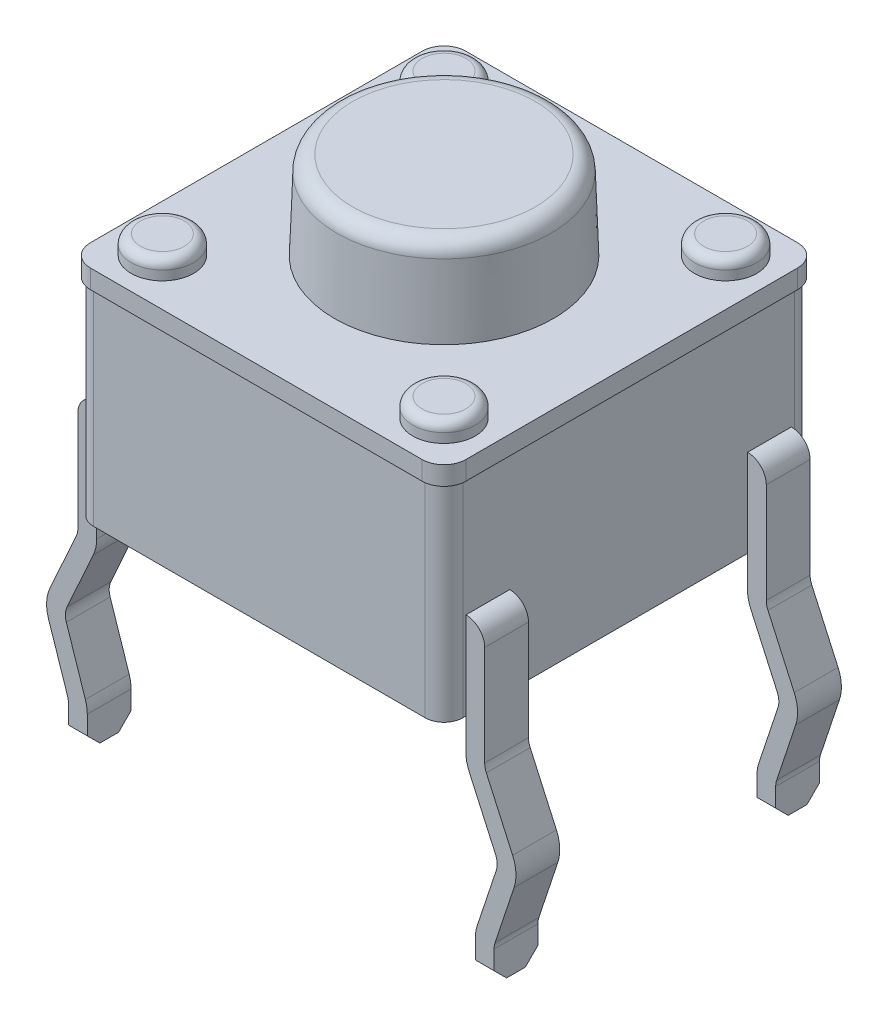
ISO-10303-21;
HEADER;
FILE_DESCRIPTION(('STEP AP214'),'2;1');
FILE_NAME('part.step','',(''),(''),'','','');
FILE_SCHEMA(('AUTOMOTIVE_DESIGN { 1 0 10303 214 1 1 1 1 }'));
ENDSEC;
DATA;
#1=APPLICATION_CONTEXT('core data for automotive mechanical design processes');
#2=APPLICATION_PROTOCOL_DEFINITION('international standard','automotive_design',2000,#1);
#3=PRODUCT_CONTEXT('',#1,'mechanical');
#4=PRODUCT('Part','Part','',(#3));
#5=PRODUCT_RELATED_PRODUCT_CATEGORY('part','',(#4));
#6=PRODUCT_DEFINITION_FORMATION('','',#4);
#7=PRODUCT_DEFINITION_CONTEXT('part definition',#1,'design');
#8=PRODUCT_DEFINITION('design','',#6,#7);
#9=PRODUCT_DEFINITION_SHAPE('','',#8);
#10=(LENGTH_UNIT() NAMED_UNIT(*) SI_UNIT(.MILLI.,.METRE.));
#11=(NAMED_UNIT(*) PLANE_ANGLE_UNIT() SI_UNIT($,.RADIAN.));
#12=(NAMED_UNIT(*) SI_UNIT($,.STERADIAN.) SOLID_ANGLE_UNIT());
#13=UNCERTAINTY_MEASURE_WITH_UNIT(LENGTH_MEASURE(1.E-05),#10,'distance_accuracy_value','');
#14=(GEOMETRIC_REPRESENTATION_CONTEXT(3) GLOBAL_UNCERTAINTY_ASSIGNED_CONTEXT((#13)) GLOBAL_UNIT_ASSIGNED_CONTEXT((#10,
#11,#12)) REPRESENTATION_CONTEXT('',''));
#15=CARTESIAN_POINT('',(0.,0.,0.));
#16=DIRECTION('',(0.,0.,1.));
#17=DIRECTION('',(1.,0.,0.));
#18=AXIS2_PLACEMENT_3D('',#15,#16,#17);
#19=CARTESIAN_POINT('',(-2.65,3.6,-2.65));
#20=DIRECTION('',(0.,1.,0.));
#21=DIRECTION('',(0.,0.,1.));
#22=AXIS2_PLACEMENT_3D('',#19,#20,#21);
#23=PLANE('',#22);
#24=CARTESIAN_POINT('',(2.25,3.6,2.25));
#25=DIRECTION('',(0.,1.,0.));
#26=DIRECTION('',(0.,0.,1.));
#27=AXIS2_PLACEMENT_3D('',#24,#25,#26);
#28=CIRCLE('',#27,0.5);
#29=CARTESIAN_POINT('',(2.25,3.6,2.75));
#30=VERTEX_POINT('',#29);
#31=EDGE_CURVE('E1921',#30,#30,#28,.T.);
#32=ORIENTED_EDGE('',*,*,#31,.F.);
#33=EDGE_LOOP('',(#32));
#34=FACE_BOUND('',#33,.T.);
#35=CARTESIAN_POINT('',(-2.25,3.6,-2.25));
#36=DIRECTION('',(0.,1.,0.));
#37=DIRECTION('',(0.,0.,1.));
#38=AXIS2_PLACEMENT_3D('',#35,#36,#37);
#39=CIRCLE('',#38,0.5);
#40=CARTESIAN_POINT('',(-2.25,3.6,-1.75));
#41=VERTEX_POINT('',#40);
#42=EDGE_CURVE('E1915',#41,#41,#39,.T.);
#43=ORIENTED_EDGE('',*,*,#42,.F.);
#44=EDGE_LOOP('',(#43));
#45=FACE_BOUND('',#44,.T.);
#46=CARTESIAN_POINT('',(-2.65,3.6,-2.65));
#47=DIRECTION('',(0.,1.,0.));
#48=DIRECTION('',(0.,0.,1.));
#49=AXIS2_PLACEMENT_3D('',#46,#47,#48);
#50=CIRCLE('',#49,0.35);
#51=CARTESIAN_POINT('',(-2.65,3.6,-3.));
#52=VERTEX_POINT('',#51);
#53=CARTESIAN_POINT('',(-3.,3.6,-2.65));
#54=VERTEX_POINT('',#53);
#55=EDGE_CURVE('E1078',#52,#54,#50,.T.);
#56=ORIENTED_EDGE('',*,*,#55,.T.);
#57=DIRECTION('',(0.,0.,1.));
#58=VECTOR('',#57,1.);
#59=CARTESIAN_POINT('',(-3.,3.6,-2.65));
#60=LINE('',#59,#58);
#61=CARTESIAN_POINT('',(-3.,3.6,2.65));
#62=VERTEX_POINT('',#61);
#63=EDGE_CURVE('E1081',#54,#62,#60,.T.);
#64=ORIENTED_EDGE('',*,*,#63,.T.);
#65=CARTESIAN_POINT('',(-2.65,3.6,2.65));
#66=DIRECTION('',(0.,1.,0.));
#67=DIRECTION('',(0.,0.,1.));
#68=AXIS2_PLACEMENT_3D('',#65,#66,#67);
#69=CIRCLE('',#68,0.35);
#70=CARTESIAN_POINT('',(-2.65,3.6,3.));
#71=VERTEX_POINT('',#70);
#72=EDGE_CURVE('E1084',#62,#71,#69,.T.);
#73=ORIENTED_EDGE('',*,*,#72,.T.);
#74=DIRECTION('',(1.,0.,0.));
#75=VECTOR('',#74,1.);
#76=CARTESIAN_POINT('',(-2.65,3.6,3.));
#77=LINE('',#76,#75);
#78=CARTESIAN_POINT('',(2.65,3.6,3.));
#79=VERTEX_POINT('',#78);
#80=EDGE_CURVE('E1086',#71,#79,#77,.T.);
#81=ORIENTED_EDGE('',*,*,#80,.T.);
#82=CARTESIAN_POINT('',(2.65,3.6,2.65));
#83=DIRECTION('',(0.,1.,0.));
#84=DIRECTION('',(0.,0.,1.));
#85=AXIS2_PLACEMENT_3D('',#82,#83,#84);
#86=CIRCLE('',#85,0.35);
#87=CARTESIAN_POINT('',(3.,3.6,2.65));
#88=VERTEX_POINT('',#87);
#89=EDGE_CURVE('E1088',#79,#88,#86,.T.);
#90=ORIENTED_EDGE('',*,*,#89,.T.);
#91=DIRECTION('',(0.,0.,-1.));
#92=VECTOR('',#91,1.);
#93=CARTESIAN_POINT('',(3.,3.6,2.65));
#94=LINE('',#93,#92);
#95=CARTESIAN_POINT('',(3.,3.6,-2.65));
#96=VERTEX_POINT('',#95);
#97=EDGE_CURVE('E1090',#88,#96,#94,.T.);
#98=ORIENTED_EDGE('',*,*,#97,.T.);
#99=CARTESIAN_POINT('',(2.65,3.6,-2.65));
#100=DIRECTION('',(0.,1.,0.));
#101=DIRECTION('',(0.,0.,1.));
#102=AXIS2_PLACEMENT_3D('',#99,#100,#101);
#103=CIRCLE('',#102,0.35);
#104=CARTESIAN_POINT('',(2.65,3.6,-3.));
#105=VERTEX_POINT('',#104);
#106=EDGE_CURVE('E1092',#96,#105,#103,.T.);
#107=ORIENTED_EDGE('',*,*,#106,.T.);
#108=DIRECTION('',(-1.,0.,0.));
#109=VECTOR('',#108,1.);
#110=CARTESIAN_POINT('',(2.65,3.6,-3.));
#111=LINE('',#110,#109);
#112=EDGE_CURVE('E1094',#105,#52,#111,.T.);
#113=ORIENTED_EDGE('',*,*,#112,.T.);
#114=EDGE_LOOP('',(#56,#64,#73,#81,#90,#98,#107,#113));
#115=FACE_BOUND('',#114,.T.);
#116=CARTESIAN_POINT('',(0.,3.6,0.));
#117=DIRECTION('',(0.,1.,0.));
#118=DIRECTION('',(0.,0.,1.));
#119=AXIS2_PLACEMENT_3D('',#116,#117,#118);
#120=CIRCLE('',#119,1.75);
#121=CARTESIAN_POINT('',(0.,3.6,1.75));
#122=VERTEX_POINT('',#121);
#123=EDGE_CURVE('E661',#122,#122,#120,.T.);
#124=ORIENTED_EDGE('',*,*,#123,.F.);
#125=EDGE_LOOP('',(#124));
#126=FACE_BOUND('',#125,.T.);
#127=CARTESIAN_POINT('',(2.25,3.6,-2.25));
#128=DIRECTION('',(0.,1.,0.));
#129=DIRECTION('',(0.,0.,-1.));
#130=AXIS2_PLACEMENT_3D('',#127,#128,#129);
#131=CIRCLE('',#130,0.5);
#132=CARTESIAN_POINT('',(2.25,3.6,-2.75));
#133=VERTEX_POINT('',#132);
#134=EDGE_CURVE('E1918',#133,#133,#131,.T.);
#135=ORIENTED_EDGE('',*,*,#134,.F.);
#136=EDGE_LOOP('',(#135));
#137=FACE_BOUND('',#136,.T.);
#138=CARTESIAN_POINT('',(-2.25,3.6,2.25));
#139=DIRECTION('',(0.,1.,0.));
#140=DIRECTION('',(0.,0.,-1.));
#141=AXIS2_PLACEMENT_3D('',#138,#139,#140);
#142=CIRCLE('',#141,0.5);
#143=CARTESIAN_POINT('',(-2.25,3.6,1.75));
#144=VERTEX_POINT('',#143);
#145=EDGE_CURVE('E1924',#144,#144,#142,.T.);
#146=ORIENTED_EDGE('',*,*,#145,.F.);
#147=EDGE_LOOP('',(#146));
#148=FACE_BOUND('',#147,.T.);
#149=ADVANCED_FACE('F31',(#34,#45,#115,#126,#137,#148),#23,.T.);
#150=CARTESIAN_POINT('',(2.95,3.3,2.65));
#151=DIRECTION('',(-1.,0.,0.));
#152=DIRECTION('',(0.,0.,1.));
#153=AXIS2_PLACEMENT_3D('',#150,#151,#152);
#154=PLANE('',#153);
#155=DIRECTION('',(0.,-1.,0.));
#156=VECTOR('',#155,1.);
#157=CARTESIAN_POINT('',(2.95,1.4,-1.9));
#158=LINE('',#157,#156);
#159=CARTESIAN_POINT('',(2.95,1.4,-1.9));
#160=VERTEX_POINT('',#159);
#161=CARTESIAN_POINT('',(2.95,0.,-1.9));
#162=VERTEX_POINT('',#161);
#163=EDGE_CURVE('E612',#160,#162,#158,.T.);
#164=ORIENTED_EDGE('',*,*,#163,.F.);
#165=DIRECTION('',(0.,0.,-1.));
#166=VECTOR('',#165,1.);
#167=CARTESIAN_POINT('',(2.95,1.4,-1.9));
#168=LINE('',#167,#166);
#169=CARTESIAN_POINT('',(2.95,1.4,-2.6));
#170=VERTEX_POINT('',#169);
#171=EDGE_CURVE('E624',#160,#170,#168,.T.);
#172=ORIENTED_EDGE('',*,*,#171,.T.);
#173=DIRECTION('',(0.,-1.,0.));
#174=VECTOR('',#173,1.);
#175=CARTESIAN_POINT('',(2.95,1.4,-2.6));
#176=LINE('',#175,#174);
#177=CARTESIAN_POINT('',(2.95,0.,-2.6));
#178=VERTEX_POINT('',#177);
#179=EDGE_CURVE('E662',#170,#178,#176,.T.);
#180=ORIENTED_EDGE('',*,*,#179,.T.);
#181=DIRECTION('',(0.,0.,-1.));
#182=VECTOR('',#181,1.);
#183=CARTESIAN_POINT('',(2.95,0.,2.65));
#184=LINE('',#183,#182);
#185=CARTESIAN_POINT('',(2.95,0.,-2.65));
#186=VERTEX_POINT('',#185);
#187=EDGE_CURVE('E1177',#178,#186,#184,.T.);
#188=ORIENTED_EDGE('',*,*,#187,.T.);
#189=DIRECTION('',(0.,-1.,0.));
#190=VECTOR('',#189,1.);
#191=CARTESIAN_POINT('',(2.95,3.3,-2.65));
#192=LINE('',#191,#190);
#193=CARTESIAN_POINT('',(2.95,3.3,-2.65));
#194=VERTEX_POINT('',#193);
#195=EDGE_CURVE('E1190',#194,#186,#192,.T.);
#196=ORIENTED_EDGE('',*,*,#195,.F.);
#197=DIRECTION('',(0.,0.,-1.));
#198=VECTOR('',#197,1.);
#199=CARTESIAN_POINT('',(2.95,3.3,2.65));
#200=LINE('',#199,#198);
#201=CARTESIAN_POINT('',(2.95,3.3,2.65));
#202=VERTEX_POINT('',#201);
#203=EDGE_CURVE('E1152',#202,#194,#200,.T.);
#204=ORIENTED_EDGE('',*,*,#203,.F.);
#205=DIRECTION('',(0.,-1.,0.));
#206=VECTOR('',#205,1.);
#207=CARTESIAN_POINT('',(2.95,3.3,2.65));
#208=LINE('',#207,#206);
#209=CARTESIAN_POINT('',(2.95,0.,2.65));
#210=VERTEX_POINT('',#209);
#211=EDGE_CURVE('E1193',#202,#210,#208,.T.);
#212=ORIENTED_EDGE('',*,*,#211,.T.);
#213=CARTESIAN_POINT('',(2.95,0.,2.6));
#214=VERTEX_POINT('',#213);
#215=EDGE_CURVE('E1178',#210,#214,#184,.T.);
#216=ORIENTED_EDGE('',*,*,#215,.T.);
#217=DIRECTION('',(0.,-1.,0.));
#218=VECTOR('',#217,1.);
#219=CARTESIAN_POINT('',(2.95,1.4,2.6));
#220=LINE('',#219,#218);
#221=CARTESIAN_POINT('',(2.95,1.4,2.6));
#222=VERTEX_POINT('',#221);
#223=EDGE_CURVE('E854',#222,#214,#220,.T.);
#224=ORIENTED_EDGE('',*,*,#223,.F.);
#225=DIRECTION('',(0.,0.,-1.));
#226=VECTOR('',#225,1.);
#227=CARTESIAN_POINT('',(2.95,1.4,2.6));
#228=LINE('',#227,#226);
#229=CARTESIAN_POINT('',(2.95,1.4,1.9));
#230=VERTEX_POINT('',#229);
#231=EDGE_CURVE('E959',#222,#230,#228,.T.);
#232=ORIENTED_EDGE('',*,*,#231,.T.);
#233=DIRECTION('',(0.,-1.,0.));
#234=VECTOR('',#233,1.);
#235=CARTESIAN_POINT('',(2.95,1.4,1.9));
#236=LINE('',#235,#234);
#237=CARTESIAN_POINT('',(2.95,0.,1.9));
#238=VERTEX_POINT('',#237);
#239=EDGE_CURVE('E887',#230,#238,#236,.T.);
#240=ORIENTED_EDGE('',*,*,#239,.T.);
#241=EDGE_CURVE('E1868',#238,#162,#184,.T.);
#242=ORIENTED_EDGE('',*,*,#241,.T.);
#243=EDGE_LOOP('',(#164,#172,#180,#188,#196,#204,#212,#216,#224,#232,#240,#242));
#244=FACE_BOUND('',#243,.T.);
#245=ADVANCED_FACE('F1316',(#244),#154,.F.);
#246=CARTESIAN_POINT('',(-2.65,3.3,-2.65));
#247=DIRECTION('',(0.,-1.,0.));
#248=DIRECTION('',(0.,0.,-1.));
#249=AXIS2_PLACEMENT_3D('',#246,#247,#248);
#250=CYLINDRICAL_SURFACE('',#249,0.3);
#251=CARTESIAN_POINT('',(-2.65,0.,-2.65));
#252=DIRECTION('',(0.,1.,0.));
#253=DIRECTION('',(0.,0.,-1.));
#254=AXIS2_PLACEMENT_3D('',#251,#252,#253);
#255=CIRCLE('',#254,0.3);
#256=CARTESIAN_POINT('',(-2.65,0.,-2.95));
#257=VERTEX_POINT('',#256);
#258=CARTESIAN_POINT('',(-2.95,0.,-2.65));
#259=VERTEX_POINT('',#258);
#260=EDGE_CURVE('E1135',#257,#259,#255,.T.);
#261=ORIENTED_EDGE('',*,*,#260,.T.);
#262=DIRECTION('',(0.,-1.,0.));
#263=VECTOR('',#262,1.);
#264=CARTESIAN_POINT('',(-2.95,3.3,-2.65));
#265=LINE('',#264,#263);
#266=CARTESIAN_POINT('',(-2.95,3.3,-2.65));
#267=VERTEX_POINT('',#266);
#268=EDGE_CURVE('E1205',#267,#259,#265,.T.);
#269=ORIENTED_EDGE('',*,*,#268,.F.);
#270=CARTESIAN_POINT('',(-2.65,3.3,-2.65));
#271=DIRECTION('',(0.,1.,0.));
#272=DIRECTION('',(0.,0.,-1.));
#273=AXIS2_PLACEMENT_3D('',#270,#271,#272);
#274=CIRCLE('',#273,0.3);
#275=CARTESIAN_POINT('',(-2.65,3.3,-2.95));
#276=VERTEX_POINT('',#275);
#277=EDGE_CURVE('E1136',#276,#267,#274,.T.);
#278=ORIENTED_EDGE('',*,*,#277,.F.);
#279=DIRECTION('',(0.,-1.,0.));
#280=VECTOR('',#279,1.);
#281=CARTESIAN_POINT('',(-2.65,3.3,-2.95));
#282=LINE('',#281,#280);
#283=EDGE_CURVE('E1161',#276,#257,#282,.T.);
#284=ORIENTED_EDGE('',*,*,#283,.T.);
#285=EDGE_LOOP('',(#261,#269,#278,#284));
#286=FACE_BOUND('',#285,.T.);
#287=ADVANCED_FACE('F1322',(#286),#250,.T.);
#288=CARTESIAN_POINT('',(-2.95,3.3,2.65));
#289=DIRECTION('',(1.,0.,0.));
#290=DIRECTION('',(0.,0.,-1.));
#291=AXIS2_PLACEMENT_3D('',#288,#289,#290);
#292=PLANE('',#291);
#293=DIRECTION('',(0.,0.,-1.));
#294=VECTOR('',#293,1.);
#295=CARTESIAN_POINT('',(-2.95,1.4,-1.9));
#296=LINE('',#295,#294);
#297=CARTESIAN_POINT('',(-2.95,1.4,-1.9));
#298=VERTEX_POINT('',#297);
#299=CARTESIAN_POINT('',(-2.95,1.4,-2.6));
#300=VERTEX_POINT('',#299);
#301=EDGE_CURVE('E768',#298,#300,#296,.T.);
#302=ORIENTED_EDGE('',*,*,#301,.F.);
#303=DIRECTION('',(0.,1.,0.));
#304=VECTOR('',#303,1.);
#305=CARTESIAN_POINT('',(-2.95,1.4,-1.9));
#306=LINE('',#305,#304);
#307=CARTESIAN_POINT('',(-2.95,0.,-1.9));
#308=VERTEX_POINT('',#307);
#309=EDGE_CURVE('E764',#308,#298,#306,.T.);
#310=ORIENTED_EDGE('',*,*,#309,.F.);
#311=DIRECTION('',(0.,0.,1.));
#312=VECTOR('',#311,1.);
#313=CARTESIAN_POINT('',(-2.95,0.,2.65));
#314=LINE('',#313,#312);
#315=CARTESIAN_POINT('',(-2.95,0.,1.9));
#316=VERTEX_POINT('',#315);
#317=EDGE_CURVE('E1170',#308,#316,#314,.T.);
#318=ORIENTED_EDGE('',*,*,#317,.T.);
#319=DIRECTION('',(0.,1.,0.));
#320=VECTOR('',#319,1.);
#321=CARTESIAN_POINT('',(-2.95,1.4,1.9));
#322=LINE('',#321,#320);
#323=CARTESIAN_POINT('',(-2.95,1.4,1.9));
#324=VERTEX_POINT('',#323);
#325=EDGE_CURVE('E1027',#316,#324,#322,.T.);
#326=ORIENTED_EDGE('',*,*,#325,.T.);
#327=DIRECTION('',(0.,0.,-1.));
#328=VECTOR('',#327,1.);
#329=CARTESIAN_POINT('',(-2.95,1.4,2.6));
#330=LINE('',#329,#328);
#331=CARTESIAN_POINT('',(-2.95,1.4,2.6));
#332=VERTEX_POINT('',#331);
#333=EDGE_CURVE('E997',#332,#324,#330,.T.);
#334=ORIENTED_EDGE('',*,*,#333,.F.);
#335=DIRECTION('',(0.,1.,0.));
#336=VECTOR('',#335,1.);
#337=CARTESIAN_POINT('',(-2.95,1.4,2.6));
#338=LINE('',#337,#336);
#339=CARTESIAN_POINT('',(-2.95,0.,2.6));
#340=VERTEX_POINT('',#339);
#341=EDGE_CURVE('E993',#340,#332,#338,.T.);
#342=ORIENTED_EDGE('',*,*,#341,.F.);
#343=CARTESIAN_POINT('',(-2.95,0.,2.65));
#344=VERTEX_POINT('',#343);
#345=EDGE_CURVE('E1164',#340,#344,#314,.T.);
#346=ORIENTED_EDGE('',*,*,#345,.T.);
#347=DIRECTION('',(0.,-1.,0.));
#348=VECTOR('',#347,1.);
#349=CARTESIAN_POINT('',(-2.95,3.3,2.65));
#350=LINE('',#349,#348);
#351=CARTESIAN_POINT('',(-2.95,3.3,2.65));
#352=VERTEX_POINT('',#351);
#353=EDGE_CURVE('E1202',#352,#344,#350,.T.);
#354=ORIENTED_EDGE('',*,*,#353,.F.);
#355=DIRECTION('',(0.,0.,1.));
#356=VECTOR('',#355,1.);
#357=CARTESIAN_POINT('',(-2.95,3.3,2.65));
#358=LINE('',#357,#356);
#359=EDGE_CURVE('E1139',#267,#352,#358,.T.);
#360=ORIENTED_EDGE('',*,*,#359,.F.);
#361=ORIENTED_EDGE('',*,*,#268,.T.);
#362=CARTESIAN_POINT('',(-2.95,0.,-2.6));
#363=VERTEX_POINT('',#362);
#364=EDGE_CURVE('E1165',#259,#363,#314,.T.);
#365=ORIENTED_EDGE('',*,*,#364,.T.);
#366=DIRECTION('',(0.,1.,0.));
#367=VECTOR('',#366,1.);
#368=CARTESIAN_POINT('',(-2.95,1.4,-2.6));
#369=LINE('',#368,#367);
#370=EDGE_CURVE('E798',#363,#300,#369,.T.);
#371=ORIENTED_EDGE('',*,*,#370,.T.);
#372=EDGE_LOOP('',(#302,#310,#318,#326,#334,#342,#346,#354,#360,#361,#365,#371));
#373=FACE_BOUND('',#372,.T.);
#374=ADVANCED_FACE('F1390',(#373),#292,.F.);
#375=CARTESIAN_POINT('',(-2.65,3.3,2.65));
#376=DIRECTION('',(0.,-1.,0.));
#377=DIRECTION('',(0.,0.,-1.));
#378=AXIS2_PLACEMENT_3D('',#375,#376,#377);
#379=CYLINDRICAL_SURFACE('',#378,0.3);
#380=CARTESIAN_POINT('',(-2.65,0.,2.65));
#381=DIRECTION('',(0.,1.,0.));
#382=DIRECTION('',(0.,0.,-1.));
#383=AXIS2_PLACEMENT_3D('',#380,#381,#382);
#384=CIRCLE('',#383,0.3);
#385=CARTESIAN_POINT('',(-2.65,0.,2.95));
#386=VERTEX_POINT('',#385);
#387=EDGE_CURVE('E1168',#344,#386,#384,.T.);
#388=ORIENTED_EDGE('',*,*,#387,.T.);
#389=DIRECTION('',(0.,-1.,0.));
#390=VECTOR('',#389,1.);
#391=CARTESIAN_POINT('',(-2.65,3.3,2.95));
#392=LINE('',#391,#390);
#393=CARTESIAN_POINT('',(-2.65,3.3,2.95));
#394=VERTEX_POINT('',#393);
#395=EDGE_CURVE('E1199',#394,#386,#392,.T.);
#396=ORIENTED_EDGE('',*,*,#395,.F.);
#397=CARTESIAN_POINT('',(-2.65,3.3,2.65));
#398=DIRECTION('',(0.,1.,0.));
#399=DIRECTION('',(0.,0.,-1.));
#400=AXIS2_PLACEMENT_3D('',#397,#398,#399);
#401=CIRCLE('',#400,0.3);
#402=EDGE_CURVE('E1143',#352,#394,#401,.T.);
#403=ORIENTED_EDGE('',*,*,#402,.F.);
#404=ORIENTED_EDGE('',*,*,#353,.T.);
#405=EDGE_LOOP('',(#388,#396,#403,#404));
#406=FACE_BOUND('',#405,.T.);
#407=ADVANCED_FACE('F1386',(#406),#379,.T.);
#408=CARTESIAN_POINT('',(-2.65,3.3,2.95));
#409=DIRECTION('',(0.,0.,-1.));
#410=DIRECTION('',(-1.,0.,0.));
#411=AXIS2_PLACEMENT_3D('',#408,#409,#410);
#412=PLANE('',#411);
#413=DIRECTION('',(1.,0.,0.));
#414=VECTOR('',#413,1.);
#415=CARTESIAN_POINT('',(-2.65,0.,2.95));
#416=LINE('',#415,#414);
#417=CARTESIAN_POINT('',(2.65,0.,2.95));
#418=VERTEX_POINT('',#417);
#419=EDGE_CURVE('E1173',#386,#418,#416,.T.);
#420=ORIENTED_EDGE('',*,*,#419,.T.);
#421=DIRECTION('',(0.,-1.,0.));
#422=VECTOR('',#421,1.);
#423=CARTESIAN_POINT('',(2.65,3.3,2.95));
#424=LINE('',#423,#422);
#425=CARTESIAN_POINT('',(2.65,3.3,2.95));
#426=VERTEX_POINT('',#425);
#427=EDGE_CURVE('E1196',#426,#418,#424,.T.);
#428=ORIENTED_EDGE('',*,*,#427,.F.);
#429=DIRECTION('',(1.,0.,0.));
#430=VECTOR('',#429,1.);
#431=CARTESIAN_POINT('',(-2.65,3.3,2.95));
#432=LINE('',#431,#430);
#433=EDGE_CURVE('E1146',#394,#426,#432,.T.);
#434=ORIENTED_EDGE('',*,*,#433,.F.);
#435=ORIENTED_EDGE('',*,*,#395,.T.);
#436=EDGE_LOOP('',(#420,#428,#434,#435));
#437=FACE_BOUND('',#436,.T.);
#438=ADVANCED_FACE('F1382',(#437),#412,.F.);
#439=CARTESIAN_POINT('',(2.65,3.3,2.65));
#440=DIRECTION('',(0.,-1.,0.));
#441=DIRECTION('',(0.,0.,-1.));
#442=AXIS2_PLACEMENT_3D('',#439,#440,#441);
#443=CYLINDRICAL_SURFACE('',#442,0.3);
#444=CARTESIAN_POINT('',(2.65,0.,2.65));
#445=DIRECTION('',(0.,1.,0.));
#446=DIRECTION('',(0.,0.,1.));
#447=AXIS2_PLACEMENT_3D('',#444,#445,#446);
#448=CIRCLE('',#447,0.3);
#449=EDGE_CURVE('E1175',#418,#210,#448,.T.);
#450=ORIENTED_EDGE('',*,*,#449,.T.);
#451=ORIENTED_EDGE('',*,*,#211,.F.);
#452=CARTESIAN_POINT('',(2.65,3.3,2.65));
#453=DIRECTION('',(0.,1.,0.));
#454=DIRECTION('',(0.,0.,1.));
#455=AXIS2_PLACEMENT_3D('',#452,#453,#454);
#456=CIRCLE('',#455,0.3);
#457=EDGE_CURVE('E1149',#426,#202,#456,.T.);
#458=ORIENTED_EDGE('',*,*,#457,.F.);
#459=ORIENTED_EDGE('',*,*,#427,.T.);
#460=EDGE_LOOP('',(#450,#451,#458,#459));
#461=FACE_BOUND('',#460,.T.);
#462=ADVANCED_FACE('F1377',(#461),#443,.T.);
#463=CARTESIAN_POINT('',(2.65,3.3,-2.65));
#464=DIRECTION('',(0.,-1.,0.));
#465=DIRECTION('',(0.,0.,-1.));
#466=AXIS2_PLACEMENT_3D('',#463,#464,#465);
#467=CYLINDRICAL_SURFACE('',#466,0.3);
#468=CARTESIAN_POINT('',(2.65,0.,-2.65));
#469=DIRECTION('',(0.,1.,0.));
#470=DIRECTION('',(0.,0.,-1.));
#471=AXIS2_PLACEMENT_3D('',#468,#469,#470);
#472=CIRCLE('',#471,0.3);
#473=CARTESIAN_POINT('',(2.65,0.,-2.95));
#474=VERTEX_POINT('',#473);
#475=EDGE_CURVE('E1181',#186,#474,#472,.T.);
#476=ORIENTED_EDGE('',*,*,#475,.T.);
#477=DIRECTION('',(0.,-1.,0.));
#478=VECTOR('',#477,1.);
#479=CARTESIAN_POINT('',(2.65,3.3,-2.95));
#480=LINE('',#479,#478);
#481=CARTESIAN_POINT('',(2.65,3.3,-2.95));
#482=VERTEX_POINT('',#481);
#483=EDGE_CURVE('E1187',#482,#474,#480,.T.);
#484=ORIENTED_EDGE('',*,*,#483,.F.);
#485=CARTESIAN_POINT('',(2.65,3.3,-2.65));
#486=DIRECTION('',(0.,1.,0.));
#487=DIRECTION('',(0.,0.,-1.));
#488=AXIS2_PLACEMENT_3D('',#485,#486,#487);
#489=CIRCLE('',#488,0.3);
#490=EDGE_CURVE('E1155',#194,#482,#489,.T.);
#491=ORIENTED_EDGE('',*,*,#490,.F.);
#492=ORIENTED_EDGE('',*,*,#195,.T.);
#493=EDGE_LOOP('',(#476,#484,#491,#492));
#494=FACE_BOUND('',#493,.T.);
#495=ADVANCED_FACE('F1374',(#494),#467,.T.);
#496=CARTESIAN_POINT('',(-2.65,3.3,-2.95));
#497=DIRECTION('',(0.,0.,1.));
#498=DIRECTION('',(1.,0.,0.));
#499=AXIS2_PLACEMENT_3D('',#496,#497,#498);
#500=PLANE('',#499);
#501=DIRECTION('',(-1.,0.,0.));
#502=VECTOR('',#501,1.);
#503=CARTESIAN_POINT('',(-2.65,0.,-2.95));
#504=LINE('',#503,#502);
#505=EDGE_CURVE('E1140',#474,#257,#504,.T.);
#506=ORIENTED_EDGE('',*,*,#505,.T.);
#507=ORIENTED_EDGE('',*,*,#283,.F.);
#508=DIRECTION('',(-1.,0.,0.));
#509=VECTOR('',#508,1.);
#510=CARTESIAN_POINT('',(-2.65,3.3,-2.95));
#511=LINE('',#510,#509);
#512=EDGE_CURVE('E1158',#482,#276,#511,.T.);
#513=ORIENTED_EDGE('',*,*,#512,.F.);
#514=ORIENTED_EDGE('',*,*,#483,.T.);
#515=EDGE_LOOP('',(#506,#507,#513,#514));
#516=FACE_BOUND('',#515,.T.);
#517=ADVANCED_FACE('F1370',(#516),#500,.F.);
#518=CARTESIAN_POINT('',(-2.65,0.,-2.65));
#519=DIRECTION('',(0.,-1.,0.));
#520=DIRECTION('',(0.,0.,-1.));
#521=AXIS2_PLACEMENT_3D('',#518,#519,#520);
#522=PLANE('',#521);
#523=ORIENTED_EDGE('',*,*,#260,.F.);
#524=ORIENTED_EDGE('',*,*,#505,.F.);
#525=ORIENTED_EDGE('',*,*,#475,.F.);
#526=ORIENTED_EDGE('',*,*,#187,.F.);
#527=EDGE_CURVE('E1863',#162,#178,#184,.T.);
#528=ORIENTED_EDGE('',*,*,#527,.F.);
#529=ORIENTED_EDGE('',*,*,#241,.F.);
#530=EDGE_CURVE('E1182',#214,#238,#184,.T.);
#531=ORIENTED_EDGE('',*,*,#530,.F.);
#532=ORIENTED_EDGE('',*,*,#215,.F.);
#533=ORIENTED_EDGE('',*,*,#449,.F.);
#534=ORIENTED_EDGE('',*,*,#419,.F.);
#535=ORIENTED_EDGE('',*,*,#387,.F.);
#536=ORIENTED_EDGE('',*,*,#345,.F.);
#537=EDGE_CURVE('E1171',#316,#340,#314,.T.);
#538=ORIENTED_EDGE('',*,*,#537,.F.);
#539=ORIENTED_EDGE('',*,*,#317,.F.);
#540=EDGE_CURVE('E1169',#363,#308,#314,.T.);
#541=ORIENTED_EDGE('',*,*,#540,.F.);
#542=ORIENTED_EDGE('',*,*,#364,.F.);
#543=EDGE_LOOP('',(#523,#524,#525,#526,#528,#529,#531,#532,#533,#534,#535,#536,#538,#539,#541,#542));
#544=FACE_BOUND('',#543,.T.);
#545=ADVANCED_FACE('F1335',(#544),#522,.T.);
#546=CARTESIAN_POINT('',(-2.65,3.3,-2.65));
#547=DIRECTION('',(0.,1.,0.));
#548=DIRECTION('',(0.,0.,1.));
#549=AXIS2_PLACEMENT_3D('',#546,#547,#548);
#550=PLANE('',#549);
#551=CARTESIAN_POINT('',(-2.65,3.3,-2.65));
#552=DIRECTION('',(0.,1.,0.));
#553=DIRECTION('',(0.,0.,1.));
#554=AXIS2_PLACEMENT_3D('',#551,#552,#553);
#555=CIRCLE('',#554,0.35);
#556=CARTESIAN_POINT('',(-2.65,3.3,-3.));
#557=VERTEX_POINT('',#556);
#558=CARTESIAN_POINT('',(-3.,3.3,-2.65));
#559=VERTEX_POINT('',#558);
#560=EDGE_CURVE('E1077',#557,#559,#555,.T.);
#561=ORIENTED_EDGE('',*,*,#560,.F.);
#562=DIRECTION('',(-1.,0.,0.));
#563=VECTOR('',#562,1.);
#564=CARTESIAN_POINT('',(2.65,3.3,-3.));
#565=LINE('',#564,#563);
#566=CARTESIAN_POINT('',(2.65,3.3,-3.));
#567=VERTEX_POINT('',#566);
#568=EDGE_CURVE('E1082',#567,#557,#565,.T.);
#569=ORIENTED_EDGE('',*,*,#568,.F.);
#570=CARTESIAN_POINT('',(2.65,3.3,-2.65));
#571=DIRECTION('',(0.,1.,0.));
#572=DIRECTION('',(0.,0.,1.));
#573=AXIS2_PLACEMENT_3D('',#570,#571,#572);
#574=CIRCLE('',#573,0.35);
#575=CARTESIAN_POINT('',(3.,3.3,-2.65));
#576=VERTEX_POINT('',#575);
#577=EDGE_CURVE('E1109',#576,#567,#574,.T.);
#578=ORIENTED_EDGE('',*,*,#577,.F.);
#579=DIRECTION('',(0.,0.,-1.));
#580=VECTOR('',#579,1.);
#581=CARTESIAN_POINT('',(3.,3.3,2.65));
#582=LINE('',#581,#580);
#583=CARTESIAN_POINT('',(3.,3.3,2.65));
#584=VERTEX_POINT('',#583);
#585=EDGE_CURVE('E1107',#584,#576,#582,.T.);
#586=ORIENTED_EDGE('',*,*,#585,.F.);
#587=CARTESIAN_POINT('',(2.65,3.3,2.65));
#588=DIRECTION('',(0.,1.,0.));
#589=DIRECTION('',(0.,0.,1.));
#590=AXIS2_PLACEMENT_3D('',#587,#588,#589);
#591=CIRCLE('',#590,0.35);
#592=CARTESIAN_POINT('',(2.65,3.3,3.));
#593=VERTEX_POINT('',#592);
#594=EDGE_CURVE('E1105',#593,#584,#591,.T.);
#595=ORIENTED_EDGE('',*,*,#594,.F.);
#596=DIRECTION('',(1.,0.,0.));
#597=VECTOR('',#596,1.);
#598=CARTESIAN_POINT('',(-2.65,3.3,3.));
#599=LINE('',#598,#597);
#600=CARTESIAN_POINT('',(-2.65,3.3,3.));
#601=VERTEX_POINT('',#600);
#602=EDGE_CURVE('E1103',#601,#593,#599,.T.);
#603=ORIENTED_EDGE('',*,*,#602,.F.);
#604=CARTESIAN_POINT('',(-2.65,3.3,2.65));
#605=DIRECTION('',(0.,1.,0.));
#606=DIRECTION('',(0.,0.,1.));
#607=AXIS2_PLACEMENT_3D('',#604,#605,#606);
#608=CIRCLE('',#607,0.35);
#609=CARTESIAN_POINT('',(-3.,3.3,2.65));
#610=VERTEX_POINT('',#609);
#611=EDGE_CURVE('E1101',#610,#601,#608,.T.);
#612=ORIENTED_EDGE('',*,*,#611,.F.);
#613=DIRECTION('',(0.,0.,1.));
#614=VECTOR('',#613,1.);
#615=CARTESIAN_POINT('',(-3.,3.3,-2.65));
#616=LINE('',#615,#614);
#617=EDGE_CURVE('E1099',#559,#610,#616,.T.);
#618=ORIENTED_EDGE('',*,*,#617,.F.);
#619=EDGE_LOOP('',(#561,#569,#578,#586,#595,#603,#612,#618));
#620=FACE_BOUND('',#619,.T.);
#621=ORIENTED_EDGE('',*,*,#512,.T.);
#622=ORIENTED_EDGE('',*,*,#277,.T.);
#623=ORIENTED_EDGE('',*,*,#359,.T.);
#624=ORIENTED_EDGE('',*,*,#402,.T.);
#625=ORIENTED_EDGE('',*,*,#433,.T.);
#626=ORIENTED_EDGE('',*,*,#457,.T.);
#627=ORIENTED_EDGE('',*,*,#203,.T.);
#628=ORIENTED_EDGE('',*,*,#490,.T.);
#629=EDGE_LOOP('',(#621,#622,#623,#624,#625,#626,#627,#628));
#630=FACE_BOUND('',#629,.T.);
#631=ADVANCED_FACE('F1331',(#620,#630),#550,.F.);
#632=CARTESIAN_POINT('',(-2.65,3.6,-2.65));
#633=DIRECTION('',(0.,-1.,0.));
#634=DIRECTION('',(0.,0.,-1.));
#635=AXIS2_PLACEMENT_3D('',#632,#633,#634);
#636=CYLINDRICAL_SURFACE('',#635,0.35);
#637=ORIENTED_EDGE('',*,*,#560,.T.);
#638=DIRECTION('',(0.,-1.,0.));
#639=VECTOR('',#638,1.);
#640=CARTESIAN_POINT('',(-3.,3.6,-2.65));
#641=LINE('',#640,#639);
#642=EDGE_CURVE('E1132',#54,#559,#641,.T.);
#643=ORIENTED_EDGE('',*,*,#642,.F.);
#644=ORIENTED_EDGE('',*,*,#55,.F.);
#645=DIRECTION('',(0.,-1.,0.));
#646=VECTOR('',#645,1.);
#647=CARTESIAN_POINT('',(-2.65,3.6,-3.));
#648=LINE('',#647,#646);
#649=EDGE_CURVE('E1096',#52,#557,#648,.T.);
#650=ORIENTED_EDGE('',*,*,#649,.T.);
#651=EDGE_LOOP('',(#637,#643,#644,#650));
#652=FACE_BOUND('',#651,.T.);
#653=ADVANCED_FACE('F1334',(#652),#636,.T.);
#654=CARTESIAN_POINT('',(-3.,3.6,-2.65));
#655=DIRECTION('',(1.,0.,0.));
#656=DIRECTION('',(0.,0.,-1.));
#657=AXIS2_PLACEMENT_3D('',#654,#655,#656);
#658=PLANE('',#657);
#659=ORIENTED_EDGE('',*,*,#617,.T.);
#660=DIRECTION('',(0.,-1.,0.));
#661=VECTOR('',#660,1.);
#662=CARTESIAN_POINT('',(-3.,3.6,2.65));
#663=LINE('',#662,#661);
#664=EDGE_CURVE('E1129',#62,#610,#663,.T.);
#665=ORIENTED_EDGE('',*,*,#664,.F.);
#666=ORIENTED_EDGE('',*,*,#63,.F.);
#667=ORIENTED_EDGE('',*,*,#642,.T.);
#668=EDGE_LOOP('',(#659,#665,#666,#667));
#669=FACE_BOUND('',#668,.T.);
#670=ADVANCED_FACE('F1360',(#669),#658,.F.);
#671=CARTESIAN_POINT('',(-2.65,3.6,2.65));
#672=DIRECTION('',(0.,-1.,0.));
#673=DIRECTION('',(0.,0.,-1.));
#674=AXIS2_PLACEMENT_3D('',#671,#672,#673);
#675=CYLINDRICAL_SURFACE('',#674,0.35);
#676=ORIENTED_EDGE('',*,*,#611,.T.);
#677=DIRECTION('',(0.,-1.,0.));
#678=VECTOR('',#677,1.);
#679=CARTESIAN_POINT('',(-2.65,3.6,3.));
#680=LINE('',#679,#678);
#681=EDGE_CURVE('E1126',#71,#601,#680,.T.);
#682=ORIENTED_EDGE('',*,*,#681,.F.);
#683=ORIENTED_EDGE('',*,*,#72,.F.);
#684=ORIENTED_EDGE('',*,*,#664,.T.);
#685=EDGE_LOOP('',(#676,#682,#683,#684));
#686=FACE_BOUND('',#685,.T.);
#687=ADVANCED_FACE('F1356',(#686),#675,.T.);
#688=CARTESIAN_POINT('',(-2.65,3.6,3.));
#689=DIRECTION('',(0.,0.,-1.));
#690=DIRECTION('',(-1.,0.,0.));
#691=AXIS2_PLACEMENT_3D('',#688,#689,#690);
#692=PLANE('',#691);
#693=ORIENTED_EDGE('',*,*,#602,.T.);
#694=DIRECTION('',(0.,-1.,0.));
#695=VECTOR('',#694,1.);
#696=CARTESIAN_POINT('',(2.65,3.6,3.));
#697=LINE('',#696,#695);
#698=EDGE_CURVE('E1123',#79,#593,#697,.T.);
#699=ORIENTED_EDGE('',*,*,#698,.F.);
#700=ORIENTED_EDGE('',*,*,#80,.F.);
#701=ORIENTED_EDGE('',*,*,#681,.T.);
#702=EDGE_LOOP('',(#693,#699,#700,#701));
#703=FACE_BOUND('',#702,.T.);
#704=ADVANCED_FACE('F1352',(#703),#692,.F.);
#705=CARTESIAN_POINT('',(2.65,3.6,2.65));
#706=DIRECTION('',(0.,-1.,0.));
#707=DIRECTION('',(0.,0.,-1.));
#708=AXIS2_PLACEMENT_3D('',#705,#706,#707);
#709=CYLINDRICAL_SURFACE('',#708,0.35);
#710=ORIENTED_EDGE('',*,*,#594,.T.);
#711=DIRECTION('',(0.,-1.,0.));
#712=VECTOR('',#711,1.);
#713=CARTESIAN_POINT('',(3.,3.6,2.65));
#714=LINE('',#713,#712);
#715=EDGE_CURVE('E1120',#88,#584,#714,.T.);
#716=ORIENTED_EDGE('',*,*,#715,.F.);
#717=ORIENTED_EDGE('',*,*,#89,.F.);
#718=ORIENTED_EDGE('',*,*,#698,.T.);
#719=EDGE_LOOP('',(#710,#716,#717,#718));
#720=FACE_BOUND('',#719,.T.);
#721=ADVANCED_FACE('F1348',(#720),#709,.T.);
#722=CARTESIAN_POINT('',(3.,3.6,2.65));
#723=DIRECTION('',(-1.,0.,0.));
#724=DIRECTION('',(0.,0.,1.));
#725=AXIS2_PLACEMENT_3D('',#722,#723,#724);
#726=PLANE('',#725);
#727=ORIENTED_EDGE('',*,*,#585,.T.);
#728=DIRECTION('',(0.,-1.,0.));
#729=VECTOR('',#728,1.);
#730=CARTESIAN_POINT('',(3.,3.6,-2.65));
#731=LINE('',#730,#729);
#732=EDGE_CURVE('E1117',#96,#576,#731,.T.);
#733=ORIENTED_EDGE('',*,*,#732,.F.);
#734=ORIENTED_EDGE('',*,*,#97,.F.);
#735=ORIENTED_EDGE('',*,*,#715,.T.);
#736=EDGE_LOOP('',(#727,#733,#734,#735));
#737=FACE_BOUND('',#736,.T.);
#738=ADVANCED_FACE('F1344',(#737),#726,.F.);
#739=CARTESIAN_POINT('',(2.65,3.6,-2.65));
#740=DIRECTION('',(0.,-1.,0.));
#741=DIRECTION('',(0.,0.,-1.));
#742=AXIS2_PLACEMENT_3D('',#739,#740,#741);
#743=CYLINDRICAL_SURFACE('',#742,0.35);
#744=ORIENTED_EDGE('',*,*,#577,.T.);
#745=DIRECTION('',(0.,-1.,0.));
#746=VECTOR('',#745,1.);
#747=CARTESIAN_POINT('',(2.65,3.6,-3.));
#748=LINE('',#747,#746);
#749=EDGE_CURVE('E1114',#105,#567,#748,.T.);
#750=ORIENTED_EDGE('',*,*,#749,.F.);
#751=ORIENTED_EDGE('',*,*,#106,.F.);
#752=ORIENTED_EDGE('',*,*,#732,.T.);
#753=EDGE_LOOP('',(#744,#750,#751,#752));
#754=FACE_BOUND('',#753,.T.);
#755=ADVANCED_FACE('F1340',(#754),#743,.T.);
#756=CARTESIAN_POINT('',(2.65,3.6,-3.));
#757=DIRECTION('',(0.,0.,1.));
#758=DIRECTION('',(1.,0.,0.));
#759=AXIS2_PLACEMENT_3D('',#756,#757,#758);
#760=PLANE('',#759);
#761=ORIENTED_EDGE('',*,*,#568,.T.);
#762=ORIENTED_EDGE('',*,*,#649,.F.);
#763=ORIENTED_EDGE('',*,*,#112,.F.);
#764=ORIENTED_EDGE('',*,*,#749,.T.);
#765=EDGE_LOOP('',(#761,#762,#763,#764));
#766=FACE_BOUND('',#765,.T.);
#767=ADVANCED_FACE('F1337',(#766),#760,.F.);
#768=CARTESIAN_POINT('',(-2.95,1.1,2.6));
#769=DIRECTION('',(0.,0.,-1.));
#770=DIRECTION('',(-1.,0.,0.));
#771=AXIS2_PLACEMENT_3D('',#768,#769,#770);
#772=CYLINDRICAL_SURFACE('',#771,0.3);
#773=CARTESIAN_POINT('',(-2.95,1.1,1.9));
#774=DIRECTION('',(0.,0.,1.));
#775=DIRECTION('',(1.,0.,0.));
#776=AXIS2_PLACEMENT_3D('',#773,#774,#775);
#777=CIRCLE('',#776,0.3);
#778=CARTESIAN_POINT('',(-3.25,1.1,1.9));
#779=VERTEX_POINT('',#778);
#780=EDGE_CURVE('E961',#324,#779,#777,.T.);
#781=ORIENTED_EDGE('',*,*,#780,.T.);
#782=DIRECTION('',(0.,0.,-1.));
#783=VECTOR('',#782,1.);
#784=CARTESIAN_POINT('',(-3.25,1.1,2.6));
#785=LINE('',#784,#783);
#786=CARTESIAN_POINT('',(-3.25,1.1,2.6));
#787=VERTEX_POINT('',#786);
#788=EDGE_CURVE('E1074',#787,#779,#785,.T.);
#789=ORIENTED_EDGE('',*,*,#788,.F.);
#790=CARTESIAN_POINT('',(-2.95,1.1,2.6));
#791=DIRECTION('',(0.,0.,1.));
#792=DIRECTION('',(1.,0.,0.));
#793=AXIS2_PLACEMENT_3D('',#790,#791,#792);
#794=CIRCLE('',#793,0.3);
#795=EDGE_CURVE('E962',#332,#787,#794,.T.);
#796=ORIENTED_EDGE('',*,*,#795,.F.);
#797=ORIENTED_EDGE('',*,*,#333,.T.);
#798=EDGE_LOOP('',(#781,#789,#796,#797));
#799=FACE_BOUND('',#798,.T.);
#800=ADVANCED_FACE('F1329',(#799),#772,.T.);
#801=CARTESIAN_POINT('',(-3.25,1.1,2.6));
#802=DIRECTION('',(1.,0.,0.));
#803=DIRECTION('',(0.,0.,-1.));
#804=AXIS2_PLACEMENT_3D('',#801,#802,#803);
#805=PLANE('',#804);
#806=DIRECTION('',(0.,-1.,0.));
#807=VECTOR('',#806,1.);
#808=CARTESIAN_POINT('',(-3.25,1.1,1.9));
#809=LINE('',#808,#807);
#810=CARTESIAN_POINT('',(-3.25,-0.5,1.9));
#811=VERTEX_POINT('',#810);
#812=EDGE_CURVE('E1000',#779,#811,#809,.T.);
#813=ORIENTED_EDGE('',*,*,#812,.T.);
#814=DIRECTION('',(0.,0.,-1.));
#815=VECTOR('',#814,1.);
#816=CARTESIAN_POINT('',(-3.25,-0.5,2.6));
#817=LINE('',#816,#815);
#818=CARTESIAN_POINT('',(-3.25,-0.5,2.6));
#819=VERTEX_POINT('',#818);
#820=EDGE_CURVE('E1071',#819,#811,#817,.T.);
#821=ORIENTED_EDGE('',*,*,#820,.F.);
#822=DIRECTION('',(0.,-1.,0.));
#823=VECTOR('',#822,1.);
#824=CARTESIAN_POINT('',(-3.25,1.1,2.6));
#825=LINE('',#824,#823);
#826=EDGE_CURVE('E965',#787,#819,#825,.T.);
#827=ORIENTED_EDGE('',*,*,#826,.F.);
#828=ORIENTED_EDGE('',*,*,#788,.T.);
#829=EDGE_LOOP('',(#813,#821,#827,#828));
#830=FACE_BOUND('',#829,.T.);
#831=ADVANCED_FACE('F1739',(#830),#805,.F.);
#832=CARTESIAN_POINT('',(-3.55,-0.5,2.6));
#833=DIRECTION('',(0.,0.,-1.));
#834=DIRECTION('',(-1.,0.,0.));
#835=AXIS2_PLACEMENT_3D('',#832,#833,#834);
#836=CYLINDRICAL_SURFACE('',#835,0.3);
#837=CARTESIAN_POINT('',(-3.55,-0.5,1.9));
#838=DIRECTION('',(0.,0.,-1.));
#839=DIRECTION('',(-1.,0.,0.));
#840=AXIS2_PLACEMENT_3D('',#837,#838,#839);
#841=CIRCLE('',#840,0.3);
#842=CARTESIAN_POINT('',(-3.27663593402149,-0.623580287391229,1.9));
#843=VERTEX_POINT('',#842);
#844=EDGE_CURVE('E1002',#811,#843,#841,.T.);
#845=ORIENTED_EDGE('',*,*,#844,.T.);
#846=DIRECTION('',(0.,0.,-1.));
#847=VECTOR('',#846,1.);
#848=CARTESIAN_POINT('',(-3.27663593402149,-0.623580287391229,2.6));
#849=LINE('',#848,#847);
#850=CARTESIAN_POINT('',(-3.27663593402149,-0.623580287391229,2.6));
#851=VERTEX_POINT('',#850);
#852=EDGE_CURVE('E1068',#851,#843,#849,.T.);
#853=ORIENTED_EDGE('',*,*,#852,.F.);
#854=CARTESIAN_POINT('',(-3.55,-0.5,2.6));
#855=DIRECTION('',(0.,0.,-1.));
#856=DIRECTION('',(-1.,0.,0.));
#857=AXIS2_PLACEMENT_3D('',#854,#855,#856);
#858=CIRCLE('',#857,0.3);
#859=EDGE_CURVE('E968',#819,#851,#858,.T.);
#860=ORIENTED_EDGE('',*,*,#859,.F.);
#861=ORIENTED_EDGE('',*,*,#820,.T.);
#862=EDGE_LOOP('',(#845,#853,#860,#861));
#863=FACE_BOUND('',#862,.T.);
#864=ADVANCED_FACE('F1736',(#863),#836,.F.);
#865=CARTESIAN_POINT('',(-3.27663593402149,-0.623580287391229,2.6));
#866=DIRECTION('',(0.911213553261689,-0.411934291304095,0.));
#867=DIRECTION('',(0.411934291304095,0.911213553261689,0.));
#868=AXIS2_PLACEMENT_3D('',#865,#866,#867);
#869=PLANE('',#868);
#870=DIRECTION('',(-0.411934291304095,-0.911213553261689,0.));
#871=VECTOR('',#870,1.);
#872=CARTESIAN_POINT('',(-3.27663593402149,-0.623580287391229,1.9));
#873=LINE('',#872,#871);
#874=CARTESIAN_POINT('',(-3.69672813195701,-1.55283942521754,1.9));
#875=VERTEX_POINT('',#874);
#876=EDGE_CURVE('E1004',#843,#875,#873,.T.);
#877=ORIENTED_EDGE('',*,*,#876,.T.);
#878=DIRECTION('',(0.,0.,-1.));
#879=VECTOR('',#878,1.);
#880=CARTESIAN_POINT('',(-3.69672813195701,-1.55283942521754,2.6));
#881=LINE('',#880,#879);
#882=CARTESIAN_POINT('',(-3.69672813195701,-1.55283942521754,2.6));
#883=VERTEX_POINT('',#882);
#884=EDGE_CURVE('E1065',#883,#875,#881,.T.);
#885=ORIENTED_EDGE('',*,*,#884,.F.);
#886=DIRECTION('',(-0.411934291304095,-0.911213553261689,0.));
#887=VECTOR('',#886,1.);
#888=CARTESIAN_POINT('',(-3.27663593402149,-0.623580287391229,2.6));
#889=LINE('',#888,#887);
#890=EDGE_CURVE('E970',#851,#883,#889,.T.);
#891=ORIENTED_EDGE('',*,*,#890,.F.);
#892=ORIENTED_EDGE('',*,*,#852,.T.);
#893=EDGE_LOOP('',(#877,#885,#891,#892));
#894=FACE_BOUND('',#893,.T.);
#895=ADVANCED_FACE('F1732',(#894),#869,.F.);
#896=CARTESIAN_POINT('',(-3.15,-1.8,2.6));
#897=DIRECTION('',(0.,0.,-1.));
#898=DIRECTION('',(-1.,0.,0.));
#899=AXIS2_PLACEMENT_3D('',#896,#897,#898);
#900=CYLINDRICAL_SURFACE('',#899,0.6);
#901=CARTESIAN_POINT('',(-3.15,-1.8,1.9));
#902=DIRECTION('',(0.,0.,1.));
#903=DIRECTION('',(1.,0.,0.));
#904=AXIS2_PLACEMENT_3D('',#901,#902,#903);
#905=CIRCLE('',#904,0.6);
#906=CARTESIAN_POINT('',(-3.71945508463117,-1.98899975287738,1.9));
#907=VERTEX_POINT('',#906);
#908=EDGE_CURVE('E1006',#875,#907,#905,.T.);
#909=ORIENTED_EDGE('',*,*,#908,.T.);
#910=DIRECTION('',(0.,0.,-1.));
#911=VECTOR('',#910,1.);
#912=CARTESIAN_POINT('',(-3.71945508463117,-1.98899975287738,2.6));
#913=LINE('',#912,#911);
#914=CARTESIAN_POINT('',(-3.71945508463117,-1.98899975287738,2.6));
#915=VERTEX_POINT('',#914);
#916=EDGE_CURVE('E1062',#915,#907,#913,.T.);
#917=ORIENTED_EDGE('',*,*,#916,.F.);
#918=CARTESIAN_POINT('',(-3.15,-1.8,2.6));
#919=DIRECTION('',(0.,0.,1.));
#920=DIRECTION('',(1.,0.,0.));
#921=AXIS2_PLACEMENT_3D('',#918,#919,#920);
#922=CIRCLE('',#921,0.6);
#923=EDGE_CURVE('E972',#883,#915,#922,.T.);
#924=ORIENTED_EDGE('',*,*,#923,.F.);
#925=ORIENTED_EDGE('',*,*,#884,.T.);
#926=EDGE_LOOP('',(#909,#917,#924,#925));
#927=FACE_BOUND('',#926,.T.);
#928=ADVANCED_FACE('F1728',(#927),#900,.T.);
#929=CARTESIAN_POINT('',(-3.71945508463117,-1.98899975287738,2.6));
#930=DIRECTION('',(0.94909180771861,0.31499958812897,0.));
#931=DIRECTION('',(-0.31499958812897,0.94909180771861,0.));
#932=AXIS2_PLACEMENT_3D('',#929,#930,#931);
#933=PLANE('',#932);
#934=DIRECTION('',(0.31499958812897,-0.94909180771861,0.));
#935=VECTOR('',#934,1.);
#936=CARTESIAN_POINT('',(-3.71945508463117,-1.98899975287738,1.9));
#937=LINE('',#936,#935);
#938=CARTESIAN_POINT('',(-3.41527245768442,-2.90550012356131,1.9));
#939=VERTEX_POINT('',#938);
#940=EDGE_CURVE('E1008',#907,#939,#937,.T.);
#941=ORIENTED_EDGE('',*,*,#940,.T.);
#942=DIRECTION('',(0.,0.,-1.));
#943=VECTOR('',#942,1.);
#944=CARTESIAN_POINT('',(-3.41527245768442,-2.90550012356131,2.6));
#945=LINE('',#944,#943);
#946=CARTESIAN_POINT('',(-3.41527245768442,-2.90550012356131,2.6));
#947=VERTEX_POINT('',#946);
#948=EDGE_CURVE('E1059',#947,#939,#945,.T.);
#949=ORIENTED_EDGE('',*,*,#948,.F.);
#950=DIRECTION('',(0.31499958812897,-0.94909180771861,0.));
#951=VECTOR('',#950,1.);
#952=CARTESIAN_POINT('',(-3.71945508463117,-1.98899975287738,2.6));
#953=LINE('',#952,#951);
#954=EDGE_CURVE('E974',#915,#947,#953,.T.);
#955=ORIENTED_EDGE('',*,*,#954,.F.);
#956=ORIENTED_EDGE('',*,*,#916,.T.);
#957=EDGE_LOOP('',(#941,#949,#955,#956));
#958=FACE_BOUND('',#957,.T.);
#959=ADVANCED_FACE('F1724',(#958),#933,.F.);
#960=CARTESIAN_POINT('',(-3.7,-3.,2.6));
#961=DIRECTION('',(0.,0.,-1.));
#962=DIRECTION('',(-1.,0.,0.));
#963=AXIS2_PLACEMENT_3D('',#960,#961,#962);
#964=CYLINDRICAL_SURFACE('',#963,0.3);
#965=CARTESIAN_POINT('',(-3.7,-3.,1.9));
#966=DIRECTION('',(0.,0.,-1.));
#967=DIRECTION('',(-1.,0.,0.));
#968=AXIS2_PLACEMENT_3D('',#965,#966,#967);
#969=CIRCLE('',#968,0.3);
#970=CARTESIAN_POINT('',(-3.4,-3.,1.9));
#971=VERTEX_POINT('',#970);
#972=EDGE_CURVE('E1010',#939,#971,#969,.T.);
#973=ORIENTED_EDGE('',*,*,#972,.T.);
#974=DIRECTION('',(0.,0.,-1.));
#975=VECTOR('',#974,1.);
#976=CARTESIAN_POINT('',(-3.4,-3.,2.6));
#977=LINE('',#976,#975);
#978=CARTESIAN_POINT('',(-3.4,-3.,2.6));
#979=VERTEX_POINT('',#978);
#980=EDGE_CURVE('E1056',#979,#971,#977,.T.);
#981=ORIENTED_EDGE('',*,*,#980,.F.);
#982=CARTESIAN_POINT('',(-3.7,-3.,2.6));
#983=DIRECTION('',(0.,0.,-1.));
#984=DIRECTION('',(-1.,0.,0.));
#985=AXIS2_PLACEMENT_3D('',#982,#983,#984);
#986=CIRCLE('',#985,0.3);
#987=EDGE_CURVE('E976',#947,#979,#986,.T.);
#988=ORIENTED_EDGE('',*,*,#987,.F.);
#989=ORIENTED_EDGE('',*,*,#948,.T.);
#990=EDGE_LOOP('',(#973,#981,#988,#989));
#991=FACE_BOUND('',#990,.T.);
#992=ADVANCED_FACE('F1720',(#991),#964,.F.);
#993=CARTESIAN_POINT('',(-3.4,-3.,2.6));
#994=DIRECTION('',(1.,0.,0.));
#995=DIRECTION('',(0.,0.,-1.));
#996=AXIS2_PLACEMENT_3D('',#993,#994,#995);
#997=PLANE('',#996);
#998=DIRECTION('',(0.,-1.,0.));
#999=VECTOR('',#998,1.);
#1000=CARTESIAN_POINT('',(-3.4,-3.,1.9));
#1001=LINE('',#1000,#999);
#1002=CARTESIAN_POINT('',(-3.4,-3.3,1.9));
#1003=VERTEX_POINT('',#1002);
#1004=EDGE_CURVE('E1012',#971,#1003,#1001,.T.);
#1005=ORIENTED_EDGE('',*,*,#1004,.T.);
#1006=DIRECTION('',(0.,0.707106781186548,-0.707106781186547));
#1007=VECTOR('',#1006,1.);
#1008=CARTESIAN_POINT('',(-3.4,-3.5,2.1));
#1009=LINE('',#1008,#1007);
#1010=CARTESIAN_POINT('',(-3.4,-3.5,2.1));
#1011=VERTEX_POINT('',#1010);
#1012=EDGE_CURVE('E1221',#1003,#1011,#1009,.F.);
#1013=ORIENTED_EDGE('',*,*,#1012,.T.);
#1014=DIRECTION('',(0.,0.,-1.));
#1015=VECTOR('',#1014,1.);
#1016=CARTESIAN_POINT('',(-3.4,-3.5,2.6));
#1017=LINE('',#1016,#1015);
#1018=CARTESIAN_POINT('',(-3.4,-3.5,2.4));
#1019=VERTEX_POINT('',#1018);
#1020=EDGE_CURVE('E1053',#1019,#1011,#1017,.T.);
#1021=ORIENTED_EDGE('',*,*,#1020,.F.);
#1022=DIRECTION('',(0.,0.707106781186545,0.70710678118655));
#1023=VECTOR('',#1022,1.);
#1024=CARTESIAN_POINT('',(-3.4,-3.3,2.6));
#1025=LINE('',#1024,#1023);
#1026=CARTESIAN_POINT('',(-3.4,-3.3,2.6));
#1027=VERTEX_POINT('',#1026);
#1028=EDGE_CURVE('E1219',#1019,#1027,#1025,.T.);
#1029=ORIENTED_EDGE('',*,*,#1028,.T.);
#1030=DIRECTION('',(0.,-1.,0.));
#1031=VECTOR('',#1030,1.);
#1032=CARTESIAN_POINT('',(-3.4,-3.,2.6));
#1033=LINE('',#1032,#1031);
#1034=EDGE_CURVE('E978',#979,#1027,#1033,.T.);
#1035=ORIENTED_EDGE('',*,*,#1034,.F.);
#1036=ORIENTED_EDGE('',*,*,#980,.T.);
#1037=EDGE_LOOP('',(#1005,#1013,#1021,#1029,#1035,#1036));
#1038=FACE_BOUND('',#1037,.T.);
#1039=ADVANCED_FACE('F1716',(#1038),#997,.F.);
#1040=CARTESIAN_POINT('',(-3.4,-3.5,2.6));
#1041=DIRECTION('',(0.,1.,0.));
#1042=DIRECTION('',(0.,0.,1.));
#1043=AXIS2_PLACEMENT_3D('',#1040,#1041,#1042);
#1044=PLANE('',#1043);
#1045=ORIENTED_EDGE('',*,*,#1020,.T.);
#1046=DIRECTION('',(1.,0.,0.));
#1047=VECTOR('',#1046,1.);
#1048=CARTESIAN_POINT('',(-3.4,-3.5,2.1));
#1049=LINE('',#1048,#1047);
#1050=CARTESIAN_POINT('',(-3.1,-3.5,2.1));
#1051=VERTEX_POINT('',#1050);
#1052=EDGE_CURVE('E1210',#1011,#1051,#1049,.T.);
#1053=ORIENTED_EDGE('',*,*,#1052,.T.);
#1054=DIRECTION('',(0.,0.,-1.));
#1055=VECTOR('',#1054,1.);
#1056=CARTESIAN_POINT('',(-3.1,-3.5,2.6));
#1057=LINE('',#1056,#1055);
#1058=CARTESIAN_POINT('',(-3.1,-3.5,2.4));
#1059=VERTEX_POINT('',#1058);
#1060=EDGE_CURVE('E1050',#1059,#1051,#1057,.T.);
#1061=ORIENTED_EDGE('',*,*,#1060,.F.);
#1062=DIRECTION('',(-1.,0.,0.));
#1063=VECTOR('',#1062,1.);
#1064=CARTESIAN_POINT('',(-3.4,-3.5,2.4));
#1065=LINE('',#1064,#1063);
#1066=EDGE_CURVE('E1208',#1059,#1019,#1065,.T.);
#1067=ORIENTED_EDGE('',*,*,#1066,.T.);
#1068=EDGE_LOOP('',(#1045,#1053,#1061,#1067));
#1069=FACE_BOUND('',#1068,.T.);
#1070=ADVANCED_FACE('F1712',(#1069),#1044,.F.);
#1071=CARTESIAN_POINT('',(-3.1,-3.,2.6));
#1072=DIRECTION('',(-1.,0.,0.));
#1073=DIRECTION('',(0.,0.,1.));
#1074=AXIS2_PLACEMENT_3D('',#1071,#1072,#1073);
#1075=PLANE('',#1074);
#1076=ORIENTED_EDGE('',*,*,#1060,.T.);
#1077=DIRECTION('',(0.,-0.707106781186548,0.707106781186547));
#1078=VECTOR('',#1077,1.);
#1079=CARTESIAN_POINT('',(-3.1,-3.5,2.1));
#1080=LINE('',#1079,#1078);
#1081=CARTESIAN_POINT('',(-3.1,-3.3,1.9));
#1082=VERTEX_POINT('',#1081);
#1083=EDGE_CURVE('E1215',#1051,#1082,#1080,.F.);
#1084=ORIENTED_EDGE('',*,*,#1083,.T.);
#1085=DIRECTION('',(0.,1.,0.));
#1086=VECTOR('',#1085,1.);
#1087=CARTESIAN_POINT('',(-3.1,-3.,1.9));
#1088=LINE('',#1087,#1086);
#1089=CARTESIAN_POINT('',(-3.1,-3.,1.9));
#1090=VERTEX_POINT('',#1089);
#1091=EDGE_CURVE('E1015',#1082,#1090,#1088,.T.);
#1092=ORIENTED_EDGE('',*,*,#1091,.T.);
#1093=DIRECTION('',(0.,0.,-1.));
#1094=VECTOR('',#1093,1.);
#1095=CARTESIAN_POINT('',(-3.1,-3.,2.6));
#1096=LINE('',#1095,#1094);
#1097=CARTESIAN_POINT('',(-3.1,-3.,2.6));
#1098=VERTEX_POINT('',#1097);
#1099=EDGE_CURVE('E1047',#1098,#1090,#1096,.T.);
#1100=ORIENTED_EDGE('',*,*,#1099,.F.);
#1101=DIRECTION('',(0.,1.,0.));
#1102=VECTOR('',#1101,1.);
#1103=CARTESIAN_POINT('',(-3.1,-3.,2.6));
#1104=LINE('',#1103,#1102);
#1105=CARTESIAN_POINT('',(-3.1,-3.3,2.6));
#1106=VERTEX_POINT('',#1105);
#1107=EDGE_CURVE('E981',#1106,#1098,#1104,.T.);
#1108=ORIENTED_EDGE('',*,*,#1107,.F.);
#1109=DIRECTION('',(0.,-0.707106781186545,-0.70710678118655));
#1110=VECTOR('',#1109,1.);
#1111=CARTESIAN_POINT('',(-3.1,-3.3,2.6));
#1112=LINE('',#1111,#1110);
#1113=EDGE_CURVE('E1213',#1106,#1059,#1112,.T.);
#1114=ORIENTED_EDGE('',*,*,#1113,.T.);
#1115=EDGE_LOOP('',(#1076,#1084,#1092,#1100,#1108,#1114));
#1116=FACE_BOUND('',#1115,.T.);
#1117=ADVANCED_FACE('F1708',(#1116),#1075,.F.);
#1118=CARTESIAN_POINT('',(-3.7,-3.,2.6));
#1119=DIRECTION('',(0.,0.,-1.));
#1120=DIRECTION('',(-1.,0.,0.));
#1121=AXIS2_PLACEMENT_3D('',#1118,#1119,#1120);
#1122=CYLINDRICAL_SURFACE('',#1121,0.6);
#1123=CARTESIAN_POINT('',(-3.7,-3.,1.9));
#1124=DIRECTION('',(0.,0.,1.));
#1125=DIRECTION('',(-1.,0.,0.));
#1126=AXIS2_PLACEMENT_3D('',#1123,#1124,#1125);
#1127=CIRCLE('',#1126,0.6);
#1128=CARTESIAN_POINT('',(-3.13054491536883,-2.81100024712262,1.9));
#1129=VERTEX_POINT('',#1128);
#1130=EDGE_CURVE('E1017',#1090,#1129,#1127,.T.);
#1131=ORIENTED_EDGE('',*,*,#1130,.T.);
#1132=DIRECTION('',(0.,0.,-1.));
#1133=VECTOR('',#1132,1.);
#1134=CARTESIAN_POINT('',(-3.13054491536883,-2.81100024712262,2.6));
#1135=LINE('',#1134,#1133);
#1136=CARTESIAN_POINT('',(-3.13054491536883,-2.81100024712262,2.6));
#1137=VERTEX_POINT('',#1136);
#1138=EDGE_CURVE('E1044',#1137,#1129,#1135,.T.);
#1139=ORIENTED_EDGE('',*,*,#1138,.F.);
#1140=CARTESIAN_POINT('',(-3.7,-3.,2.6));
#1141=DIRECTION('',(0.,0.,1.));
#1142=DIRECTION('',(-1.,0.,0.));
#1143=AXIS2_PLACEMENT_3D('',#1140,#1141,#1142);
#1144=CIRCLE('',#1143,0.6);
#1145=EDGE_CURVE('E983',#1098,#1137,#1144,.T.);
#1146=ORIENTED_EDGE('',*,*,#1145,.F.);
#1147=ORIENTED_EDGE('',*,*,#1099,.T.);
#1148=EDGE_LOOP('',(#1131,#1139,#1146,#1147));
#1149=FACE_BOUND('',#1148,.T.);
#1150=ADVANCED_FACE('F1704',(#1149),#1122,.T.);
#1151=CARTESIAN_POINT('',(-3.43472754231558,-1.89449987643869,2.6));
#1152=DIRECTION('',(-0.94909180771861,-0.31499958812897,0.));
#1153=DIRECTION('',(0.31499958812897,-0.94909180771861,0.));
#1154=AXIS2_PLACEMENT_3D('',#1151,#1152,#1153);
#1155=PLANE('',#1154);
#1156=DIRECTION('',(-0.31499958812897,0.94909180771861,0.));
#1157=VECTOR('',#1156,1.);
#1158=CARTESIAN_POINT('',(-3.43472754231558,-1.89449987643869,1.9));
#1159=LINE('',#1158,#1157);
#1160=CARTESIAN_POINT('',(-3.43472754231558,-1.89449987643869,1.9));
#1161=VERTEX_POINT('',#1160);
#1162=EDGE_CURVE('E1019',#1129,#1161,#1159,.T.);
#1163=ORIENTED_EDGE('',*,*,#1162,.T.);
#1164=DIRECTION('',(0.,0.,-1.));
#1165=VECTOR('',#1164,1.);
#1166=CARTESIAN_POINT('',(-3.43472754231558,-1.89449987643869,2.6));
#1167=LINE('',#1166,#1165);
#1168=CARTESIAN_POINT('',(-3.43472754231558,-1.89449987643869,2.6));
#1169=VERTEX_POINT('',#1168);
#1170=EDGE_CURVE('E1041',#1169,#1161,#1167,.T.);
#1171=ORIENTED_EDGE('',*,*,#1170,.F.);
#1172=DIRECTION('',(-0.31499958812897,0.94909180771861,0.));
#1173=VECTOR('',#1172,1.);
#1174=CARTESIAN_POINT('',(-3.43472754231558,-1.89449987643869,2.6));
#1175=LINE('',#1174,#1173);
#1176=EDGE_CURVE('E985',#1137,#1169,#1175,.T.);
#1177=ORIENTED_EDGE('',*,*,#1176,.F.);
#1178=ORIENTED_EDGE('',*,*,#1138,.T.);
#1179=EDGE_LOOP('',(#1163,#1171,#1177,#1178));
#1180=FACE_BOUND('',#1179,.T.);
#1181=ADVANCED_FACE('F1700',(#1180),#1155,.F.);
#1182=CARTESIAN_POINT('',(-3.15,-1.8,2.6));
#1183=DIRECTION('',(0.,0.,-1.));
#1184=DIRECTION('',(-1.,0.,0.));
#1185=AXIS2_PLACEMENT_3D('',#1182,#1183,#1184);
#1186=CYLINDRICAL_SURFACE('',#1185,0.3);
#1187=CARTESIAN_POINT('',(-3.15,-1.8,1.9));
#1188=DIRECTION('',(0.,0.,-1.));
#1189=DIRECTION('',(1.,0.,0.));
#1190=AXIS2_PLACEMENT_3D('',#1187,#1188,#1189);
#1191=CIRCLE('',#1190,0.3);
#1192=CARTESIAN_POINT('',(-3.42336406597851,-1.67641971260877,1.9));
#1193=VERTEX_POINT('',#1192);
#1194=EDGE_CURVE('E1021',#1161,#1193,#1191,.T.);
#1195=ORIENTED_EDGE('',*,*,#1194,.T.);
#1196=DIRECTION('',(0.,0.,-1.));
#1197=VECTOR('',#1196,1.);
#1198=CARTESIAN_POINT('',(-3.42336406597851,-1.67641971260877,2.6));
#1199=LINE('',#1198,#1197);
#1200=CARTESIAN_POINT('',(-3.42336406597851,-1.67641971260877,2.6));
#1201=VERTEX_POINT('',#1200);
#1202=EDGE_CURVE('E1038',#1201,#1193,#1199,.T.);
#1203=ORIENTED_EDGE('',*,*,#1202,.F.);
#1204=CARTESIAN_POINT('',(-3.15,-1.8,2.6));
#1205=DIRECTION('',(0.,0.,-1.));
#1206=DIRECTION('',(1.,0.,0.));
#1207=AXIS2_PLACEMENT_3D('',#1204,#1205,#1206);
#1208=CIRCLE('',#1207,0.3);
#1209=EDGE_CURVE('E987',#1169,#1201,#1208,.T.);
#1210=ORIENTED_EDGE('',*,*,#1209,.F.);
#1211=ORIENTED_EDGE('',*,*,#1170,.T.);
#1212=EDGE_LOOP('',(#1195,#1203,#1210,#1211));
#1213=FACE_BOUND('',#1212,.T.);
#1214=ADVANCED_FACE('F1696',(#1213),#1186,.F.);
#1215=CARTESIAN_POINT('',(-3.00327186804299,-0.747160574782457,2.6));
#1216=DIRECTION('',(-0.911213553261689,0.411934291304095,0.));
#1217=DIRECTION('',(-0.411934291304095,-0.911213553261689,0.));
#1218=AXIS2_PLACEMENT_3D('',#1215,#1216,#1217);
#1219=PLANE('',#1218);
#1220=DIRECTION('',(0.411934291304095,0.911213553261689,0.));
#1221=VECTOR('',#1220,1.);
#1222=CARTESIAN_POINT('',(-3.00327186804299,-0.747160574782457,1.9));
#1223=LINE('',#1222,#1221);
#1224=CARTESIAN_POINT('',(-3.00327186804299,-0.747160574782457,1.9));
#1225=VERTEX_POINT('',#1224);
#1226=EDGE_CURVE('E1023',#1193,#1225,#1223,.T.);
#1227=ORIENTED_EDGE('',*,*,#1226,.T.);
#1228=DIRECTION('',(0.,0.,-1.));
#1229=VECTOR('',#1228,1.);
#1230=CARTESIAN_POINT('',(-3.00327186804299,-0.747160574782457,2.6));
#1231=LINE('',#1230,#1229);
#1232=CARTESIAN_POINT('',(-3.00327186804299,-0.747160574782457,2.6));
#1233=VERTEX_POINT('',#1232);
#1234=EDGE_CURVE('E1035',#1233,#1225,#1231,.T.);
#1235=ORIENTED_EDGE('',*,*,#1234,.F.);
#1236=DIRECTION('',(0.411934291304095,0.911213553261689,0.));
#1237=VECTOR('',#1236,1.);
#1238=CARTESIAN_POINT('',(-3.00327186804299,-0.747160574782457,2.6));
#1239=LINE('',#1238,#1237);
#1240=EDGE_CURVE('E989',#1201,#1233,#1239,.T.);
#1241=ORIENTED_EDGE('',*,*,#1240,.F.);
#1242=ORIENTED_EDGE('',*,*,#1202,.T.);
#1243=EDGE_LOOP('',(#1227,#1235,#1241,#1242));
#1244=FACE_BOUND('',#1243,.T.);
#1245=ADVANCED_FACE('F1692',(#1244),#1219,.F.);
#1246=CARTESIAN_POINT('',(-3.55,-0.5,2.6));
#1247=DIRECTION('',(0.,0.,-1.));
#1248=DIRECTION('',(-1.,0.,0.));
#1249=AXIS2_PLACEMENT_3D('',#1246,#1247,#1248);
#1250=CYLINDRICAL_SURFACE('',#1249,0.6);
#1251=CARTESIAN_POINT('',(-3.55,-0.5,1.9));
#1252=DIRECTION('',(0.,0.,1.));
#1253=DIRECTION('',(-1.,0.,0.));
#1254=AXIS2_PLACEMENT_3D('',#1251,#1252,#1253);
#1255=CIRCLE('',#1254,0.6);
#1256=CARTESIAN_POINT('',(-2.95,-0.5,1.9));
#1257=VERTEX_POINT('',#1256);
#1258=EDGE_CURVE('E1025',#1225,#1257,#1255,.T.);
#1259=ORIENTED_EDGE('',*,*,#1258,.T.);
#1260=DIRECTION('',(0.,0.,-1.));
#1261=VECTOR('',#1260,1.);
#1262=CARTESIAN_POINT('',(-2.95,-0.5,2.6));
#1263=LINE('',#1262,#1261);
#1264=CARTESIAN_POINT('',(-2.95,-0.5,2.6));
#1265=VERTEX_POINT('',#1264);
#1266=EDGE_CURVE('E1032',#1265,#1257,#1263,.T.);
#1267=ORIENTED_EDGE('',*,*,#1266,.F.);
#1268=CARTESIAN_POINT('',(-3.55,-0.5,2.6));
#1269=DIRECTION('',(0.,0.,1.));
#1270=DIRECTION('',(-1.,0.,0.));
#1271=AXIS2_PLACEMENT_3D('',#1268,#1269,#1270);
#1272=CIRCLE('',#1271,0.6);
#1273=EDGE_CURVE('E991',#1233,#1265,#1272,.T.);
#1274=ORIENTED_EDGE('',*,*,#1273,.F.);
#1275=ORIENTED_EDGE('',*,*,#1234,.T.);
#1276=EDGE_LOOP('',(#1259,#1267,#1274,#1275));
#1277=FACE_BOUND('',#1276,.T.);
#1278=ADVANCED_FACE('F1688',(#1277),#1250,.T.);
#1279=CARTESIAN_POINT('',(-2.95,1.4,2.6));
#1280=DIRECTION('',(-1.,0.,0.));
#1281=DIRECTION('',(0.,0.,1.));
#1282=AXIS2_PLACEMENT_3D('',#1279,#1280,#1281);
#1283=PLANE('',#1282);
#1284=ORIENTED_EDGE('',*,*,#537,.T.);
#1285=EDGE_CURVE('E994',#1265,#340,#338,.T.);
#1286=ORIENTED_EDGE('',*,*,#1285,.F.);
#1287=ORIENTED_EDGE('',*,*,#1266,.T.);
#1288=EDGE_CURVE('E966',#1257,#316,#322,.T.);
#1289=ORIENTED_EDGE('',*,*,#1288,.T.);
#1290=EDGE_LOOP('',(#1284,#1286,#1287,#1289));
#1291=FACE_BOUND('',#1290,.T.);
#1292=ADVANCED_FACE('F1681',(#1291),#1283,.F.);
#1293=CARTESIAN_POINT('',(-2.95,1.1,2.6));
#1294=DIRECTION('',(0.,0.,1.));
#1295=DIRECTION('',(1.,0.,0.));
#1296=AXIS2_PLACEMENT_3D('',#1293,#1294,#1295);
#1297=PLANE('',#1296);
#1298=ORIENTED_EDGE('',*,*,#1034,.T.);
#1299=DIRECTION('',(1.,0.,0.));
#1300=VECTOR('',#1299,1.);
#1301=CARTESIAN_POINT('',(-3.1,-3.3,2.6));
#1302=LINE('',#1301,#1300);
#1303=EDGE_CURVE('E1223',#1027,#1106,#1302,.T.);
#1304=ORIENTED_EDGE('',*,*,#1303,.T.);
#1305=ORIENTED_EDGE('',*,*,#1107,.T.);
#1306=ORIENTED_EDGE('',*,*,#1145,.T.);
#1307=ORIENTED_EDGE('',*,*,#1176,.T.);
#1308=ORIENTED_EDGE('',*,*,#1209,.T.);
#1309=ORIENTED_EDGE('',*,*,#1240,.T.);
#1310=ORIENTED_EDGE('',*,*,#1273,.T.);
#1311=ORIENTED_EDGE('',*,*,#1285,.T.);
#1312=ORIENTED_EDGE('',*,*,#341,.T.);
#1313=ORIENTED_EDGE('',*,*,#795,.T.);
#1314=ORIENTED_EDGE('',*,*,#826,.T.);
#1315=ORIENTED_EDGE('',*,*,#859,.T.);
#1316=ORIENTED_EDGE('',*,*,#890,.T.);
#1317=ORIENTED_EDGE('',*,*,#923,.T.);
#1318=ORIENTED_EDGE('',*,*,#954,.T.);
#1319=ORIENTED_EDGE('',*,*,#987,.T.);
#1320=EDGE_LOOP('',(#1298,#1304,#1305,#1306,#1307,#1308,#1309,#1310,#1311,#1312,#1313,#1314,
#1315,#1316,#1317,#1318,#1319));
#1321=FACE_BOUND('',#1320,.T.);
#1322=ADVANCED_FACE('F1678',(#1321),#1297,.T.);
#1323=CARTESIAN_POINT('',(-2.95,1.1,1.9));
#1324=DIRECTION('',(0.,0.,1.));
#1325=DIRECTION('',(1.,0.,0.));
#1326=AXIS2_PLACEMENT_3D('',#1323,#1324,#1325);
#1327=PLANE('',#1326);
#1328=ORIENTED_EDGE('',*,*,#1091,.F.);
#1329=DIRECTION('',(-1.,0.,0.));
#1330=VECTOR('',#1329,1.);
#1331=CARTESIAN_POINT('',(-2.95,-3.3,1.9));
#1332=LINE('',#1331,#1330);
#1333=EDGE_CURVE('E1217',#1082,#1003,#1332,.T.);
#1334=ORIENTED_EDGE('',*,*,#1333,.T.);
#1335=ORIENTED_EDGE('',*,*,#1004,.F.);
#1336=ORIENTED_EDGE('',*,*,#972,.F.);
#1337=ORIENTED_EDGE('',*,*,#940,.F.);
#1338=ORIENTED_EDGE('',*,*,#908,.F.);
#1339=ORIENTED_EDGE('',*,*,#876,.F.);
#1340=ORIENTED_EDGE('',*,*,#844,.F.);
#1341=ORIENTED_EDGE('',*,*,#812,.F.);
#1342=ORIENTED_EDGE('',*,*,#780,.F.);
#1343=ORIENTED_EDGE('',*,*,#325,.F.);
#1344=ORIENTED_EDGE('',*,*,#1288,.F.);
#1345=ORIENTED_EDGE('',*,*,#1258,.F.);
#1346=ORIENTED_EDGE('',*,*,#1226,.F.);
#1347=ORIENTED_EDGE('',*,*,#1194,.F.);
#1348=ORIENTED_EDGE('',*,*,#1162,.F.);
#1349=ORIENTED_EDGE('',*,*,#1130,.F.);
#1350=EDGE_LOOP('',(#1328,#1334,#1335,#1336,#1337,#1338,#1339,#1340,#1341,#1342,#1343,#1344,
#1345,#1346,#1347,#1348,#1349));
#1351=FACE_BOUND('',#1350,.T.);
#1352=ADVANCED_FACE('F1676',(#1351),#1327,.F.);
#1353=CARTESIAN_POINT('',(2.95,1.1,2.6));
#1354=DIRECTION('',(0.,0.,-1.));
#1355=DIRECTION('',(-1.,0.,0.));
#1356=AXIS2_PLACEMENT_3D('',#1353,#1354,#1355);
#1357=CYLINDRICAL_SURFACE('',#1356,0.3);
#1358=CARTESIAN_POINT('',(2.95,1.1,1.9));
#1359=DIRECTION('',(0.,0.,1.));
#1360=DIRECTION('',(-1.,0.,0.));
#1361=AXIS2_PLACEMENT_3D('',#1358,#1359,#1360);
#1362=CIRCLE('',#1361,0.3);
#1363=CARTESIAN_POINT('',(3.25,1.1,1.9));
#1364=VERTEX_POINT('',#1363);
#1365=EDGE_CURVE('E848',#1364,#230,#1362,.T.);
#1366=ORIENTED_EDGE('',*,*,#1365,.T.);
#1367=ORIENTED_EDGE('',*,*,#231,.F.);
#1368=CARTESIAN_POINT('',(2.95,1.1,2.6));
#1369=DIRECTION('',(0.,0.,1.));
#1370=DIRECTION('',(-1.,0.,0.));
#1371=AXIS2_PLACEMENT_3D('',#1368,#1369,#1370);
#1372=CIRCLE('',#1371,0.3);
#1373=CARTESIAN_POINT('',(3.25,1.1,2.6));
#1374=VERTEX_POINT('',#1373);
#1375=EDGE_CURVE('E849',#1374,#222,#1372,.T.);
#1376=ORIENTED_EDGE('',*,*,#1375,.F.);
#1377=DIRECTION('',(0.,0.,-1.));
#1378=VECTOR('',#1377,1.);
#1379=CARTESIAN_POINT('',(3.25,1.1,2.6));
#1380=LINE('',#1379,#1378);
#1381=EDGE_CURVE('E883',#1374,#1364,#1380,.T.);
#1382=ORIENTED_EDGE('',*,*,#1381,.T.);
#1383=EDGE_LOOP('',(#1366,#1367,#1376,#1382));
#1384=FACE_BOUND('',#1383,.T.);
#1385=ADVANCED_FACE('F1672',(#1384),#1357,.T.);
#1386=CARTESIAN_POINT('',(2.95,1.4,2.6));
#1387=DIRECTION('',(1.,0.,0.));
#1388=DIRECTION('',(0.,0.,-1.));
#1389=AXIS2_PLACEMENT_3D('',#1386,#1387,#1388);
#1390=PLANE('',#1389);
#1391=ORIENTED_EDGE('',*,*,#530,.T.);
#1392=CARTESIAN_POINT('',(2.95,-0.499999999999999,1.9));
#1393=VERTEX_POINT('',#1392);
#1394=EDGE_CURVE('E886',#238,#1393,#236,.T.);
#1395=ORIENTED_EDGE('',*,*,#1394,.T.);
#1396=DIRECTION('',(0.,0.,-1.));
#1397=VECTOR('',#1396,1.);
#1398=CARTESIAN_POINT('',(2.95,-0.499999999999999,2.6));
#1399=LINE('',#1398,#1397);
#1400=CARTESIAN_POINT('',(2.95,-0.499999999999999,2.6));
#1401=VERTEX_POINT('',#1400);
#1402=EDGE_CURVE('E956',#1401,#1393,#1399,.T.);
#1403=ORIENTED_EDGE('',*,*,#1402,.F.);
#1404=EDGE_CURVE('E852',#214,#1401,#220,.T.);
#1405=ORIENTED_EDGE('',*,*,#1404,.F.);
#1406=EDGE_LOOP('',(#1391,#1395,#1403,#1405));
#1407=FACE_BOUND('',#1406,.T.);
#1408=ADVANCED_FACE('F1668',(#1407),#1390,.F.);
#1409=CARTESIAN_POINT('',(3.55,-0.499999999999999,2.6));
#1410=DIRECTION('',(0.,0.,-1.));
#1411=DIRECTION('',(-1.,0.,0.));
#1412=AXIS2_PLACEMENT_3D('',#1409,#1410,#1411);
#1413=CYLINDRICAL_SURFACE('',#1412,0.6);
#1414=CARTESIAN_POINT('',(3.55,-0.499999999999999,1.9));
#1415=DIRECTION('',(0.,0.,1.));
#1416=DIRECTION('',(1.,0.,0.));
#1417=AXIS2_PLACEMENT_3D('',#1414,#1415,#1416);
#1418=CIRCLE('',#1417,0.6);
#1419=CARTESIAN_POINT('',(3.00327186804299,-0.747160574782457,1.9));
#1420=VERTEX_POINT('',#1419);
#1421=EDGE_CURVE('E890',#1393,#1420,#1418,.T.);
#1422=ORIENTED_EDGE('',*,*,#1421,.T.);
#1423=DIRECTION('',(0.,0.,-1.));
#1424=VECTOR('',#1423,1.);
#1425=CARTESIAN_POINT('',(3.00327186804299,-0.747160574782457,2.6));
#1426=LINE('',#1425,#1424);
#1427=CARTESIAN_POINT('',(3.00327186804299,-0.747160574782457,2.6));
#1428=VERTEX_POINT('',#1427);
#1429=EDGE_CURVE('E953',#1428,#1420,#1426,.T.);
#1430=ORIENTED_EDGE('',*,*,#1429,.F.);
#1431=CARTESIAN_POINT('',(3.55,-0.499999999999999,2.6));
#1432=DIRECTION('',(0.,0.,1.));
#1433=DIRECTION('',(1.,0.,0.));
#1434=AXIS2_PLACEMENT_3D('',#1431,#1432,#1433);
#1435=CIRCLE('',#1434,0.6);
#1436=EDGE_CURVE('E857',#1401,#1428,#1435,.T.);
#1437=ORIENTED_EDGE('',*,*,#1436,.F.);
#1438=ORIENTED_EDGE('',*,*,#1402,.T.);
#1439=EDGE_LOOP('',(#1422,#1430,#1437,#1438));
#1440=FACE_BOUND('',#1439,.T.);
#1441=ADVANCED_FACE('F1664',(#1440),#1413,.T.);
#1442=CARTESIAN_POINT('',(3.00327186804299,-0.747160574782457,2.6));
#1443=DIRECTION('',(0.911213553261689,0.411934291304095,0.));
#1444=DIRECTION('',(-0.411934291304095,0.911213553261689,0.));
#1445=AXIS2_PLACEMENT_3D('',#1442,#1443,#1444);
#1446=PLANE('',#1445);
#1447=DIRECTION('',(0.411934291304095,-0.911213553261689,0.));
#1448=VECTOR('',#1447,1.);
#1449=CARTESIAN_POINT('',(3.00327186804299,-0.747160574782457,1.9));
#1450=LINE('',#1449,#1448);
#1451=CARTESIAN_POINT('',(3.42336406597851,-1.67641971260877,1.9));
#1452=VERTEX_POINT('',#1451);
#1453=EDGE_CURVE('E892',#1420,#1452,#1450,.T.);
#1454=ORIENTED_EDGE('',*,*,#1453,.T.);
#1455=DIRECTION('',(0.,0.,-1.));
#1456=VECTOR('',#1455,1.);
#1457=CARTESIAN_POINT('',(3.42336406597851,-1.67641971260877,2.6));
#1458=LINE('',#1457,#1456);
#1459=CARTESIAN_POINT('',(3.42336406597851,-1.67641971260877,2.6));
#1460=VERTEX_POINT('',#1459);
#1461=EDGE_CURVE('E950',#1460,#1452,#1458,.T.);
#1462=ORIENTED_EDGE('',*,*,#1461,.F.);
#1463=DIRECTION('',(0.411934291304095,-0.911213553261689,0.));
#1464=VECTOR('',#1463,1.);
#1465=CARTESIAN_POINT('',(3.00327186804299,-0.747160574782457,2.6));
#1466=LINE('',#1465,#1464);
#1467=EDGE_CURVE('E859',#1428,#1460,#1466,.T.);
#1468=ORIENTED_EDGE('',*,*,#1467,.F.);
#1469=ORIENTED_EDGE('',*,*,#1429,.T.);
#1470=EDGE_LOOP('',(#1454,#1462,#1468,#1469));
#1471=FACE_BOUND('',#1470,.T.);
#1472=ADVANCED_FACE('F1660',(#1471),#1446,.F.);
#1473=CARTESIAN_POINT('',(3.15,-1.8,2.6));
#1474=DIRECTION('',(0.,0.,-1.));
#1475=DIRECTION('',(-1.,0.,0.));
#1476=AXIS2_PLACEMENT_3D('',#1473,#1474,#1475);
#1477=CYLINDRICAL_SURFACE('',#1476,0.299999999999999);
#1478=CARTESIAN_POINT('',(3.15,-1.8,1.9));
#1479=DIRECTION('',(0.,0.,-1.));
#1480=DIRECTION('',(-1.,0.,0.));
#1481=AXIS2_PLACEMENT_3D('',#1478,#1479,#1480);
#1482=CIRCLE('',#1481,0.299999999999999);
#1483=CARTESIAN_POINT('',(3.43472754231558,-1.89449987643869,1.9));
#1484=VERTEX_POINT('',#1483);
#1485=EDGE_CURVE('E894',#1452,#1484,#1482,.T.);
#1486=ORIENTED_EDGE('',*,*,#1485,.T.);
#1487=DIRECTION('',(0.,0.,-1.));
#1488=VECTOR('',#1487,1.);
#1489=CARTESIAN_POINT('',(3.43472754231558,-1.89449987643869,2.6));
#1490=LINE('',#1489,#1488);
#1491=CARTESIAN_POINT('',(3.43472754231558,-1.89449987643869,2.6));
#1492=VERTEX_POINT('',#1491);
#1493=EDGE_CURVE('E947',#1492,#1484,#1490,.T.);
#1494=ORIENTED_EDGE('',*,*,#1493,.F.);
#1495=CARTESIAN_POINT('',(3.15,-1.8,2.6));
#1496=DIRECTION('',(0.,0.,-1.));
#1497=DIRECTION('',(-1.,0.,0.));
#1498=AXIS2_PLACEMENT_3D('',#1495,#1496,#1497);
#1499=CIRCLE('',#1498,0.299999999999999);
#1500=EDGE_CURVE('E861',#1460,#1492,#1499,.T.);
#1501=ORIENTED_EDGE('',*,*,#1500,.F.);
#1502=ORIENTED_EDGE('',*,*,#1461,.T.);
#1503=EDGE_LOOP('',(#1486,#1494,#1501,#1502));
#1504=FACE_BOUND('',#1503,.T.);
#1505=ADVANCED_FACE('F1656',(#1504),#1477,.F.);
#1506=CARTESIAN_POINT('',(3.43472754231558,-1.89449987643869,2.6));
#1507=DIRECTION('',(0.94909180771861,-0.31499958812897,0.));
#1508=DIRECTION('',(0.31499958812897,0.94909180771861,0.));
#1509=AXIS2_PLACEMENT_3D('',#1506,#1507,#1508);
#1510=PLANE('',#1509);
#1511=DIRECTION('',(-0.31499958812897,-0.94909180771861,0.));
#1512=VECTOR('',#1511,1.);
#1513=CARTESIAN_POINT('',(3.43472754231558,-1.89449987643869,1.9));
#1514=LINE('',#1513,#1512);
#1515=CARTESIAN_POINT('',(3.13054491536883,-2.81100024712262,1.9));
#1516=VERTEX_POINT('',#1515);
#1517=EDGE_CURVE('E896',#1484,#1516,#1514,.T.);
#1518=ORIENTED_EDGE('',*,*,#1517,.T.);
#1519=DIRECTION('',(0.,0.,-1.));
#1520=VECTOR('',#1519,1.);
#1521=CARTESIAN_POINT('',(3.13054491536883,-2.81100024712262,2.6));
#1522=LINE('',#1521,#1520);
#1523=CARTESIAN_POINT('',(3.13054491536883,-2.81100024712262,2.6));
#1524=VERTEX_POINT('',#1523);
#1525=EDGE_CURVE('E944',#1524,#1516,#1522,.T.);
#1526=ORIENTED_EDGE('',*,*,#1525,.F.);
#1527=DIRECTION('',(-0.31499958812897,-0.94909180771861,0.));
#1528=VECTOR('',#1527,1.);
#1529=CARTESIAN_POINT('',(3.43472754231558,-1.89449987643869,2.6));
#1530=LINE('',#1529,#1528);
#1531=EDGE_CURVE('E863',#1492,#1524,#1530,.T.);
#1532=ORIENTED_EDGE('',*,*,#1531,.F.);
#1533=ORIENTED_EDGE('',*,*,#1493,.T.);
#1534=EDGE_LOOP('',(#1518,#1526,#1532,#1533));
#1535=FACE_BOUND('',#1534,.T.);
#1536=ADVANCED_FACE('F1652',(#1535),#1510,.F.);
#1537=CARTESIAN_POINT('',(3.7,-3.,2.6));
#1538=DIRECTION('',(0.,0.,-1.));
#1539=DIRECTION('',(-1.,0.,0.));
#1540=AXIS2_PLACEMENT_3D('',#1537,#1538,#1539);
#1541=CYLINDRICAL_SURFACE('',#1540,0.6);
#1542=CARTESIAN_POINT('',(3.7,-3.,1.9));
#1543=DIRECTION('',(0.,0.,1.));
#1544=DIRECTION('',(1.,0.,0.));
#1545=AXIS2_PLACEMENT_3D('',#1542,#1543,#1544);
#1546=CIRCLE('',#1545,0.6);
#1547=CARTESIAN_POINT('',(3.1,-3.,1.9));
#1548=VERTEX_POINT('',#1547);
#1549=EDGE_CURVE('E898',#1516,#1548,#1546,.T.);
#1550=ORIENTED_EDGE('',*,*,#1549,.T.);
#1551=DIRECTION('',(0.,0.,-1.));
#1552=VECTOR('',#1551,1.);
#1553=CARTESIAN_POINT('',(3.1,-3.,2.6));
#1554=LINE('',#1553,#1552);
#1555=CARTESIAN_POINT('',(3.1,-3.,2.6));
#1556=VERTEX_POINT('',#1555);
#1557=EDGE_CURVE('E941',#1556,#1548,#1554,.T.);
#1558=ORIENTED_EDGE('',*,*,#1557,.F.);
#1559=CARTESIAN_POINT('',(3.7,-3.,2.6));
#1560=DIRECTION('',(0.,0.,1.));
#1561=DIRECTION('',(1.,0.,0.));
#1562=AXIS2_PLACEMENT_3D('',#1559,#1560,#1561);
#1563=CIRCLE('',#1562,0.6);
#1564=EDGE_CURVE('E865',#1524,#1556,#1563,.T.);
#1565=ORIENTED_EDGE('',*,*,#1564,.F.);
#1566=ORIENTED_EDGE('',*,*,#1525,.T.);
#1567=EDGE_LOOP('',(#1550,#1558,#1565,#1566));
#1568=FACE_BOUND('',#1567,.T.);
#1569=ADVANCED_FACE('F1649',(#1568),#1541,.T.);
#1570=CARTESIAN_POINT('',(3.1,-3.,2.6));
#1571=DIRECTION('',(1.,0.,0.));
#1572=DIRECTION('',(0.,0.,-1.));
#1573=AXIS2_PLACEMENT_3D('',#1570,#1571,#1572);
#1574=PLANE('',#1573);
#1575=DIRECTION('',(0.,-1.,0.));
#1576=VECTOR('',#1575,1.);
#1577=CARTESIAN_POINT('',(3.1,-3.,1.9));
#1578=LINE('',#1577,#1576);
#1579=CARTESIAN_POINT('',(3.1,-3.3,1.9));
#1580=VERTEX_POINT('',#1579);
#1581=EDGE_CURVE('E900',#1548,#1580,#1578,.T.);
#1582=ORIENTED_EDGE('',*,*,#1581,.T.);
#1583=DIRECTION('',(0.,-0.707106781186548,0.707106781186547));
#1584=VECTOR('',#1583,1.);
#1585=CARTESIAN_POINT('',(3.1,-3.5,2.1));
#1586=LINE('',#1585,#1584);
#1587=CARTESIAN_POINT('',(3.1,-3.5,2.1));
#1588=VERTEX_POINT('',#1587);
#1589=EDGE_CURVE('E1273',#1580,#1588,#1586,.T.);
#1590=ORIENTED_EDGE('',*,*,#1589,.T.);
#1591=DIRECTION('',(0.,0.,-1.));
#1592=VECTOR('',#1591,1.);
#1593=CARTESIAN_POINT('',(3.1,-3.5,2.6));
#1594=LINE('',#1593,#1592);
#1595=CARTESIAN_POINT('',(3.1,-3.5,2.4));
#1596=VERTEX_POINT('',#1595);
#1597=EDGE_CURVE('E938',#1596,#1588,#1594,.T.);
#1598=ORIENTED_EDGE('',*,*,#1597,.F.);
#1599=DIRECTION('',(0.,-0.707106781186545,-0.70710678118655));
#1600=VECTOR('',#1599,1.);
#1601=CARTESIAN_POINT('',(3.1,-3.3,2.6));
#1602=LINE('',#1601,#1600);
#1603=CARTESIAN_POINT('',(3.1,-3.3,2.6));
#1604=VERTEX_POINT('',#1603);
#1605=EDGE_CURVE('E46',#1596,#1604,#1602,.F.);
#1606=ORIENTED_EDGE('',*,*,#1605,.T.);
#1607=DIRECTION('',(0.,-1.,0.));
#1608=VECTOR('',#1607,1.);
#1609=CARTESIAN_POINT('',(3.1,-3.,2.6));
#1610=LINE('',#1609,#1608);
#1611=EDGE_CURVE('E867',#1556,#1604,#1610,.T.);
#1612=ORIENTED_EDGE('',*,*,#1611,.F.);
#1613=ORIENTED_EDGE('',*,*,#1557,.T.);
#1614=EDGE_LOOP('',(#1582,#1590,#1598,#1606,#1612,#1613));
#1615=FACE_BOUND('',#1614,.T.);
#1616=ADVANCED_FACE('F1645',(#1615),#1574,.F.);
#1617=CARTESIAN_POINT('',(3.4,-3.5,2.6));
#1618=DIRECTION('',(0.,1.,0.));
#1619=DIRECTION('',(0.,0.,1.));
#1620=AXIS2_PLACEMENT_3D('',#1617,#1618,#1619);
#1621=PLANE('',#1620);
#1622=ORIENTED_EDGE('',*,*,#1597,.T.);
#1623=DIRECTION('',(1.,0.,0.));
#1624=VECTOR('',#1623,1.);
#1625=CARTESIAN_POINT('',(3.4,-3.5,2.1));
#1626=LINE('',#1625,#1624);
#1627=CARTESIAN_POINT('',(3.4,-3.5,2.1));
#1628=VERTEX_POINT('',#1627);
#1629=EDGE_CURVE('E1264',#1588,#1628,#1626,.T.);
#1630=ORIENTED_EDGE('',*,*,#1629,.T.);
#1631=DIRECTION('',(0.,0.,-1.));
#1632=VECTOR('',#1631,1.);
#1633=CARTESIAN_POINT('',(3.4,-3.5,2.6));
#1634=LINE('',#1633,#1632);
#1635=CARTESIAN_POINT('',(3.4,-3.5,2.4));
#1636=VERTEX_POINT('',#1635);
#1637=EDGE_CURVE('E935',#1636,#1628,#1634,.T.);
#1638=ORIENTED_EDGE('',*,*,#1637,.F.);
#1639=DIRECTION('',(-1.,0.,0.));
#1640=VECTOR('',#1639,1.);
#1641=CARTESIAN_POINT('',(3.4,-3.5,2.4));
#1642=LINE('',#1641,#1640);
#1643=EDGE_CURVE('E1262',#1636,#1596,#1642,.T.);
#1644=ORIENTED_EDGE('',*,*,#1643,.T.);
#1645=EDGE_LOOP('',(#1622,#1630,#1638,#1644));
#1646=FACE_BOUND('',#1645,.T.);
#1647=ADVANCED_FACE('F1641',(#1646),#1621,.F.);
#1648=CARTESIAN_POINT('',(3.4,-3.,2.6));
#1649=DIRECTION('',(-1.,0.,0.));
#1650=DIRECTION('',(0.,0.,1.));
#1651=AXIS2_PLACEMENT_3D('',#1648,#1649,#1650);
#1652=PLANE('',#1651);
#1653=ORIENTED_EDGE('',*,*,#1637,.T.);
#1654=DIRECTION('',(0.,0.707106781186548,-0.707106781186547));
#1655=VECTOR('',#1654,1.);
#1656=CARTESIAN_POINT('',(3.4,-3.5,2.1));
#1657=LINE('',#1656,#1655);
#1658=CARTESIAN_POINT('',(3.4,-3.3,1.9));
#1659=VERTEX_POINT('',#1658);
#1660=EDGE_CURVE('E1269',#1628,#1659,#1657,.T.);
#1661=ORIENTED_EDGE('',*,*,#1660,.T.);
#1662=DIRECTION('',(0.,1.,0.));
#1663=VECTOR('',#1662,1.);
#1664=CARTESIAN_POINT('',(3.4,-3.,1.9));
#1665=LINE('',#1664,#1663);
#1666=CARTESIAN_POINT('',(3.4,-3.,1.9));
#1667=VERTEX_POINT('',#1666);
#1668=EDGE_CURVE('E902',#1659,#1667,#1665,.T.);
#1669=ORIENTED_EDGE('',*,*,#1668,.T.);
#1670=DIRECTION('',(0.,0.,-1.));
#1671=VECTOR('',#1670,1.);
#1672=CARTESIAN_POINT('',(3.4,-3.,2.6));
#1673=LINE('',#1672,#1671);
#1674=CARTESIAN_POINT('',(3.4,-3.,2.6));
#1675=VERTEX_POINT('',#1674);
#1676=EDGE_CURVE('E932',#1675,#1667,#1673,.T.);
#1677=ORIENTED_EDGE('',*,*,#1676,.F.);
#1678=DIRECTION('',(0.,1.,0.));
#1679=VECTOR('',#1678,1.);
#1680=CARTESIAN_POINT('',(3.4,-3.,2.6));
#1681=LINE('',#1680,#1679);
#1682=CARTESIAN_POINT('',(3.4,-3.3,2.6));
#1683=VERTEX_POINT('',#1682);
#1684=EDGE_CURVE('E869',#1683,#1675,#1681,.T.);
#1685=ORIENTED_EDGE('',*,*,#1684,.F.);
#1686=DIRECTION('',(0.,0.707106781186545,0.70710678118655));
#1687=VECTOR('',#1686,1.);
#1688=CARTESIAN_POINT('',(3.4,-3.3,2.6));
#1689=LINE('',#1688,#1687);
#1690=EDGE_CURVE('E1267',#1683,#1636,#1689,.F.);
#1691=ORIENTED_EDGE('',*,*,#1690,.T.);
#1692=EDGE_LOOP('',(#1653,#1661,#1669,#1677,#1685,#1691));
#1693=FACE_BOUND('',#1692,.T.);
#1694=ADVANCED_FACE('F1637',(#1693),#1652,.F.);
#1695=CARTESIAN_POINT('',(3.7,-3.,2.6));
#1696=DIRECTION('',(0.,0.,-1.));
#1697=DIRECTION('',(-1.,0.,0.));
#1698=AXIS2_PLACEMENT_3D('',#1695,#1696,#1697);
#1699=CYLINDRICAL_SURFACE('',#1698,0.3);
#1700=CARTESIAN_POINT('',(3.7,-3.,1.9));
#1701=DIRECTION('',(0.,0.,-1.));
#1702=DIRECTION('',(1.,0.,0.));
#1703=AXIS2_PLACEMENT_3D('',#1700,#1701,#1702);
#1704=CIRCLE('',#1703,0.3);
#1705=CARTESIAN_POINT('',(3.41527245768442,-2.90550012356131,1.9));
#1706=VERTEX_POINT('',#1705);
#1707=EDGE_CURVE('E904',#1667,#1706,#1704,.T.);
#1708=ORIENTED_EDGE('',*,*,#1707,.T.);
#1709=DIRECTION('',(0.,0.,-1.));
#1710=VECTOR('',#1709,1.);
#1711=CARTESIAN_POINT('',(3.41527245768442,-2.90550012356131,2.6));
#1712=LINE('',#1711,#1710);
#1713=CARTESIAN_POINT('',(3.41527245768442,-2.90550012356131,2.6));
#1714=VERTEX_POINT('',#1713);
#1715=EDGE_CURVE('E929',#1714,#1706,#1712,.T.);
#1716=ORIENTED_EDGE('',*,*,#1715,.F.);
#1717=CARTESIAN_POINT('',(3.7,-3.,2.6));
#1718=DIRECTION('',(0.,0.,-1.));
#1719=DIRECTION('',(1.,0.,0.));
#1720=AXIS2_PLACEMENT_3D('',#1717,#1718,#1719);
#1721=CIRCLE('',#1720,0.3);
#1722=EDGE_CURVE('E871',#1675,#1714,#1721,.T.);
#1723=ORIENTED_EDGE('',*,*,#1722,.F.);
#1724=ORIENTED_EDGE('',*,*,#1676,.T.);
#1725=EDGE_LOOP('',(#1708,#1716,#1723,#1724));
#1726=FACE_BOUND('',#1725,.T.);
#1727=ADVANCED_FACE('F1633',(#1726),#1699,.F.);
#1728=CARTESIAN_POINT('',(3.71945508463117,-1.98899975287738,2.6));
#1729=DIRECTION('',(-0.94909180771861,0.31499958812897,0.));
#1730=DIRECTION('',(-0.31499958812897,-0.94909180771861,0.));
#1731=AXIS2_PLACEMENT_3D('',#1728,#1729,#1730);
#1732=PLANE('',#1731);
#1733=DIRECTION('',(0.31499958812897,0.94909180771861,0.));
#1734=VECTOR('',#1733,1.);
#1735=CARTESIAN_POINT('',(3.71945508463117,-1.98899975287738,1.9));
#1736=LINE('',#1735,#1734);
#1737=CARTESIAN_POINT('',(3.71945508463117,-1.98899975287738,1.9));
#1738=VERTEX_POINT('',#1737);
#1739=EDGE_CURVE('E906',#1706,#1738,#1736,.T.);
#1740=ORIENTED_EDGE('',*,*,#1739,.T.);
#1741=DIRECTION('',(0.,0.,-1.));
#1742=VECTOR('',#1741,1.);
#1743=CARTESIAN_POINT('',(3.71945508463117,-1.98899975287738,2.6));
#1744=LINE('',#1743,#1742);
#1745=CARTESIAN_POINT('',(3.71945508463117,-1.98899975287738,2.6));
#1746=VERTEX_POINT('',#1745);
#1747=EDGE_CURVE('E926',#1746,#1738,#1744,.T.);
#1748=ORIENTED_EDGE('',*,*,#1747,.F.);
#1749=DIRECTION('',(0.31499958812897,0.94909180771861,0.));
#1750=VECTOR('',#1749,1.);
#1751=CARTESIAN_POINT('',(3.71945508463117,-1.98899975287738,2.6));
#1752=LINE('',#1751,#1750);
#1753=EDGE_CURVE('E873',#1714,#1746,#1752,.T.);
#1754=ORIENTED_EDGE('',*,*,#1753,.F.);
#1755=ORIENTED_EDGE('',*,*,#1715,.T.);
#1756=EDGE_LOOP('',(#1740,#1748,#1754,#1755));
#1757=FACE_BOUND('',#1756,.T.);
#1758=ADVANCED_FACE('F1629',(#1757),#1732,.F.);
#1759=CARTESIAN_POINT('',(3.15,-1.8,2.6));
#1760=DIRECTION('',(0.,0.,-1.));
#1761=DIRECTION('',(-1.,0.,0.));
#1762=AXIS2_PLACEMENT_3D('',#1759,#1760,#1761);
#1763=CYLINDRICAL_SURFACE('',#1762,0.6);
#1764=CARTESIAN_POINT('',(3.15,-1.8,1.9));
#1765=DIRECTION('',(0.,0.,1.));
#1766=DIRECTION('',(-1.,0.,0.));
#1767=AXIS2_PLACEMENT_3D('',#1764,#1765,#1766);
#1768=CIRCLE('',#1767,0.6);
#1769=CARTESIAN_POINT('',(3.69672813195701,-1.55283942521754,1.9));
#1770=VERTEX_POINT('',#1769);
#1771=EDGE_CURVE('E908',#1738,#1770,#1768,.T.);
#1772=ORIENTED_EDGE('',*,*,#1771,.T.);
#1773=DIRECTION('',(0.,0.,-1.));
#1774=VECTOR('',#1773,1.);
#1775=CARTESIAN_POINT('',(3.69672813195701,-1.55283942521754,2.6));
#1776=LINE('',#1775,#1774);
#1777=CARTESIAN_POINT('',(3.69672813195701,-1.55283942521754,2.6));
#1778=VERTEX_POINT('',#1777);
#1779=EDGE_CURVE('E923',#1778,#1770,#1776,.T.);
#1780=ORIENTED_EDGE('',*,*,#1779,.F.);
#1781=CARTESIAN_POINT('',(3.15,-1.8,2.6));
#1782=DIRECTION('',(0.,0.,1.));
#1783=DIRECTION('',(-1.,0.,0.));
#1784=AXIS2_PLACEMENT_3D('',#1781,#1782,#1783);
#1785=CIRCLE('',#1784,0.6);
#1786=EDGE_CURVE('E875',#1746,#1778,#1785,.T.);
#1787=ORIENTED_EDGE('',*,*,#1786,.F.);
#1788=ORIENTED_EDGE('',*,*,#1747,.T.);
#1789=EDGE_LOOP('',(#1772,#1780,#1787,#1788));
#1790=FACE_BOUND('',#1789,.T.);
#1791=ADVANCED_FACE('F1625',(#1790),#1763,.T.);
#1792=CARTESIAN_POINT('',(3.27663593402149,-0.623580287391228,2.6));
#1793=DIRECTION('',(-0.911213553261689,-0.411934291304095,0.));
#1794=DIRECTION('',(0.411934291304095,-0.911213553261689,0.));
#1795=AXIS2_PLACEMENT_3D('',#1792,#1793,#1794);
#1796=PLANE('',#1795);
#1797=DIRECTION('',(-0.411934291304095,0.911213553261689,0.));
#1798=VECTOR('',#1797,1.);
#1799=CARTESIAN_POINT('',(3.27663593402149,-0.623580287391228,1.9));
#1800=LINE('',#1799,#1798);
#1801=CARTESIAN_POINT('',(3.27663593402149,-0.623580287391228,1.9));
#1802=VERTEX_POINT('',#1801);
#1803=EDGE_CURVE('E910',#1770,#1802,#1800,.T.);
#1804=ORIENTED_EDGE('',*,*,#1803,.T.);
#1805=DIRECTION('',(0.,0.,-1.));
#1806=VECTOR('',#1805,1.);
#1807=CARTESIAN_POINT('',(3.27663593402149,-0.623580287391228,2.6));
#1808=LINE('',#1807,#1806);
#1809=CARTESIAN_POINT('',(3.27663593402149,-0.623580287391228,2.6));
#1810=VERTEX_POINT('',#1809);
#1811=EDGE_CURVE('E920',#1810,#1802,#1808,.T.);
#1812=ORIENTED_EDGE('',*,*,#1811,.F.);
#1813=DIRECTION('',(-0.411934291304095,0.911213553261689,0.));
#1814=VECTOR('',#1813,1.);
#1815=CARTESIAN_POINT('',(3.27663593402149,-0.623580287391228,2.6));
#1816=LINE('',#1815,#1814);
#1817=EDGE_CURVE('E877',#1778,#1810,#1816,.T.);
#1818=ORIENTED_EDGE('',*,*,#1817,.F.);
#1819=ORIENTED_EDGE('',*,*,#1779,.T.);
#1820=EDGE_LOOP('',(#1804,#1812,#1818,#1819));
#1821=FACE_BOUND('',#1820,.T.);
#1822=ADVANCED_FACE('F1621',(#1821),#1796,.F.);
#1823=CARTESIAN_POINT('',(3.55,-0.499999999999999,2.6));
#1824=DIRECTION('',(0.,0.,-1.));
#1825=DIRECTION('',(-1.,0.,0.));
#1826=AXIS2_PLACEMENT_3D('',#1823,#1824,#1825);
#1827=CYLINDRICAL_SURFACE('',#1826,0.3);
#1828=CARTESIAN_POINT('',(3.55,-0.499999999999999,1.9));
#1829=DIRECTION('',(0.,0.,-1.));
#1830=DIRECTION('',(1.,0.,0.));
#1831=AXIS2_PLACEMENT_3D('',#1828,#1829,#1830);
#1832=CIRCLE('',#1831,0.3);
#1833=CARTESIAN_POINT('',(3.25,-0.499999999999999,1.9));
#1834=VERTEX_POINT('',#1833);
#1835=EDGE_CURVE('E912',#1802,#1834,#1832,.T.);
#1836=ORIENTED_EDGE('',*,*,#1835,.T.);
#1837=DIRECTION('',(0.,0.,-1.));
#1838=VECTOR('',#1837,1.);
#1839=CARTESIAN_POINT('',(3.25,-0.499999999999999,2.6));
#1840=LINE('',#1839,#1838);
#1841=CARTESIAN_POINT('',(3.25,-0.499999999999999,2.6));
#1842=VERTEX_POINT('',#1841);
#1843=EDGE_CURVE('E917',#1842,#1834,#1840,.T.);
#1844=ORIENTED_EDGE('',*,*,#1843,.F.);
#1845=CARTESIAN_POINT('',(3.55,-0.499999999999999,2.6));
#1846=DIRECTION('',(0.,0.,-1.));
#1847=DIRECTION('',(1.,0.,0.));
#1848=AXIS2_PLACEMENT_3D('',#1845,#1846,#1847);
#1849=CIRCLE('',#1848,0.3);
#1850=EDGE_CURVE('E879',#1810,#1842,#1849,.T.);
#1851=ORIENTED_EDGE('',*,*,#1850,.F.);
#1852=ORIENTED_EDGE('',*,*,#1811,.T.);
#1853=EDGE_LOOP('',(#1836,#1844,#1851,#1852));
#1854=FACE_BOUND('',#1853,.T.);
#1855=ADVANCED_FACE('F1617',(#1854),#1827,.F.);
#1856=CARTESIAN_POINT('',(3.25,1.1,2.6));
#1857=DIRECTION('',(-1.,0.,0.));
#1858=DIRECTION('',(0.,0.,1.));
#1859=AXIS2_PLACEMENT_3D('',#1856,#1857,#1858);
#1860=PLANE('',#1859);
#1861=DIRECTION('',(0.,1.,0.));
#1862=VECTOR('',#1861,1.);
#1863=CARTESIAN_POINT('',(3.25,1.1,1.9));
#1864=LINE('',#1863,#1862);
#1865=EDGE_CURVE('E853',#1834,#1364,#1864,.T.);
#1866=ORIENTED_EDGE('',*,*,#1865,.T.);
#1867=ORIENTED_EDGE('',*,*,#1381,.F.);
#1868=DIRECTION('',(0.,1.,0.));
#1869=VECTOR('',#1868,1.);
#1870=CARTESIAN_POINT('',(3.25,1.1,2.6));
#1871=LINE('',#1870,#1869);
#1872=EDGE_CURVE('E881',#1842,#1374,#1871,.T.);
#1873=ORIENTED_EDGE('',*,*,#1872,.F.);
#1874=ORIENTED_EDGE('',*,*,#1843,.T.);
#1875=EDGE_LOOP('',(#1866,#1867,#1873,#1874));
#1876=FACE_BOUND('',#1875,.T.);
#1877=ADVANCED_FACE('F1611',(#1876),#1860,.F.);
#1878=CARTESIAN_POINT('',(2.95,1.1,2.6));
#1879=DIRECTION('',(0.,0.,-1.));
#1880=DIRECTION('',(-1.,0.,0.));
#1881=AXIS2_PLACEMENT_3D('',#1878,#1879,#1880);
#1882=PLANE('',#1881);
#1883=ORIENTED_EDGE('',*,*,#1611,.T.);
#1884=DIRECTION('',(1.,0.,0.));
#1885=VECTOR('',#1884,1.);
#1886=CARTESIAN_POINT('',(2.95,-3.3,2.6));
#1887=LINE('',#1886,#1885);
#1888=EDGE_CURVE('E1275',#1604,#1683,#1887,.T.);
#1889=ORIENTED_EDGE('',*,*,#1888,.T.);
#1890=ORIENTED_EDGE('',*,*,#1684,.T.);
#1891=ORIENTED_EDGE('',*,*,#1722,.T.);
#1892=ORIENTED_EDGE('',*,*,#1753,.T.);
#1893=ORIENTED_EDGE('',*,*,#1786,.T.);
#1894=ORIENTED_EDGE('',*,*,#1817,.T.);
#1895=ORIENTED_EDGE('',*,*,#1850,.T.);
#1896=ORIENTED_EDGE('',*,*,#1872,.T.);
#1897=ORIENTED_EDGE('',*,*,#1375,.T.);
#1898=ORIENTED_EDGE('',*,*,#223,.T.);
#1899=ORIENTED_EDGE('',*,*,#1404,.T.);
#1900=ORIENTED_EDGE('',*,*,#1436,.T.);
#1901=ORIENTED_EDGE('',*,*,#1467,.T.);
#1902=ORIENTED_EDGE('',*,*,#1500,.T.);
#1903=ORIENTED_EDGE('',*,*,#1531,.T.);
#1904=ORIENTED_EDGE('',*,*,#1564,.T.);
#1905=EDGE_LOOP('',(#1883,#1889,#1890,#1891,#1892,#1893,#1894,#1895,#1896,#1897,#1898,#1899,
#1900,#1901,#1902,#1903,#1904));
#1906=FACE_BOUND('',#1905,.T.);
#1907=ADVANCED_FACE('F1608',(#1906),#1882,.F.);
#1908=CARTESIAN_POINT('',(2.95,1.1,1.9));
#1909=DIRECTION('',(0.,0.,-1.));
#1910=DIRECTION('',(-1.,0.,0.));
#1911=AXIS2_PLACEMENT_3D('',#1908,#1909,#1910);
#1912=PLANE('',#1911);
#1913=ORIENTED_EDGE('',*,*,#1668,.F.);
#1914=DIRECTION('',(-1.,0.,0.));
#1915=VECTOR('',#1914,1.);
#1916=CARTESIAN_POINT('',(3.1,-3.3,1.9));
#1917=LINE('',#1916,#1915);
#1918=EDGE_CURVE('E54',#1659,#1580,#1917,.T.);
#1919=ORIENTED_EDGE('',*,*,#1918,.T.);
#1920=ORIENTED_EDGE('',*,*,#1581,.F.);
#1921=ORIENTED_EDGE('',*,*,#1549,.F.);
#1922=ORIENTED_EDGE('',*,*,#1517,.F.);
#1923=ORIENTED_EDGE('',*,*,#1485,.F.);
#1924=ORIENTED_EDGE('',*,*,#1453,.F.);
#1925=ORIENTED_EDGE('',*,*,#1421,.F.);
#1926=ORIENTED_EDGE('',*,*,#1394,.F.);
#1927=ORIENTED_EDGE('',*,*,#239,.F.);
#1928=ORIENTED_EDGE('',*,*,#1365,.F.);
#1929=ORIENTED_EDGE('',*,*,#1865,.F.);
#1930=ORIENTED_EDGE('',*,*,#1835,.F.);
#1931=ORIENTED_EDGE('',*,*,#1803,.F.);
#1932=ORIENTED_EDGE('',*,*,#1771,.F.);
#1933=ORIENTED_EDGE('',*,*,#1739,.F.);
#1934=ORIENTED_EDGE('',*,*,#1707,.F.);
#1935=EDGE_LOOP('',(#1913,#1919,#1920,#1921,#1922,#1923,#1924,#1925,#1926,#1927,#1928,#1929,
#1930,#1931,#1932,#1933,#1934));
#1936=FACE_BOUND('',#1935,.T.);
#1937=ADVANCED_FACE('F1606',(#1936),#1912,.T.);
#1938=CARTESIAN_POINT('',(-2.95,1.1,-1.9));
#1939=DIRECTION('',(0.,0.,-1.));
#1940=DIRECTION('',(-1.,0.,0.));
#1941=AXIS2_PLACEMENT_3D('',#1938,#1939,#1940);
#1942=CYLINDRICAL_SURFACE('',#1941,0.3);
#1943=CARTESIAN_POINT('',(-2.95,1.1,-2.6));
#1944=DIRECTION('',(0.,0.,1.));
#1945=DIRECTION('',(1.,0.,0.));
#1946=AXIS2_PLACEMENT_3D('',#1943,#1944,#1945);
#1947=CIRCLE('',#1946,0.3);
#1948=CARTESIAN_POINT('',(-3.25,1.1,-2.6));
#1949=VERTEX_POINT('',#1948);
#1950=EDGE_CURVE('E732',#300,#1949,#1947,.T.);
#1951=ORIENTED_EDGE('',*,*,#1950,.T.);
#1952=DIRECTION('',(0.,0.,-1.));
#1953=VECTOR('',#1952,1.);
#1954=CARTESIAN_POINT('',(-3.25,1.1,-1.9));
#1955=LINE('',#1954,#1953);
#1956=CARTESIAN_POINT('',(-3.25,1.1,-1.9));
#1957=VERTEX_POINT('',#1956);
#1958=EDGE_CURVE('E845',#1957,#1949,#1955,.T.);
#1959=ORIENTED_EDGE('',*,*,#1958,.F.);
#1960=CARTESIAN_POINT('',(-2.95,1.1,-1.9));
#1961=DIRECTION('',(0.,0.,1.));
#1962=DIRECTION('',(1.,0.,0.));
#1963=AXIS2_PLACEMENT_3D('',#1960,#1961,#1962);
#1964=CIRCLE('',#1963,0.3);
#1965=EDGE_CURVE('E733',#298,#1957,#1964,.T.);
#1966=ORIENTED_EDGE('',*,*,#1965,.F.);
#1967=ORIENTED_EDGE('',*,*,#301,.T.);
#1968=EDGE_LOOP('',(#1951,#1959,#1966,#1967));
#1969=FACE_BOUND('',#1968,.T.);
#1970=ADVANCED_FACE('F1602',(#1969),#1942,.T.);
#1971=CARTESIAN_POINT('',(-3.25,1.1,-1.9));
#1972=DIRECTION('',(1.,0.,0.));
#1973=DIRECTION('',(0.,0.,-1.));
#1974=AXIS2_PLACEMENT_3D('',#1971,#1972,#1973);
#1975=PLANE('',#1974);
#1976=DIRECTION('',(0.,-1.,0.));
#1977=VECTOR('',#1976,1.);
#1978=CARTESIAN_POINT('',(-3.25,1.1,-2.6));
#1979=LINE('',#1978,#1977);
#1980=CARTESIAN_POINT('',(-3.25,-0.5,-2.6));
#1981=VERTEX_POINT('',#1980);
#1982=EDGE_CURVE('E771',#1949,#1981,#1979,.T.);
#1983=ORIENTED_EDGE('',*,*,#1982,.T.);
#1984=DIRECTION('',(0.,0.,-1.));
#1985=VECTOR('',#1984,1.);
#1986=CARTESIAN_POINT('',(-3.25,-0.5,-1.9));
#1987=LINE('',#1986,#1985);
#1988=CARTESIAN_POINT('',(-3.25,-0.5,-1.9));
#1989=VERTEX_POINT('',#1988);
#1990=EDGE_CURVE('E842',#1989,#1981,#1987,.T.);
#1991=ORIENTED_EDGE('',*,*,#1990,.F.);
#1992=DIRECTION('',(0.,-1.,0.));
#1993=VECTOR('',#1992,1.);
#1994=CARTESIAN_POINT('',(-3.25,1.1,-1.9));
#1995=LINE('',#1994,#1993);
#1996=EDGE_CURVE('E736',#1957,#1989,#1995,.T.);
#1997=ORIENTED_EDGE('',*,*,#1996,.F.);
#1998=ORIENTED_EDGE('',*,*,#1958,.T.);
#1999=EDGE_LOOP('',(#1983,#1991,#1997,#1998));
#2000=FACE_BOUND('',#1999,.T.);
#2001=ADVANCED_FACE('F1598',(#2000),#1975,.F.);
#2002=CARTESIAN_POINT('',(-3.55,-0.5,-1.9));
#2003=DIRECTION('',(0.,0.,-1.));
#2004=DIRECTION('',(-1.,0.,0.));
#2005=AXIS2_PLACEMENT_3D('',#2002,#2003,#2004);
#2006=CYLINDRICAL_SURFACE('',#2005,0.3);
#2007=CARTESIAN_POINT('',(-3.55,-0.5,-2.6));
#2008=DIRECTION('',(0.,0.,-1.));
#2009=DIRECTION('',(-1.,0.,0.));
#2010=AXIS2_PLACEMENT_3D('',#2007,#2008,#2009);
#2011=CIRCLE('',#2010,0.3);
#2012=CARTESIAN_POINT('',(-3.27663593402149,-0.623580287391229,-2.6));
#2013=VERTEX_POINT('',#2012);
#2014=EDGE_CURVE('E773',#1981,#2013,#2011,.T.);
#2015=ORIENTED_EDGE('',*,*,#2014,.T.);
#2016=DIRECTION('',(0.,0.,-1.));
#2017=VECTOR('',#2016,1.);
#2018=CARTESIAN_POINT('',(-3.27663593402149,-0.623580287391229,-1.9));
#2019=LINE('',#2018,#2017);
#2020=CARTESIAN_POINT('',(-3.27663593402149,-0.623580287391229,-1.9));
#2021=VERTEX_POINT('',#2020);
#2022=EDGE_CURVE('E839',#2021,#2013,#2019,.T.);
#2023=ORIENTED_EDGE('',*,*,#2022,.F.);
#2024=CARTESIAN_POINT('',(-3.55,-0.5,-1.9));
#2025=DIRECTION('',(0.,0.,-1.));
#2026=DIRECTION('',(-1.,0.,0.));
#2027=AXIS2_PLACEMENT_3D('',#2024,#2025,#2026);
#2028=CIRCLE('',#2027,0.3);
#2029=EDGE_CURVE('E739',#1989,#2021,#2028,.T.);
#2030=ORIENTED_EDGE('',*,*,#2029,.F.);
#2031=ORIENTED_EDGE('',*,*,#1990,.T.);
#2032=EDGE_LOOP('',(#2015,#2023,#2030,#2031));
#2033=FACE_BOUND('',#2032,.T.);
#2034=ADVANCED_FACE('F1594',(#2033),#2006,.F.);
#2035=CARTESIAN_POINT('',(-3.27663593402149,-0.623580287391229,-1.9));
#2036=DIRECTION('',(0.911213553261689,-0.411934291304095,0.));
#2037=DIRECTION('',(0.411934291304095,0.911213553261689,0.));
#2038=AXIS2_PLACEMENT_3D('',#2035,#2036,#2037);
#2039=PLANE('',#2038);
#2040=DIRECTION('',(-0.411934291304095,-0.911213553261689,0.));
#2041=VECTOR('',#2040,1.);
#2042=CARTESIAN_POINT('',(-3.27663593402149,-0.623580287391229,-2.6));
#2043=LINE('',#2042,#2041);
#2044=CARTESIAN_POINT('',(-3.69672813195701,-1.55283942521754,-2.6));
#2045=VERTEX_POINT('',#2044);
#2046=EDGE_CURVE('E775',#2013,#2045,#2043,.T.);
#2047=ORIENTED_EDGE('',*,*,#2046,.T.);
#2048=DIRECTION('',(0.,0.,-1.));
#2049=VECTOR('',#2048,1.);
#2050=CARTESIAN_POINT('',(-3.69672813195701,-1.55283942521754,-1.9));
#2051=LINE('',#2050,#2049);
#2052=CARTESIAN_POINT('',(-3.69672813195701,-1.55283942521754,-1.9));
#2053=VERTEX_POINT('',#2052);
#2054=EDGE_CURVE('E836',#2053,#2045,#2051,.T.);
#2055=ORIENTED_EDGE('',*,*,#2054,.F.);
#2056=DIRECTION('',(-0.411934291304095,-0.911213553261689,0.));
#2057=VECTOR('',#2056,1.);
#2058=CARTESIAN_POINT('',(-3.27663593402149,-0.623580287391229,-1.9));
#2059=LINE('',#2058,#2057);
#2060=EDGE_CURVE('E741',#2021,#2053,#2059,.T.);
#2061=ORIENTED_EDGE('',*,*,#2060,.F.);
#2062=ORIENTED_EDGE('',*,*,#2022,.T.);
#2063=EDGE_LOOP('',(#2047,#2055,#2061,#2062));
#2064=FACE_BOUND('',#2063,.T.);
#2065=ADVANCED_FACE('F1590',(#2064),#2039,.F.);
#2066=CARTESIAN_POINT('',(-3.15,-1.8,-1.9));
#2067=DIRECTION('',(0.,0.,-1.));
#2068=DIRECTION('',(-1.,0.,0.));
#2069=AXIS2_PLACEMENT_3D('',#2066,#2067,#2068);
#2070=CYLINDRICAL_SURFACE('',#2069,0.6);
#2071=CARTESIAN_POINT('',(-3.15,-1.8,-2.6));
#2072=DIRECTION('',(0.,0.,1.));
#2073=DIRECTION('',(1.,0.,0.));
#2074=AXIS2_PLACEMENT_3D('',#2071,#2072,#2073);
#2075=CIRCLE('',#2074,0.6);
#2076=CARTESIAN_POINT('',(-3.71945508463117,-1.98899975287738,-2.6));
#2077=VERTEX_POINT('',#2076);
#2078=EDGE_CURVE('E777',#2045,#2077,#2075,.T.);
#2079=ORIENTED_EDGE('',*,*,#2078,.T.);
#2080=DIRECTION('',(0.,0.,-1.));
#2081=VECTOR('',#2080,1.);
#2082=CARTESIAN_POINT('',(-3.71945508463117,-1.98899975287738,-1.9));
#2083=LINE('',#2082,#2081);
#2084=CARTESIAN_POINT('',(-3.71945508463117,-1.98899975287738,-1.9));
#2085=VERTEX_POINT('',#2084);
#2086=EDGE_CURVE('E833',#2085,#2077,#2083,.T.);
#2087=ORIENTED_EDGE('',*,*,#2086,.F.);
#2088=CARTESIAN_POINT('',(-3.15,-1.8,-1.9));
#2089=DIRECTION('',(0.,0.,1.));
#2090=DIRECTION('',(1.,0.,0.));
#2091=AXIS2_PLACEMENT_3D('',#2088,#2089,#2090);
#2092=CIRCLE('',#2091,0.6);
#2093=EDGE_CURVE('E743',#2053,#2085,#2092,.T.);
#2094=ORIENTED_EDGE('',*,*,#2093,.F.);
#2095=ORIENTED_EDGE('',*,*,#2054,.T.);
#2096=EDGE_LOOP('',(#2079,#2087,#2094,#2095));
#2097=FACE_BOUND('',#2096,.T.);
#2098=ADVANCED_FACE('F1586',(#2097),#2070,.T.);
#2099=CARTESIAN_POINT('',(-3.71945508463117,-1.98899975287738,-1.9));
#2100=DIRECTION('',(0.94909180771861,0.31499958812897,0.));
#2101=DIRECTION('',(-0.31499958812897,0.94909180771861,0.));
#2102=AXIS2_PLACEMENT_3D('',#2099,#2100,#2101);
#2103=PLANE('',#2102);
#2104=DIRECTION('',(0.31499958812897,-0.94909180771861,0.));
#2105=VECTOR('',#2104,1.);
#2106=CARTESIAN_POINT('',(-3.71945508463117,-1.98899975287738,-2.6));
#2107=LINE('',#2106,#2105);
#2108=CARTESIAN_POINT('',(-3.41527245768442,-2.90550012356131,-2.6));
#2109=VERTEX_POINT('',#2108);
#2110=EDGE_CURVE('E779',#2077,#2109,#2107,.T.);
#2111=ORIENTED_EDGE('',*,*,#2110,.T.);
#2112=DIRECTION('',(0.,0.,-1.));
#2113=VECTOR('',#2112,1.);
#2114=CARTESIAN_POINT('',(-3.41527245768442,-2.90550012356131,-1.9));
#2115=LINE('',#2114,#2113);
#2116=CARTESIAN_POINT('',(-3.41527245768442,-2.90550012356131,-1.9));
#2117=VERTEX_POINT('',#2116);
#2118=EDGE_CURVE('E830',#2117,#2109,#2115,.T.);
#2119=ORIENTED_EDGE('',*,*,#2118,.F.);
#2120=DIRECTION('',(0.31499958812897,-0.94909180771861,0.));
#2121=VECTOR('',#2120,1.);
#2122=CARTESIAN_POINT('',(-3.71945508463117,-1.98899975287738,-1.9));
#2123=LINE('',#2122,#2121);
#2124=EDGE_CURVE('E745',#2085,#2117,#2123,.T.);
#2125=ORIENTED_EDGE('',*,*,#2124,.F.);
#2126=ORIENTED_EDGE('',*,*,#2086,.T.);
#2127=EDGE_LOOP('',(#2111,#2119,#2125,#2126));
#2128=FACE_BOUND('',#2127,.T.);
#2129=ADVANCED_FACE('F1582',(#2128),#2103,.F.);
#2130=CARTESIAN_POINT('',(-3.7,-3.,-1.9));
#2131=DIRECTION('',(0.,0.,-1.));
#2132=DIRECTION('',(-1.,0.,0.));
#2133=AXIS2_PLACEMENT_3D('',#2130,#2131,#2132);
#2134=CYLINDRICAL_SURFACE('',#2133,0.3);
#2135=CARTESIAN_POINT('',(-3.7,-3.,-2.6));
#2136=DIRECTION('',(0.,0.,-1.));
#2137=DIRECTION('',(-1.,0.,0.));
#2138=AXIS2_PLACEMENT_3D('',#2135,#2136,#2137);
#2139=CIRCLE('',#2138,0.3);
#2140=CARTESIAN_POINT('',(-3.4,-3.,-2.6));
#2141=VERTEX_POINT('',#2140);
#2142=EDGE_CURVE('E781',#2109,#2141,#2139,.T.);
#2143=ORIENTED_EDGE('',*,*,#2142,.T.);
#2144=DIRECTION('',(0.,0.,-1.));
#2145=VECTOR('',#2144,1.);
#2146=CARTESIAN_POINT('',(-3.4,-3.,-1.9));
#2147=LINE('',#2146,#2145);
#2148=CARTESIAN_POINT('',(-3.4,-3.,-1.9));
#2149=VERTEX_POINT('',#2148);
#2150=EDGE_CURVE('E827',#2149,#2141,#2147,.T.);
#2151=ORIENTED_EDGE('',*,*,#2150,.F.);
#2152=CARTESIAN_POINT('',(-3.7,-3.,-1.9));
#2153=DIRECTION('',(0.,0.,-1.));
#2154=DIRECTION('',(-1.,0.,0.));
#2155=AXIS2_PLACEMENT_3D('',#2152,#2153,#2154);
#2156=CIRCLE('',#2155,0.3);
#2157=EDGE_CURVE('E747',#2117,#2149,#2156,.T.);
#2158=ORIENTED_EDGE('',*,*,#2157,.F.);
#2159=ORIENTED_EDGE('',*,*,#2118,.T.);
#2160=EDGE_LOOP('',(#2143,#2151,#2158,#2159));
#2161=FACE_BOUND('',#2160,.T.);
#2162=ADVANCED_FACE('F1578',(#2161),#2134,.F.);
#2163=CARTESIAN_POINT('',(-3.4,-3.,-1.9));
#2164=DIRECTION('',(1.,0.,0.));
#2165=DIRECTION('',(0.,0.,-1.));
#2166=AXIS2_PLACEMENT_3D('',#2163,#2164,#2165);
#2167=PLANE('',#2166);
#2168=DIRECTION('',(0.,-1.,0.));
#2169=VECTOR('',#2168,1.);
#2170=CARTESIAN_POINT('',(-3.4,-3.,-2.6));
#2171=LINE('',#2170,#2169);
#2172=CARTESIAN_POINT('',(-3.4,-3.3,-2.6));
#2173=VERTEX_POINT('',#2172);
#2174=EDGE_CURVE('E783',#2141,#2173,#2171,.T.);
#2175=ORIENTED_EDGE('',*,*,#2174,.T.);
#2176=DIRECTION('',(0.,0.707106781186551,-0.707106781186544));
#2177=VECTOR('',#2176,1.);
#2178=CARTESIAN_POINT('',(-3.4,-3.5,-2.4));
#2179=LINE('',#2178,#2177);
#2180=CARTESIAN_POINT('',(-3.4,-3.5,-2.4));
#2181=VERTEX_POINT('',#2180);
#2182=EDGE_CURVE('E1239',#2173,#2181,#2179,.F.);
#2183=ORIENTED_EDGE('',*,*,#2182,.T.);
#2184=DIRECTION('',(0.,0.,-1.));
#2185=VECTOR('',#2184,1.);
#2186=CARTESIAN_POINT('',(-3.4,-3.5,-1.9));
#2187=LINE('',#2186,#2185);
#2188=CARTESIAN_POINT('',(-3.4,-3.5,-2.1));
#2189=VERTEX_POINT('',#2188);
#2190=EDGE_CURVE('E824',#2189,#2181,#2187,.T.);
#2191=ORIENTED_EDGE('',*,*,#2190,.F.);
#2192=DIRECTION('',(0.,0.707106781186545,0.70710678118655));
#2193=VECTOR('',#2192,1.);
#2194=CARTESIAN_POINT('',(-3.4,-3.3,-1.9));
#2195=LINE('',#2194,#2193);
#2196=CARTESIAN_POINT('',(-3.4,-3.3,-1.9));
#2197=VERTEX_POINT('',#2196);
#2198=EDGE_CURVE('E1237',#2189,#2197,#2195,.T.);
#2199=ORIENTED_EDGE('',*,*,#2198,.T.);
#2200=DIRECTION('',(0.,-1.,0.));
#2201=VECTOR('',#2200,1.);
#2202=CARTESIAN_POINT('',(-3.4,-3.,-1.9));
#2203=LINE('',#2202,#2201);
#2204=EDGE_CURVE('E749',#2149,#2197,#2203,.T.);
#2205=ORIENTED_EDGE('',*,*,#2204,.F.);
#2206=ORIENTED_EDGE('',*,*,#2150,.T.);
#2207=EDGE_LOOP('',(#2175,#2183,#2191,#2199,#2205,#2206));
#2208=FACE_BOUND('',#2207,.T.);
#2209=ADVANCED_FACE('F1574',(#2208),#2167,.F.);
#2210=CARTESIAN_POINT('',(-3.4,-3.5,-1.9));
#2211=DIRECTION('',(0.,1.,0.));
#2212=DIRECTION('',(0.,0.,1.));
#2213=AXIS2_PLACEMENT_3D('',#2210,#2211,#2212);
#2214=PLANE('',#2213);
#2215=ORIENTED_EDGE('',*,*,#2190,.T.);
#2216=DIRECTION('',(1.,0.,0.));
#2217=VECTOR('',#2216,1.);
#2218=CARTESIAN_POINT('',(-3.4,-3.5,-2.4));
#2219=LINE('',#2218,#2217);
#2220=CARTESIAN_POINT('',(-3.1,-3.5,-2.4));
#2221=VERTEX_POINT('',#2220);
#2222=EDGE_CURVE('E1228',#2181,#2221,#2219,.T.);
#2223=ORIENTED_EDGE('',*,*,#2222,.T.);
#2224=DIRECTION('',(0.,0.,-1.));
#2225=VECTOR('',#2224,1.);
#2226=CARTESIAN_POINT('',(-3.1,-3.5,-1.9));
#2227=LINE('',#2226,#2225);
#2228=CARTESIAN_POINT('',(-3.1,-3.5,-2.1));
#2229=VERTEX_POINT('',#2228);
#2230=EDGE_CURVE('E821',#2229,#2221,#2227,.T.);
#2231=ORIENTED_EDGE('',*,*,#2230,.F.);
#2232=DIRECTION('',(-1.,0.,0.));
#2233=VECTOR('',#2232,1.);
#2234=CARTESIAN_POINT('',(-3.4,-3.5,-2.1));
#2235=LINE('',#2234,#2233);
#2236=EDGE_CURVE('E1226',#2229,#2189,#2235,.T.);
#2237=ORIENTED_EDGE('',*,*,#2236,.T.);
#2238=EDGE_LOOP('',(#2215,#2223,#2231,#2237));
#2239=FACE_BOUND('',#2238,.T.);
#2240=ADVANCED_FACE('F1570',(#2239),#2214,.F.);
#2241=CARTESIAN_POINT('',(-3.1,-3.,-1.9));
#2242=DIRECTION('',(-1.,0.,0.));
#2243=DIRECTION('',(0.,0.,1.));
#2244=AXIS2_PLACEMENT_3D('',#2241,#2242,#2243);
#2245=PLANE('',#2244);
#2246=ORIENTED_EDGE('',*,*,#2230,.T.);
#2247=DIRECTION('',(0.,-0.707106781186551,0.707106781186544));
#2248=VECTOR('',#2247,1.);
#2249=CARTESIAN_POINT('',(-3.1,-3.5,-2.4));
#2250=LINE('',#2249,#2248);
#2251=CARTESIAN_POINT('',(-3.1,-3.3,-2.6));
#2252=VERTEX_POINT('',#2251);
#2253=EDGE_CURVE('E1233',#2221,#2252,#2250,.F.);
#2254=ORIENTED_EDGE('',*,*,#2253,.T.);
#2255=DIRECTION('',(0.,1.,0.));
#2256=VECTOR('',#2255,1.);
#2257=CARTESIAN_POINT('',(-3.1,-3.,-2.6));
#2258=LINE('',#2257,#2256);
#2259=CARTESIAN_POINT('',(-3.1,-3.,-2.6));
#2260=VERTEX_POINT('',#2259);
#2261=EDGE_CURVE('E786',#2252,#2260,#2258,.T.);
#2262=ORIENTED_EDGE('',*,*,#2261,.T.);
#2263=DIRECTION('',(0.,0.,-1.));
#2264=VECTOR('',#2263,1.);
#2265=CARTESIAN_POINT('',(-3.1,-3.,-1.9));
#2266=LINE('',#2265,#2264);
#2267=CARTESIAN_POINT('',(-3.1,-3.,-1.9));
#2268=VERTEX_POINT('',#2267);
#2269=EDGE_CURVE('E818',#2268,#2260,#2266,.T.);
#2270=ORIENTED_EDGE('',*,*,#2269,.F.);
#2271=DIRECTION('',(0.,1.,0.));
#2272=VECTOR('',#2271,1.);
#2273=CARTESIAN_POINT('',(-3.1,-3.,-1.9));
#2274=LINE('',#2273,#2272);
#2275=CARTESIAN_POINT('',(-3.1,-3.3,-1.9));
#2276=VERTEX_POINT('',#2275);
#2277=EDGE_CURVE('E752',#2276,#2268,#2274,.T.);
#2278=ORIENTED_EDGE('',*,*,#2277,.F.);
#2279=DIRECTION('',(0.,-0.707106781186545,-0.70710678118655));
#2280=VECTOR('',#2279,1.);
#2281=CARTESIAN_POINT('',(-3.1,-3.3,-1.9));
#2282=LINE('',#2281,#2280);
#2283=EDGE_CURVE('E1231',#2276,#2229,#2282,.T.);
#2284=ORIENTED_EDGE('',*,*,#2283,.T.);
#2285=EDGE_LOOP('',(#2246,#2254,#2262,#2270,#2278,#2284));
#2286=FACE_BOUND('',#2285,.T.);
#2287=ADVANCED_FACE('F1566',(#2286),#2245,.F.);
#2288=CARTESIAN_POINT('',(-3.7,-3.,-1.9));
#2289=DIRECTION('',(0.,0.,-1.));
#2290=DIRECTION('',(-1.,0.,0.));
#2291=AXIS2_PLACEMENT_3D('',#2288,#2289,#2290);
#2292=CYLINDRICAL_SURFACE('',#2291,0.6);
#2293=CARTESIAN_POINT('',(-3.7,-3.,-2.6));
#2294=DIRECTION('',(0.,0.,1.));
#2295=DIRECTION('',(-1.,0.,0.));
#2296=AXIS2_PLACEMENT_3D('',#2293,#2294,#2295);
#2297=CIRCLE('',#2296,0.6);
#2298=CARTESIAN_POINT('',(-3.13054491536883,-2.81100024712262,-2.6));
#2299=VERTEX_POINT('',#2298);
#2300=EDGE_CURVE('E788',#2260,#2299,#2297,.T.);
#2301=ORIENTED_EDGE('',*,*,#2300,.T.);
#2302=DIRECTION('',(0.,0.,-1.));
#2303=VECTOR('',#2302,1.);
#2304=CARTESIAN_POINT('',(-3.13054491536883,-2.81100024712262,-1.9));
#2305=LINE('',#2304,#2303);
#2306=CARTESIAN_POINT('',(-3.13054491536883,-2.81100024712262,-1.9));
#2307=VERTEX_POINT('',#2306);
#2308=EDGE_CURVE('E815',#2307,#2299,#2305,.T.);
#2309=ORIENTED_EDGE('',*,*,#2308,.F.);
#2310=CARTESIAN_POINT('',(-3.7,-3.,-1.9));
#2311=DIRECTION('',(0.,0.,1.));
#2312=DIRECTION('',(-1.,0.,0.));
#2313=AXIS2_PLACEMENT_3D('',#2310,#2311,#2312);
#2314=CIRCLE('',#2313,0.6);
#2315=EDGE_CURVE('E754',#2268,#2307,#2314,.T.);
#2316=ORIENTED_EDGE('',*,*,#2315,.F.);
#2317=ORIENTED_EDGE('',*,*,#2269,.T.);
#2318=EDGE_LOOP('',(#2301,#2309,#2316,#2317));
#2319=FACE_BOUND('',#2318,.T.);
#2320=ADVANCED_FACE('F1562',(#2319),#2292,.T.);
#2321=CARTESIAN_POINT('',(-3.43472754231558,-1.89449987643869,-1.9));
#2322=DIRECTION('',(-0.94909180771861,-0.31499958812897,0.));
#2323=DIRECTION('',(0.31499958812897,-0.94909180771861,0.));
#2324=AXIS2_PLACEMENT_3D('',#2321,#2322,#2323);
#2325=PLANE('',#2324);
#2326=DIRECTION('',(-0.31499958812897,0.94909180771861,0.));
#2327=VECTOR('',#2326,1.);
#2328=CARTESIAN_POINT('',(-3.43472754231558,-1.89449987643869,-2.6));
#2329=LINE('',#2328,#2327);
#2330=CARTESIAN_POINT('',(-3.43472754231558,-1.89449987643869,-2.6));
#2331=VERTEX_POINT('',#2330);
#2332=EDGE_CURVE('E790',#2299,#2331,#2329,.T.);
#2333=ORIENTED_EDGE('',*,*,#2332,.T.);
#2334=DIRECTION('',(0.,0.,-1.));
#2335=VECTOR('',#2334,1.);
#2336=CARTESIAN_POINT('',(-3.43472754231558,-1.89449987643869,-1.9));
#2337=LINE('',#2336,#2335);
#2338=CARTESIAN_POINT('',(-3.43472754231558,-1.89449987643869,-1.9));
#2339=VERTEX_POINT('',#2338);
#2340=EDGE_CURVE('E812',#2339,#2331,#2337,.T.);
#2341=ORIENTED_EDGE('',*,*,#2340,.F.);
#2342=DIRECTION('',(-0.31499958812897,0.94909180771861,0.));
#2343=VECTOR('',#2342,1.);
#2344=CARTESIAN_POINT('',(-3.43472754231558,-1.89449987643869,-1.9));
#2345=LINE('',#2344,#2343);
#2346=EDGE_CURVE('E756',#2307,#2339,#2345,.T.);
#2347=ORIENTED_EDGE('',*,*,#2346,.F.);
#2348=ORIENTED_EDGE('',*,*,#2308,.T.);
#2349=EDGE_LOOP('',(#2333,#2341,#2347,#2348));
#2350=FACE_BOUND('',#2349,.T.);
#2351=ADVANCED_FACE('F1558',(#2350),#2325,.F.);
#2352=CARTESIAN_POINT('',(-3.15,-1.8,-1.9));
#2353=DIRECTION('',(0.,0.,-1.));
#2354=DIRECTION('',(-1.,0.,0.));
#2355=AXIS2_PLACEMENT_3D('',#2352,#2353,#2354);
#2356=CYLINDRICAL_SURFACE('',#2355,0.3);
#2357=CARTESIAN_POINT('',(-3.15,-1.8,-2.6));
#2358=DIRECTION('',(0.,0.,-1.));
#2359=DIRECTION('',(1.,0.,0.));
#2360=AXIS2_PLACEMENT_3D('',#2357,#2358,#2359);
#2361=CIRCLE('',#2360,0.3);
#2362=CARTESIAN_POINT('',(-3.42336406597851,-1.67641971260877,-2.6));
#2363=VERTEX_POINT('',#2362);
#2364=EDGE_CURVE('E792',#2331,#2363,#2361,.T.);
#2365=ORIENTED_EDGE('',*,*,#2364,.T.);
#2366=DIRECTION('',(0.,0.,-1.));
#2367=VECTOR('',#2366,1.);
#2368=CARTESIAN_POINT('',(-3.42336406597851,-1.67641971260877,-1.9));
#2369=LINE('',#2368,#2367);
#2370=CARTESIAN_POINT('',(-3.42336406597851,-1.67641971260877,-1.9));
#2371=VERTEX_POINT('',#2370);
#2372=EDGE_CURVE('E809',#2371,#2363,#2369,.T.);
#2373=ORIENTED_EDGE('',*,*,#2372,.F.);
#2374=CARTESIAN_POINT('',(-3.15,-1.8,-1.9));
#2375=DIRECTION('',(0.,0.,-1.));
#2376=DIRECTION('',(1.,0.,0.));
#2377=AXIS2_PLACEMENT_3D('',#2374,#2375,#2376);
#2378=CIRCLE('',#2377,0.3);
#2379=EDGE_CURVE('E758',#2339,#2371,#2378,.T.);
#2380=ORIENTED_EDGE('',*,*,#2379,.F.);
#2381=ORIENTED_EDGE('',*,*,#2340,.T.);
#2382=EDGE_LOOP('',(#2365,#2373,#2380,#2381));
#2383=FACE_BOUND('',#2382,.T.);
#2384=ADVANCED_FACE('F1554',(#2383),#2356,.F.);
#2385=CARTESIAN_POINT('',(-3.00327186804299,-0.747160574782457,-1.9));
#2386=DIRECTION('',(-0.911213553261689,0.411934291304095,0.));
#2387=DIRECTION('',(-0.411934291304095,-0.911213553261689,0.));
#2388=AXIS2_PLACEMENT_3D('',#2385,#2386,#2387);
#2389=PLANE('',#2388);
#2390=DIRECTION('',(0.411934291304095,0.911213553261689,0.));
#2391=VECTOR('',#2390,1.);
#2392=CARTESIAN_POINT('',(-3.00327186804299,-0.747160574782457,-2.6));
#2393=LINE('',#2392,#2391);
#2394=CARTESIAN_POINT('',(-3.00327186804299,-0.747160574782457,-2.6));
#2395=VERTEX_POINT('',#2394);
#2396=EDGE_CURVE('E794',#2363,#2395,#2393,.T.);
#2397=ORIENTED_EDGE('',*,*,#2396,.T.);
#2398=DIRECTION('',(0.,0.,-1.));
#2399=VECTOR('',#2398,1.);
#2400=CARTESIAN_POINT('',(-3.00327186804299,-0.747160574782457,-1.9));
#2401=LINE('',#2400,#2399);
#2402=CARTESIAN_POINT('',(-3.00327186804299,-0.747160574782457,-1.9));
#2403=VERTEX_POINT('',#2402);
#2404=EDGE_CURVE('E806',#2403,#2395,#2401,.T.);
#2405=ORIENTED_EDGE('',*,*,#2404,.F.);
#2406=DIRECTION('',(0.411934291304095,0.911213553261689,0.));
#2407=VECTOR('',#2406,1.);
#2408=CARTESIAN_POINT('',(-3.00327186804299,-0.747160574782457,-1.9));
#2409=LINE('',#2408,#2407);
#2410=EDGE_CURVE('E760',#2371,#2403,#2409,.T.);
#2411=ORIENTED_EDGE('',*,*,#2410,.F.);
#2412=ORIENTED_EDGE('',*,*,#2372,.T.);
#2413=EDGE_LOOP('',(#2397,#2405,#2411,#2412));
#2414=FACE_BOUND('',#2413,.T.);
#2415=ADVANCED_FACE('F1550',(#2414),#2389,.F.);
#2416=CARTESIAN_POINT('',(-3.55,-0.5,-1.9));
#2417=DIRECTION('',(0.,0.,-1.));
#2418=DIRECTION('',(-1.,0.,0.));
#2419=AXIS2_PLACEMENT_3D('',#2416,#2417,#2418);
#2420=CYLINDRICAL_SURFACE('',#2419,0.6);
#2421=CARTESIAN_POINT('',(-3.55,-0.5,-2.6));
#2422=DIRECTION('',(0.,0.,1.));
#2423=DIRECTION('',(-1.,0.,0.));
#2424=AXIS2_PLACEMENT_3D('',#2421,#2422,#2423);
#2425=CIRCLE('',#2424,0.6);
#2426=CARTESIAN_POINT('',(-2.95,-0.5,-2.6));
#2427=VERTEX_POINT('',#2426);
#2428=EDGE_CURVE('E796',#2395,#2427,#2425,.T.);
#2429=ORIENTED_EDGE('',*,*,#2428,.T.);
#2430=DIRECTION('',(0.,0.,-1.));
#2431=VECTOR('',#2430,1.);
#2432=CARTESIAN_POINT('',(-2.95,-0.5,-1.9));
#2433=LINE('',#2432,#2431);
#2434=CARTESIAN_POINT('',(-2.95,-0.5,-1.9));
#2435=VERTEX_POINT('',#2434);
#2436=EDGE_CURVE('E803',#2435,#2427,#2433,.T.);
#2437=ORIENTED_EDGE('',*,*,#2436,.F.);
#2438=CARTESIAN_POINT('',(-3.55,-0.5,-1.9));
#2439=DIRECTION('',(0.,0.,1.));
#2440=DIRECTION('',(-1.,0.,0.));
#2441=AXIS2_PLACEMENT_3D('',#2438,#2439,#2440);
#2442=CIRCLE('',#2441,0.6);
#2443=EDGE_CURVE('E762',#2403,#2435,#2442,.T.);
#2444=ORIENTED_EDGE('',*,*,#2443,.F.);
#2445=ORIENTED_EDGE('',*,*,#2404,.T.);
#2446=EDGE_LOOP('',(#2429,#2437,#2444,#2445));
#2447=FACE_BOUND('',#2446,.T.);
#2448=ADVANCED_FACE('F1546',(#2447),#2420,.T.);
#2449=CARTESIAN_POINT('',(-2.95,1.4,-1.9));
#2450=DIRECTION('',(-1.,0.,0.));
#2451=DIRECTION('',(0.,0.,1.));
#2452=AXIS2_PLACEMENT_3D('',#2449,#2450,#2451);
#2453=PLANE('',#2452);
#2454=ORIENTED_EDGE('',*,*,#540,.T.);
#2455=EDGE_CURVE('E765',#2435,#308,#306,.T.);
#2456=ORIENTED_EDGE('',*,*,#2455,.F.);
#2457=ORIENTED_EDGE('',*,*,#2436,.T.);
#2458=EDGE_CURVE('E737',#2427,#363,#369,.T.);
#2459=ORIENTED_EDGE('',*,*,#2458,.T.);
#2460=EDGE_LOOP('',(#2454,#2456,#2457,#2459));
#2461=FACE_BOUND('',#2460,.T.);
#2462=ADVANCED_FACE('F1539',(#2461),#2453,.F.);
#2463=CARTESIAN_POINT('',(-2.95,1.1,-1.9));
#2464=DIRECTION('',(0.,0.,1.));
#2465=DIRECTION('',(1.,0.,0.));
#2466=AXIS2_PLACEMENT_3D('',#2463,#2464,#2465);
#2467=PLANE('',#2466);
#2468=ORIENTED_EDGE('',*,*,#2204,.T.);
#2469=DIRECTION('',(1.,0.,0.));
#2470=VECTOR('',#2469,1.);
#2471=CARTESIAN_POINT('',(-3.1,-3.3,-1.9));
#2472=LINE('',#2471,#2470);
#2473=EDGE_CURVE('E1241',#2197,#2276,#2472,.T.);
#2474=ORIENTED_EDGE('',*,*,#2473,.T.);
#2475=ORIENTED_EDGE('',*,*,#2277,.T.);
#2476=ORIENTED_EDGE('',*,*,#2315,.T.);
#2477=ORIENTED_EDGE('',*,*,#2346,.T.);
#2478=ORIENTED_EDGE('',*,*,#2379,.T.);
#2479=ORIENTED_EDGE('',*,*,#2410,.T.);
#2480=ORIENTED_EDGE('',*,*,#2443,.T.);
#2481=ORIENTED_EDGE('',*,*,#2455,.T.);
#2482=ORIENTED_EDGE('',*,*,#309,.T.);
#2483=ORIENTED_EDGE('',*,*,#1965,.T.);
#2484=ORIENTED_EDGE('',*,*,#1996,.T.);
#2485=ORIENTED_EDGE('',*,*,#2029,.T.);
#2486=ORIENTED_EDGE('',*,*,#2060,.T.);
#2487=ORIENTED_EDGE('',*,*,#2093,.T.);
#2488=ORIENTED_EDGE('',*,*,#2124,.T.);
#2489=ORIENTED_EDGE('',*,*,#2157,.T.);
#2490=EDGE_LOOP('',(#2468,#2474,#2475,#2476,#2477,#2478,#2479,#2480,#2481,#2482,#2483,#2484,
#2485,#2486,#2487,#2488,#2489));
#2491=FACE_BOUND('',#2490,.T.);
#2492=ADVANCED_FACE('F1536',(#2491),#2467,.T.);
#2493=CARTESIAN_POINT('',(-2.95,1.1,-2.6));
#2494=DIRECTION('',(0.,0.,1.));
#2495=DIRECTION('',(1.,0.,0.));
#2496=AXIS2_PLACEMENT_3D('',#2493,#2494,#2495);
#2497=PLANE('',#2496);
#2498=ORIENTED_EDGE('',*,*,#2261,.F.);
#2499=DIRECTION('',(-1.,0.,0.));
#2500=VECTOR('',#2499,1.);
#2501=CARTESIAN_POINT('',(-2.95,-3.3,-2.6));
#2502=LINE('',#2501,#2500);
#2503=EDGE_CURVE('E1235',#2252,#2173,#2502,.T.);
#2504=ORIENTED_EDGE('',*,*,#2503,.T.);
#2505=ORIENTED_EDGE('',*,*,#2174,.F.);
#2506=ORIENTED_EDGE('',*,*,#2142,.F.);
#2507=ORIENTED_EDGE('',*,*,#2110,.F.);
#2508=ORIENTED_EDGE('',*,*,#2078,.F.);
#2509=ORIENTED_EDGE('',*,*,#2046,.F.);
#2510=ORIENTED_EDGE('',*,*,#2014,.F.);
#2511=ORIENTED_EDGE('',*,*,#1982,.F.);
#2512=ORIENTED_EDGE('',*,*,#1950,.F.);
#2513=ORIENTED_EDGE('',*,*,#370,.F.);
#2514=ORIENTED_EDGE('',*,*,#2458,.F.);
#2515=ORIENTED_EDGE('',*,*,#2428,.F.);
#2516=ORIENTED_EDGE('',*,*,#2396,.F.);
#2517=ORIENTED_EDGE('',*,*,#2364,.F.);
#2518=ORIENTED_EDGE('',*,*,#2332,.F.);
#2519=ORIENTED_EDGE('',*,*,#2300,.F.);
#2520=EDGE_LOOP('',(#2498,#2504,#2505,#2506,#2507,#2508,#2509,#2510,#2511,#2512,#2513,#2514,
#2515,#2516,#2517,#2518,#2519));
#2521=FACE_BOUND('',#2520,.T.);
#2522=ADVANCED_FACE('F1534',(#2521),#2497,.F.);
#2523=CARTESIAN_POINT('',(2.95,1.1,-1.9));
#2524=DIRECTION('',(0.,0.,-1.));
#2525=DIRECTION('',(-1.,0.,0.));
#2526=AXIS2_PLACEMENT_3D('',#2523,#2524,#2525);
#2527=CYLINDRICAL_SURFACE('',#2526,0.3);
#2528=CARTESIAN_POINT('',(2.95,1.1,-2.6));
#2529=DIRECTION('',(0.,0.,1.));
#2530=DIRECTION('',(-1.,0.,0.));
#2531=AXIS2_PLACEMENT_3D('',#2528,#2529,#2530);
#2532=CIRCLE('',#2531,0.3);
#2533=CARTESIAN_POINT('',(3.25,1.1,-2.6));
#2534=VERTEX_POINT('',#2533);
#2535=EDGE_CURVE('E658',#2534,#170,#2532,.T.);
#2536=ORIENTED_EDGE('',*,*,#2535,.T.);
#2537=ORIENTED_EDGE('',*,*,#171,.F.);
#2538=CARTESIAN_POINT('',(2.95,1.1,-1.9));
#2539=DIRECTION('',(0.,0.,1.));
#2540=DIRECTION('',(-1.,0.,0.));
#2541=AXIS2_PLACEMENT_3D('',#2538,#2539,#2540);
#2542=CIRCLE('',#2541,0.3);
#2543=CARTESIAN_POINT('',(3.25,1.1,-1.9));
#2544=VERTEX_POINT('',#2543);
#2545=EDGE_CURVE('E615',#2544,#160,#2542,.T.);
#2546=ORIENTED_EDGE('',*,*,#2545,.F.);
#2547=DIRECTION('',(0.,0.,-1.));
#2548=VECTOR('',#2547,1.);
#2549=CARTESIAN_POINT('',(3.25,1.1,-1.9));
#2550=LINE('',#2549,#2548);
#2551=EDGE_CURVE('E657',#2544,#2534,#2550,.T.);
#2552=ORIENTED_EDGE('',*,*,#2551,.T.);
#2553=EDGE_LOOP('',(#2536,#2537,#2546,#2552));
#2554=FACE_BOUND('',#2553,.T.);
#2555=ADVANCED_FACE('F1531',(#2554),#2527,.T.);
#2556=CARTESIAN_POINT('',(2.95,1.4,-1.9));
#2557=DIRECTION('',(1.,0.,0.));
#2558=DIRECTION('',(0.,0.,-1.));
#2559=AXIS2_PLACEMENT_3D('',#2556,#2557,#2558);
#2560=PLANE('',#2559);
#2561=ORIENTED_EDGE('',*,*,#527,.T.);
#2562=CARTESIAN_POINT('',(2.95,-0.499999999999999,-2.6));
#2563=VERTEX_POINT('',#2562);
#2564=EDGE_CURVE('E621',#178,#2563,#176,.T.);
#2565=ORIENTED_EDGE('',*,*,#2564,.T.);
#2566=DIRECTION('',(0.,0.,-1.));
#2567=VECTOR('',#2566,1.);
#2568=CARTESIAN_POINT('',(2.95,-0.499999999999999,-1.9));
#2569=LINE('',#2568,#2567);
#2570=CARTESIAN_POINT('',(2.95,-0.499999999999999,-1.9));
#2571=VERTEX_POINT('',#2570);
#2572=EDGE_CURVE('E618',#2571,#2563,#2569,.T.);
#2573=ORIENTED_EDGE('',*,*,#2572,.F.);
#2574=EDGE_CURVE('E604',#162,#2571,#158,.T.);
#2575=ORIENTED_EDGE('',*,*,#2574,.F.);
#2576=EDGE_LOOP('',(#2561,#2565,#2573,#2575));
#2577=FACE_BOUND('',#2576,.T.);
#2578=ADVANCED_FACE('F619',(#2577),#2560,.F.);
#2579=CARTESIAN_POINT('',(3.55,-0.499999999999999,-1.9));
#2580=DIRECTION('',(0.,0.,-1.));
#2581=DIRECTION('',(-1.,0.,0.));
#2582=AXIS2_PLACEMENT_3D('',#2579,#2580,#2581);
#2583=CYLINDRICAL_SURFACE('',#2582,0.6);
#2584=CARTESIAN_POINT('',(3.55,-0.499999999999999,-2.6));
#2585=DIRECTION('',(0.,0.,1.));
#2586=DIRECTION('',(1.,0.,0.));
#2587=AXIS2_PLACEMENT_3D('',#2584,#2585,#2586);
#2588=CIRCLE('',#2587,0.6);
#2589=CARTESIAN_POINT('',(3.00327186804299,-0.747160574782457,-2.6));
#2590=VERTEX_POINT('',#2589);
#2591=EDGE_CURVE('E665',#2563,#2590,#2588,.T.);
#2592=ORIENTED_EDGE('',*,*,#2591,.T.);
#2593=DIRECTION('',(0.,0.,-1.));
#2594=VECTOR('',#2593,1.);
#2595=CARTESIAN_POINT('',(3.00327186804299,-0.747160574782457,-1.9));
#2596=LINE('',#2595,#2594);
#2597=CARTESIAN_POINT('',(3.00327186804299,-0.747160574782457,-1.9));
#2598=VERTEX_POINT('',#2597);
#2599=EDGE_CURVE('E625',#2598,#2590,#2596,.T.);
#2600=ORIENTED_EDGE('',*,*,#2599,.F.);
#2601=CARTESIAN_POINT('',(3.55,-0.499999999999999,-1.9));
#2602=DIRECTION('',(0.,0.,1.));
#2603=DIRECTION('',(1.,0.,0.));
#2604=AXIS2_PLACEMENT_3D('',#2601,#2602,#2603);
#2605=CIRCLE('',#2604,0.6);
#2606=EDGE_CURVE('E609',#2571,#2598,#2605,.T.);
#2607=ORIENTED_EDGE('',*,*,#2606,.F.);
#2608=ORIENTED_EDGE('',*,*,#2572,.T.);
#2609=EDGE_LOOP('',(#2592,#2600,#2607,#2608));
#2610=FACE_BOUND('',#2609,.T.);
#2611=ADVANCED_FACE('F627',(#2610),#2583,.T.);
#2612=CARTESIAN_POINT('',(3.00327186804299,-0.747160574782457,-1.9));
#2613=DIRECTION('',(0.911213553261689,0.411934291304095,0.));
#2614=DIRECTION('',(-0.411934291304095,0.911213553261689,0.));
#2615=AXIS2_PLACEMENT_3D('',#2612,#2613,#2614);
#2616=PLANE('',#2615);
#2617=DIRECTION('',(0.411934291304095,-0.911213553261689,0.));
#2618=VECTOR('',#2617,1.);
#2619=CARTESIAN_POINT('',(3.00327186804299,-0.747160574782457,-2.6));
#2620=LINE('',#2619,#2618);
#2621=CARTESIAN_POINT('',(3.42336406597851,-1.67641971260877,-2.6));
#2622=VERTEX_POINT('',#2621);
#2623=EDGE_CURVE('E667',#2590,#2622,#2620,.T.);
#2624=ORIENTED_EDGE('',*,*,#2623,.T.);
#2625=DIRECTION('',(0.,0.,-1.));
#2626=VECTOR('',#2625,1.);
#2627=CARTESIAN_POINT('',(3.42336406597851,-1.67641971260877,-1.9));
#2628=LINE('',#2627,#2626);
#2629=CARTESIAN_POINT('',(3.42336406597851,-1.67641971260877,-1.9));
#2630=VERTEX_POINT('',#2629);
#2631=EDGE_CURVE('E727',#2630,#2622,#2628,.T.);
#2632=ORIENTED_EDGE('',*,*,#2631,.F.);
#2633=DIRECTION('',(0.411934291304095,-0.911213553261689,0.));
#2634=VECTOR('',#2633,1.);
#2635=CARTESIAN_POINT('',(3.00327186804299,-0.747160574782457,-1.9));
#2636=LINE('',#2635,#2634);
#2637=EDGE_CURVE('E630',#2598,#2630,#2636,.T.);
#2638=ORIENTED_EDGE('',*,*,#2637,.F.);
#2639=ORIENTED_EDGE('',*,*,#2599,.T.);
#2640=EDGE_LOOP('',(#2624,#2632,#2638,#2639));
#2641=FACE_BOUND('',#2640,.T.);
#2642=ADVANCED_FACE('F1522',(#2641),#2616,.F.);
#2643=CARTESIAN_POINT('',(3.15,-1.8,-1.9));
#2644=DIRECTION('',(0.,0.,-1.));
#2645=DIRECTION('',(-1.,0.,0.));
#2646=AXIS2_PLACEMENT_3D('',#2643,#2644,#2645);
#2647=CYLINDRICAL_SURFACE('',#2646,0.299999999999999);
#2648=CARTESIAN_POINT('',(3.15,-1.8,-2.6));
#2649=DIRECTION('',(0.,0.,-1.));
#2650=DIRECTION('',(-1.,0.,0.));
#2651=AXIS2_PLACEMENT_3D('',#2648,#2649,#2650);
#2652=CIRCLE('',#2651,0.299999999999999);
#2653=CARTESIAN_POINT('',(3.43472754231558,-1.89449987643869,-2.6));
#2654=VERTEX_POINT('',#2653);
#2655=EDGE_CURVE('E669',#2622,#2654,#2652,.T.);
#2656=ORIENTED_EDGE('',*,*,#2655,.T.);
#2657=DIRECTION('',(0.,0.,-1.));
#2658=VECTOR('',#2657,1.);
#2659=CARTESIAN_POINT('',(3.43472754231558,-1.89449987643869,-1.9));
#2660=LINE('',#2659,#2658);
#2661=CARTESIAN_POINT('',(3.43472754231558,-1.89449987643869,-1.9));
#2662=VERTEX_POINT('',#2661);
#2663=EDGE_CURVE('E724',#2662,#2654,#2660,.T.);
#2664=ORIENTED_EDGE('',*,*,#2663,.F.);
#2665=CARTESIAN_POINT('',(3.15,-1.8,-1.9));
#2666=DIRECTION('',(0.,0.,-1.));
#2667=DIRECTION('',(-1.,0.,0.));
#2668=AXIS2_PLACEMENT_3D('',#2665,#2666,#2667);
#2669=CIRCLE('',#2668,0.299999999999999);
#2670=EDGE_CURVE('E632',#2630,#2662,#2669,.T.);
#2671=ORIENTED_EDGE('',*,*,#2670,.F.);
#2672=ORIENTED_EDGE('',*,*,#2631,.T.);
#2673=EDGE_LOOP('',(#2656,#2664,#2671,#2672));
#2674=FACE_BOUND('',#2673,.T.);
#2675=ADVANCED_FACE('F1518',(#2674),#2647,.F.);
#2676=CARTESIAN_POINT('',(3.43472754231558,-1.89449987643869,-1.9));
#2677=DIRECTION('',(0.94909180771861,-0.31499958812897,0.));
#2678=DIRECTION('',(0.31499958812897,0.94909180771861,0.));
#2679=AXIS2_PLACEMENT_3D('',#2676,#2677,#2678);
#2680=PLANE('',#2679);
#2681=DIRECTION('',(-0.31499958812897,-0.94909180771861,0.));
#2682=VECTOR('',#2681,1.);
#2683=CARTESIAN_POINT('',(3.43472754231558,-1.89449987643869,-2.6));
#2684=LINE('',#2683,#2682);
#2685=CARTESIAN_POINT('',(3.13054491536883,-2.81100024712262,-2.6));
#2686=VERTEX_POINT('',#2685);
#2687=EDGE_CURVE('E671',#2654,#2686,#2684,.T.);
#2688=ORIENTED_EDGE('',*,*,#2687,.T.);
#2689=DIRECTION('',(0.,0.,-1.));
#2690=VECTOR('',#2689,1.);
#2691=CARTESIAN_POINT('',(3.13054491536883,-2.81100024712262,-1.9));
#2692=LINE('',#2691,#2690);
#2693=CARTESIAN_POINT('',(3.13054491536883,-2.81100024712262,-1.9));
#2694=VERTEX_POINT('',#2693);
#2695=EDGE_CURVE('E721',#2694,#2686,#2692,.T.);
#2696=ORIENTED_EDGE('',*,*,#2695,.F.);
#2697=DIRECTION('',(-0.31499958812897,-0.94909180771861,0.));
#2698=VECTOR('',#2697,1.);
#2699=CARTESIAN_POINT('',(3.43472754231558,-1.89449987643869,-1.9));
#2700=LINE('',#2699,#2698);
#2701=EDGE_CURVE('E637',#2662,#2694,#2700,.T.);
#2702=ORIENTED_EDGE('',*,*,#2701,.F.);
#2703=ORIENTED_EDGE('',*,*,#2663,.T.);
#2704=EDGE_LOOP('',(#2688,#2696,#2702,#2703));
#2705=FACE_BOUND('',#2704,.T.);
#2706=ADVANCED_FACE('F1514',(#2705),#2680,.F.);
#2707=CARTESIAN_POINT('',(3.7,-3.,-1.9));
#2708=DIRECTION('',(0.,0.,-1.));
#2709=DIRECTION('',(-1.,0.,0.));
#2710=AXIS2_PLACEMENT_3D('',#2707,#2708,#2709);
#2711=CYLINDRICAL_SURFACE('',#2710,0.6);
#2712=CARTESIAN_POINT('',(3.7,-3.,-2.6));
#2713=DIRECTION('',(0.,0.,1.));
#2714=DIRECTION('',(1.,0.,0.));
#2715=AXIS2_PLACEMENT_3D('',#2712,#2713,#2714);
#2716=CIRCLE('',#2715,0.6);
#2717=CARTESIAN_POINT('',(3.1,-3.,-2.6));
#2718=VERTEX_POINT('',#2717);
#2719=EDGE_CURVE('E673',#2686,#2718,#2716,.T.);
#2720=ORIENTED_EDGE('',*,*,#2719,.T.);
#2721=DIRECTION('',(0.,0.,-1.));
#2722=VECTOR('',#2721,1.);
#2723=CARTESIAN_POINT('',(3.1,-3.,-1.9));
#2724=LINE('',#2723,#2722);
#2725=CARTESIAN_POINT('',(3.1,-3.,-1.9));
#2726=VERTEX_POINT('',#2725);
#2727=EDGE_CURVE('E718',#2726,#2718,#2724,.T.);
#2728=ORIENTED_EDGE('',*,*,#2727,.F.);
#2729=CARTESIAN_POINT('',(3.7,-3.,-1.9));
#2730=DIRECTION('',(0.,0.,1.));
#2731=DIRECTION('',(1.,0.,0.));
#2732=AXIS2_PLACEMENT_3D('',#2729,#2730,#2731);
#2733=CIRCLE('',#2732,0.6);
#2734=EDGE_CURVE('E639',#2694,#2726,#2733,.T.);
#2735=ORIENTED_EDGE('',*,*,#2734,.F.);
#2736=ORIENTED_EDGE('',*,*,#2695,.T.);
#2737=EDGE_LOOP('',(#2720,#2728,#2735,#2736));
#2738=FACE_BOUND('',#2737,.T.);
#2739=ADVANCED_FACE('F1510',(#2738),#2711,.T.);
#2740=CARTESIAN_POINT('',(3.1,-3.,-1.9));
#2741=DIRECTION('',(1.,0.,0.));
#2742=DIRECTION('',(0.,0.,-1.));
#2743=AXIS2_PLACEMENT_3D('',#2740,#2741,#2742);
#2744=PLANE('',#2743);
#2745=DIRECTION('',(0.,-1.,0.));
#2746=VECTOR('',#2745,1.);
#2747=CARTESIAN_POINT('',(3.1,-3.,-2.6));
#2748=LINE('',#2747,#2746);
#2749=CARTESIAN_POINT('',(3.1,-3.3,-2.6));
#2750=VERTEX_POINT('',#2749);
#2751=EDGE_CURVE('E675',#2718,#2750,#2748,.T.);
#2752=ORIENTED_EDGE('',*,*,#2751,.T.);
#2753=DIRECTION('',(0.,-0.707106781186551,0.707106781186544));
#2754=VECTOR('',#2753,1.);
#2755=CARTESIAN_POINT('',(3.1,-3.5,-2.4));
#2756=LINE('',#2755,#2754);
#2757=CARTESIAN_POINT('',(3.1,-3.5,-2.4));
#2758=VERTEX_POINT('',#2757);
#2759=EDGE_CURVE('E1257',#2750,#2758,#2756,.T.);
#2760=ORIENTED_EDGE('',*,*,#2759,.T.);
#2761=DIRECTION('',(0.,0.,-1.));
#2762=VECTOR('',#2761,1.);
#2763=CARTESIAN_POINT('',(3.1,-3.5,-1.9));
#2764=LINE('',#2763,#2762);
#2765=CARTESIAN_POINT('',(3.1,-3.5,-2.1));
#2766=VERTEX_POINT('',#2765);
#2767=EDGE_CURVE('E715',#2766,#2758,#2764,.T.);
#2768=ORIENTED_EDGE('',*,*,#2767,.F.);
#2769=DIRECTION('',(0.,-0.707106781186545,-0.70710678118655));
#2770=VECTOR('',#2769,1.);
#2771=CARTESIAN_POINT('',(3.1,-3.3,-1.9));
#2772=LINE('',#2771,#2770);
#2773=CARTESIAN_POINT('',(3.1,-3.3,-1.9));
#2774=VERTEX_POINT('',#2773);
#2775=EDGE_CURVE('E1255',#2766,#2774,#2772,.F.);
#2776=ORIENTED_EDGE('',*,*,#2775,.T.);
#2777=DIRECTION('',(0.,-1.,0.));
#2778=VECTOR('',#2777,1.);
#2779=CARTESIAN_POINT('',(3.1,-3.,-1.9));
#2780=LINE('',#2779,#2778);
#2781=EDGE_CURVE('E641',#2726,#2774,#2780,.T.);
#2782=ORIENTED_EDGE('',*,*,#2781,.F.);
#2783=ORIENTED_EDGE('',*,*,#2727,.T.);
#2784=EDGE_LOOP('',(#2752,#2760,#2768,#2776,#2782,#2783));
#2785=FACE_BOUND('',#2784,.T.);
#2786=ADVANCED_FACE('F1506',(#2785),#2744,.F.);
#2787=CARTESIAN_POINT('',(3.4,-3.5,-1.9));
#2788=DIRECTION('',(0.,1.,0.));
#2789=DIRECTION('',(0.,0.,1.));
#2790=AXIS2_PLACEMENT_3D('',#2787,#2788,#2789);
#2791=PLANE('',#2790);
#2792=ORIENTED_EDGE('',*,*,#2767,.T.);
#2793=DIRECTION('',(1.,0.,0.));
#2794=VECTOR('',#2793,1.);
#2795=CARTESIAN_POINT('',(3.4,-3.5,-2.4));
#2796=LINE('',#2795,#2794);
#2797=CARTESIAN_POINT('',(3.4,-3.5,-2.4));
#2798=VERTEX_POINT('',#2797);
#2799=EDGE_CURVE('E1246',#2758,#2798,#2796,.T.);
#2800=ORIENTED_EDGE('',*,*,#2799,.T.);
#2801=DIRECTION('',(0.,0.,-1.));
#2802=VECTOR('',#2801,1.);
#2803=CARTESIAN_POINT('',(3.4,-3.5,-1.9));
#2804=LINE('',#2803,#2802);
#2805=CARTESIAN_POINT('',(3.4,-3.5,-2.1));
#2806=VERTEX_POINT('',#2805);
#2807=EDGE_CURVE('E712',#2806,#2798,#2804,.T.);
#2808=ORIENTED_EDGE('',*,*,#2807,.F.);
#2809=DIRECTION('',(-1.,0.,0.));
#2810=VECTOR('',#2809,1.);
#2811=CARTESIAN_POINT('',(3.4,-3.5,-2.1));
#2812=LINE('',#2811,#2810);
#2813=EDGE_CURVE('E1244',#2806,#2766,#2812,.T.);
#2814=ORIENTED_EDGE('',*,*,#2813,.T.);
#2815=EDGE_LOOP('',(#2792,#2800,#2808,#2814));
#2816=FACE_BOUND('',#2815,.T.);
#2817=ADVANCED_FACE('F1502',(#2816),#2791,.F.);
#2818=CARTESIAN_POINT('',(3.4,-3.,-1.9));
#2819=DIRECTION('',(-1.,0.,0.));
#2820=DIRECTION('',(0.,0.,1.));
#2821=AXIS2_PLACEMENT_3D('',#2818,#2819,#2820);
#2822=PLANE('',#2821);
#2823=ORIENTED_EDGE('',*,*,#2807,.T.);
#2824=DIRECTION('',(0.,0.707106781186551,-0.707106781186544));
#2825=VECTOR('',#2824,1.);
#2826=CARTESIAN_POINT('',(3.4,-3.5,-2.4));
#2827=LINE('',#2826,#2825);
#2828=CARTESIAN_POINT('',(3.4,-3.3,-2.6));
#2829=VERTEX_POINT('',#2828);
#2830=EDGE_CURVE('E1251',#2798,#2829,#2827,.T.);
#2831=ORIENTED_EDGE('',*,*,#2830,.T.);
#2832=DIRECTION('',(0.,1.,0.));
#2833=VECTOR('',#2832,1.);
#2834=CARTESIAN_POINT('',(3.4,-3.,-2.6));
#2835=LINE('',#2834,#2833);
#2836=CARTESIAN_POINT('',(3.4,-3.,-2.6));
#2837=VERTEX_POINT('',#2836);
#2838=EDGE_CURVE('E678',#2829,#2837,#2835,.T.);
#2839=ORIENTED_EDGE('',*,*,#2838,.T.);
#2840=DIRECTION('',(0.,0.,-1.));
#2841=VECTOR('',#2840,1.);
#2842=CARTESIAN_POINT('',(3.4,-3.,-1.9));
#2843=LINE('',#2842,#2841);
#2844=CARTESIAN_POINT('',(3.4,-3.,-1.9));
#2845=VERTEX_POINT('',#2844);
#2846=EDGE_CURVE('E709',#2845,#2837,#2843,.T.);
#2847=ORIENTED_EDGE('',*,*,#2846,.F.);
#2848=DIRECTION('',(0.,1.,0.));
#2849=VECTOR('',#2848,1.);
#2850=CARTESIAN_POINT('',(3.4,-3.,-1.9));
#2851=LINE('',#2850,#2849);
#2852=CARTESIAN_POINT('',(3.4,-3.3,-1.9));
#2853=VERTEX_POINT('',#2852);
#2854=EDGE_CURVE('E643',#2853,#2845,#2851,.T.);
#2855=ORIENTED_EDGE('',*,*,#2854,.F.);
#2856=DIRECTION('',(0.,0.707106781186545,0.70710678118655));
#2857=VECTOR('',#2856,1.);
#2858=CARTESIAN_POINT('',(3.4,-3.3,-1.9));
#2859=LINE('',#2858,#2857);
#2860=EDGE_CURVE('E1249',#2853,#2806,#2859,.F.);
#2861=ORIENTED_EDGE('',*,*,#2860,.T.);
#2862=EDGE_LOOP('',(#2823,#2831,#2839,#2847,#2855,#2861));
#2863=FACE_BOUND('',#2862,.T.);
#2864=ADVANCED_FACE('F1498',(#2863),#2822,.F.);
#2865=CARTESIAN_POINT('',(3.7,-3.,-1.9));
#2866=DIRECTION('',(0.,0.,-1.));
#2867=DIRECTION('',(-1.,0.,0.));
#2868=AXIS2_PLACEMENT_3D('',#2865,#2866,#2867);
#2869=CYLINDRICAL_SURFACE('',#2868,0.3);
#2870=CARTESIAN_POINT('',(3.7,-3.,-2.6));
#2871=DIRECTION('',(0.,0.,-1.));
#2872=DIRECTION('',(1.,0.,0.));
#2873=AXIS2_PLACEMENT_3D('',#2870,#2871,#2872);
#2874=CIRCLE('',#2873,0.3);
#2875=CARTESIAN_POINT('',(3.41527245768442,-2.90550012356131,-2.6));
#2876=VERTEX_POINT('',#2875);
#2877=EDGE_CURVE('E680',#2837,#2876,#2874,.T.);
#2878=ORIENTED_EDGE('',*,*,#2877,.T.);
#2879=DIRECTION('',(0.,0.,-1.));
#2880=VECTOR('',#2879,1.);
#2881=CARTESIAN_POINT('',(3.41527245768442,-2.90550012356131,-1.9));
#2882=LINE('',#2881,#2880);
#2883=CARTESIAN_POINT('',(3.41527245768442,-2.90550012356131,-1.9));
#2884=VERTEX_POINT('',#2883);
#2885=EDGE_CURVE('E706',#2884,#2876,#2882,.T.);
#2886=ORIENTED_EDGE('',*,*,#2885,.F.);
#2887=CARTESIAN_POINT('',(3.7,-3.,-1.9));
#2888=DIRECTION('',(0.,0.,-1.));
#2889=DIRECTION('',(1.,0.,0.));
#2890=AXIS2_PLACEMENT_3D('',#2887,#2888,#2889);
#2891=CIRCLE('',#2890,0.3);
#2892=EDGE_CURVE('E645',#2845,#2884,#2891,.T.);
#2893=ORIENTED_EDGE('',*,*,#2892,.F.);
#2894=ORIENTED_EDGE('',*,*,#2846,.T.);
#2895=EDGE_LOOP('',(#2878,#2886,#2893,#2894));
#2896=FACE_BOUND('',#2895,.T.);
#2897=ADVANCED_FACE('F1494',(#2896),#2869,.F.);
#2898=CARTESIAN_POINT('',(3.71945508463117,-1.98899975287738,-1.9));
#2899=DIRECTION('',(-0.94909180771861,0.31499958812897,0.));
#2900=DIRECTION('',(-0.31499958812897,-0.94909180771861,0.));
#2901=AXIS2_PLACEMENT_3D('',#2898,#2899,#2900);
#2902=PLANE('',#2901);
#2903=DIRECTION('',(0.31499958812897,0.94909180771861,0.));
#2904=VECTOR('',#2903,1.);
#2905=CARTESIAN_POINT('',(3.71945508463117,-1.98899975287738,-2.6));
#2906=LINE('',#2905,#2904);
#2907=CARTESIAN_POINT('',(3.71945508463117,-1.98899975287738,-2.6));
#2908=VERTEX_POINT('',#2907);
#2909=EDGE_CURVE('E682',#2876,#2908,#2906,.T.);
#2910=ORIENTED_EDGE('',*,*,#2909,.T.);
#2911=DIRECTION('',(0.,0.,-1.));
#2912=VECTOR('',#2911,1.);
#2913=CARTESIAN_POINT('',(3.71945508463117,-1.98899975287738,-1.9));
#2914=LINE('',#2913,#2912);
#2915=CARTESIAN_POINT('',(3.71945508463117,-1.98899975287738,-1.9));
#2916=VERTEX_POINT('',#2915);
#2917=EDGE_CURVE('E703',#2916,#2908,#2914,.T.);
#2918=ORIENTED_EDGE('',*,*,#2917,.F.);
#2919=DIRECTION('',(0.31499958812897,0.94909180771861,0.));
#2920=VECTOR('',#2919,1.);
#2921=CARTESIAN_POINT('',(3.71945508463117,-1.98899975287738,-1.9));
#2922=LINE('',#2921,#2920);
#2923=EDGE_CURVE('E647',#2884,#2916,#2922,.T.);
#2924=ORIENTED_EDGE('',*,*,#2923,.F.);
#2925=ORIENTED_EDGE('',*,*,#2885,.T.);
#2926=EDGE_LOOP('',(#2910,#2918,#2924,#2925));
#2927=FACE_BOUND('',#2926,.T.);
#2928=ADVANCED_FACE('F1490',(#2927),#2902,.F.);
#2929=CARTESIAN_POINT('',(3.15,-1.8,-1.9));
#2930=DIRECTION('',(0.,0.,-1.));
#2931=DIRECTION('',(-1.,0.,0.));
#2932=AXIS2_PLACEMENT_3D('',#2929,#2930,#2931);
#2933=CYLINDRICAL_SURFACE('',#2932,0.6);
#2934=CARTESIAN_POINT('',(3.15,-1.8,-2.6));
#2935=DIRECTION('',(0.,0.,1.));
#2936=DIRECTION('',(-1.,0.,0.));
#2937=AXIS2_PLACEMENT_3D('',#2934,#2935,#2936);
#2938=CIRCLE('',#2937,0.6);
#2939=CARTESIAN_POINT('',(3.69672813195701,-1.55283942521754,-2.6));
#2940=VERTEX_POINT('',#2939);
#2941=EDGE_CURVE('E684',#2908,#2940,#2938,.T.);
#2942=ORIENTED_EDGE('',*,*,#2941,.T.);
#2943=DIRECTION('',(0.,0.,-1.));
#2944=VECTOR('',#2943,1.);
#2945=CARTESIAN_POINT('',(3.69672813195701,-1.55283942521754,-1.9));
#2946=LINE('',#2945,#2944);
#2947=CARTESIAN_POINT('',(3.69672813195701,-1.55283942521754,-1.9));
#2948=VERTEX_POINT('',#2947);
#2949=EDGE_CURVE('E700',#2948,#2940,#2946,.T.);
#2950=ORIENTED_EDGE('',*,*,#2949,.F.);
#2951=CARTESIAN_POINT('',(3.15,-1.8,-1.9));
#2952=DIRECTION('',(0.,0.,1.));
#2953=DIRECTION('',(-1.,0.,0.));
#2954=AXIS2_PLACEMENT_3D('',#2951,#2952,#2953);
#2955=CIRCLE('',#2954,0.6);
#2956=EDGE_CURVE('E649',#2916,#2948,#2955,.T.);
#2957=ORIENTED_EDGE('',*,*,#2956,.F.);
#2958=ORIENTED_EDGE('',*,*,#2917,.T.);
#2959=EDGE_LOOP('',(#2942,#2950,#2957,#2958));
#2960=FACE_BOUND('',#2959,.T.);
#2961=ADVANCED_FACE('F1486',(#2960),#2933,.T.);
#2962=CARTESIAN_POINT('',(3.27663593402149,-0.623580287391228,-1.9));
#2963=DIRECTION('',(-0.911213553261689,-0.411934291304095,0.));
#2964=DIRECTION('',(0.411934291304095,-0.911213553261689,0.));
#2965=AXIS2_PLACEMENT_3D('',#2962,#2963,#2964);
#2966=PLANE('',#2965);
#2967=DIRECTION('',(-0.411934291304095,0.911213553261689,0.));
#2968=VECTOR('',#2967,1.);
#2969=CARTESIAN_POINT('',(3.27663593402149,-0.623580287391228,-2.6));
#2970=LINE('',#2969,#2968);
#2971=CARTESIAN_POINT('',(3.27663593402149,-0.623580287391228,-2.6));
#2972=VERTEX_POINT('',#2971);
#2973=EDGE_CURVE('E686',#2940,#2972,#2970,.T.);
#2974=ORIENTED_EDGE('',*,*,#2973,.T.);
#2975=DIRECTION('',(0.,0.,-1.));
#2976=VECTOR('',#2975,1.);
#2977=CARTESIAN_POINT('',(3.27663593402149,-0.623580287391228,-1.9));
#2978=LINE('',#2977,#2976);
#2979=CARTESIAN_POINT('',(3.27663593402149,-0.623580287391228,-1.9));
#2980=VERTEX_POINT('',#2979);
#2981=EDGE_CURVE('E697',#2980,#2972,#2978,.T.);
#2982=ORIENTED_EDGE('',*,*,#2981,.F.);
#2983=DIRECTION('',(-0.411934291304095,0.911213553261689,0.));
#2984=VECTOR('',#2983,1.);
#2985=CARTESIAN_POINT('',(3.27663593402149,-0.623580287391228,-1.9));
#2986=LINE('',#2985,#2984);
#2987=EDGE_CURVE('E651',#2948,#2980,#2986,.T.);
#2988=ORIENTED_EDGE('',*,*,#2987,.F.);
#2989=ORIENTED_EDGE('',*,*,#2949,.T.);
#2990=EDGE_LOOP('',(#2974,#2982,#2988,#2989));
#2991=FACE_BOUND('',#2990,.T.);
#2992=ADVANCED_FACE('F1482',(#2991),#2966,.F.);
#2993=CARTESIAN_POINT('',(3.55,-0.499999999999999,-1.9));
#2994=DIRECTION('',(0.,0.,-1.));
#2995=DIRECTION('',(-1.,0.,0.));
#2996=AXIS2_PLACEMENT_3D('',#2993,#2994,#2995);
#2997=CYLINDRICAL_SURFACE('',#2996,0.3);
#2998=CARTESIAN_POINT('',(3.55,-0.499999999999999,-2.6));
#2999=DIRECTION('',(0.,0.,-1.));
#3000=DIRECTION('',(1.,0.,0.));
#3001=AXIS2_PLACEMENT_3D('',#2998,#2999,#3000);
#3002=CIRCLE('',#3001,0.3);
#3003=CARTESIAN_POINT('',(3.25,-0.499999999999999,-2.6));
#3004=VERTEX_POINT('',#3003);
#3005=EDGE_CURVE('E688',#2972,#3004,#3002,.T.);
#3006=ORIENTED_EDGE('',*,*,#3005,.T.);
#3007=DIRECTION('',(0.,0.,-1.));
#3008=VECTOR('',#3007,1.);
#3009=CARTESIAN_POINT('',(3.25,-0.499999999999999,-1.9));
#3010=LINE('',#3009,#3008);
#3011=CARTESIAN_POINT('',(3.25,-0.499999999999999,-1.9));
#3012=VERTEX_POINT('',#3011);
#3013=EDGE_CURVE('E694',#3012,#3004,#3010,.T.);
#3014=ORIENTED_EDGE('',*,*,#3013,.F.);
#3015=CARTESIAN_POINT('',(3.55,-0.499999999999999,-1.9));
#3016=DIRECTION('',(0.,0.,-1.));
#3017=DIRECTION('',(1.,0.,0.));
#3018=AXIS2_PLACEMENT_3D('',#3015,#3016,#3017);
#3019=CIRCLE('',#3018,0.3);
#3020=EDGE_CURVE('E653',#2980,#3012,#3019,.T.);
#3021=ORIENTED_EDGE('',*,*,#3020,.F.);
#3022=ORIENTED_EDGE('',*,*,#2981,.T.);
#3023=EDGE_LOOP('',(#3006,#3014,#3021,#3022));
#3024=FACE_BOUND('',#3023,.T.);
#3025=ADVANCED_FACE('F1478',(#3024),#2997,.F.);
#3026=CARTESIAN_POINT('',(3.25,1.1,-1.9));
#3027=DIRECTION('',(-1.,0.,0.));
#3028=DIRECTION('',(0.,0.,1.));
#3029=AXIS2_PLACEMENT_3D('',#3026,#3027,#3028);
#3030=PLANE('',#3029);
#3031=DIRECTION('',(0.,1.,0.));
#3032=VECTOR('',#3031,1.);
#3033=CARTESIAN_POINT('',(3.25,1.1,-2.6));
#3034=LINE('',#3033,#3032);
#3035=EDGE_CURVE('E690',#3004,#2534,#3034,.T.);
#3036=ORIENTED_EDGE('',*,*,#3035,.T.);
#3037=ORIENTED_EDGE('',*,*,#2551,.F.);
#3038=DIRECTION('',(0.,1.,0.));
#3039=VECTOR('',#3038,1.);
#3040=CARTESIAN_POINT('',(3.25,1.1,-1.9));
#3041=LINE('',#3040,#3039);
#3042=EDGE_CURVE('E655',#3012,#2544,#3041,.T.);
#3043=ORIENTED_EDGE('',*,*,#3042,.F.);
#3044=ORIENTED_EDGE('',*,*,#3013,.T.);
#3045=EDGE_LOOP('',(#3036,#3037,#3043,#3044));
#3046=FACE_BOUND('',#3045,.T.);
#3047=ADVANCED_FACE('F1472',(#3046),#3030,.F.);
#3048=CARTESIAN_POINT('',(2.95,1.1,-1.9));
#3049=DIRECTION('',(0.,0.,-1.));
#3050=DIRECTION('',(-1.,0.,0.));
#3051=AXIS2_PLACEMENT_3D('',#3048,#3049,#3050);
#3052=PLANE('',#3051);
#3053=ORIENTED_EDGE('',*,*,#2781,.T.);
#3054=DIRECTION('',(1.,0.,0.));
#3055=VECTOR('',#3054,1.);
#3056=CARTESIAN_POINT('',(2.95,-3.3,-1.9));
#3057=LINE('',#3056,#3055);
#3058=EDGE_CURVE('E1259',#2774,#2853,#3057,.T.);
#3059=ORIENTED_EDGE('',*,*,#3058,.T.);
#3060=ORIENTED_EDGE('',*,*,#2854,.T.);
#3061=ORIENTED_EDGE('',*,*,#2892,.T.);
#3062=ORIENTED_EDGE('',*,*,#2923,.T.);
#3063=ORIENTED_EDGE('',*,*,#2956,.T.);
#3064=ORIENTED_EDGE('',*,*,#2987,.T.);
#3065=ORIENTED_EDGE('',*,*,#3020,.T.);
#3066=ORIENTED_EDGE('',*,*,#3042,.T.);
#3067=ORIENTED_EDGE('',*,*,#2545,.T.);
#3068=ORIENTED_EDGE('',*,*,#163,.T.);
#3069=ORIENTED_EDGE('',*,*,#2574,.T.);
#3070=ORIENTED_EDGE('',*,*,#2606,.T.);
#3071=ORIENTED_EDGE('',*,*,#2637,.T.);
#3072=ORIENTED_EDGE('',*,*,#2670,.T.);
#3073=ORIENTED_EDGE('',*,*,#2701,.T.);
#3074=ORIENTED_EDGE('',*,*,#2734,.T.);
#3075=EDGE_LOOP('',(#3053,#3059,#3060,#3061,#3062,#3063,#3064,#3065,#3066,#3067,#3068,#3069,
#3070,#3071,#3072,#3073,#3074));
#3076=FACE_BOUND('',#3075,.T.);
#3077=ADVANCED_FACE('F607',(#3076),#3052,.F.);
#3078=CARTESIAN_POINT('',(2.95,1.1,-2.6));
#3079=DIRECTION('',(0.,0.,-1.));
#3080=DIRECTION('',(-1.,0.,0.));
#3081=AXIS2_PLACEMENT_3D('',#3078,#3079,#3080);
#3082=PLANE('',#3081);
#3083=ORIENTED_EDGE('',*,*,#2838,.F.);
#3084=DIRECTION('',(-1.,0.,0.));
#3085=VECTOR('',#3084,1.);
#3086=CARTESIAN_POINT('',(3.1,-3.3,-2.6));
#3087=LINE('',#3086,#3085);
#3088=EDGE_CURVE('E1253',#2829,#2750,#3087,.T.);
#3089=ORIENTED_EDGE('',*,*,#3088,.T.);
#3090=ORIENTED_EDGE('',*,*,#2751,.F.);
#3091=ORIENTED_EDGE('',*,*,#2719,.F.);
#3092=ORIENTED_EDGE('',*,*,#2687,.F.);
#3093=ORIENTED_EDGE('',*,*,#2655,.F.);
#3094=ORIENTED_EDGE('',*,*,#2623,.F.);
#3095=ORIENTED_EDGE('',*,*,#2591,.F.);
#3096=ORIENTED_EDGE('',*,*,#2564,.F.);
#3097=ORIENTED_EDGE('',*,*,#179,.F.);
#3098=ORIENTED_EDGE('',*,*,#2535,.F.);
#3099=ORIENTED_EDGE('',*,*,#3035,.F.);
#3100=ORIENTED_EDGE('',*,*,#3005,.F.);
#3101=ORIENTED_EDGE('',*,*,#2973,.F.);
#3102=ORIENTED_EDGE('',*,*,#2941,.F.);
#3103=ORIENTED_EDGE('',*,*,#2909,.F.);
#3104=ORIENTED_EDGE('',*,*,#2877,.F.);
#3105=EDGE_LOOP('',(#3083,#3089,#3090,#3091,#3092,#3093,#3094,#3095,#3096,#3097,#3098,#3099,
#3100,#3101,#3102,#3103,#3104));
#3106=FACE_BOUND('',#3105,.T.);
#3107=ADVANCED_FACE('F1402',(#3106),#3082,.T.);
#3108=CARTESIAN_POINT('',(-3.4,-3.5,2.1));
#3109=DIRECTION('',(0.,0.707106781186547,0.707106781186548));
#3110=DIRECTION('',(0.,-0.707106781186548,0.707106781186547));
#3111=AXIS2_PLACEMENT_3D('',#3108,#3109,#3110);
#3112=PLANE('',#3111);
#3113=ORIENTED_EDGE('',*,*,#1012,.F.);
#3114=ORIENTED_EDGE('',*,*,#1333,.F.);
#3115=ORIENTED_EDGE('',*,*,#1083,.F.);
#3116=ORIENTED_EDGE('',*,*,#1052,.F.);
#3117=EDGE_LOOP('',(#3113,#3114,#3115,#3116));
#3118=FACE_BOUND('',#3117,.T.);
#3119=ADVANCED_FACE('F1398',(#3118),#3112,.F.);
#3120=CARTESIAN_POINT('',(-2.95,-3.3,2.6));
#3121=DIRECTION('',(0.,-0.70710678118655,0.707106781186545));
#3122=DIRECTION('',(0.,-0.707106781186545,-0.70710678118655));
#3123=AXIS2_PLACEMENT_3D('',#3120,#3121,#3122);
#3124=PLANE('',#3123);
#3125=ORIENTED_EDGE('',*,*,#1028,.F.);
#3126=ORIENTED_EDGE('',*,*,#1066,.F.);
#3127=ORIENTED_EDGE('',*,*,#1113,.F.);
#3128=ORIENTED_EDGE('',*,*,#1303,.F.);
#3129=EDGE_LOOP('',(#3125,#3126,#3127,#3128));
#3130=FACE_BOUND('',#3129,.T.);
#3131=ADVANCED_FACE('F1401',(#3130),#3124,.T.);
#3132=CARTESIAN_POINT('',(-3.4,-3.5,-2.4));
#3133=DIRECTION('',(0.,0.707106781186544,0.707106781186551));
#3134=DIRECTION('',(0.,-0.707106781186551,0.707106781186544));
#3135=AXIS2_PLACEMENT_3D('',#3132,#3133,#3134);
#3136=PLANE('',#3135);
#3137=ORIENTED_EDGE('',*,*,#2182,.F.);
#3138=ORIENTED_EDGE('',*,*,#2503,.F.);
#3139=ORIENTED_EDGE('',*,*,#2253,.F.);
#3140=ORIENTED_EDGE('',*,*,#2222,.F.);
#3141=EDGE_LOOP('',(#3137,#3138,#3139,#3140));
#3142=FACE_BOUND('',#3141,.T.);
#3143=ADVANCED_FACE('F1406',(#3142),#3136,.F.);
#3144=CARTESIAN_POINT('',(-2.95,-3.3,-1.9));
#3145=DIRECTION('',(0.,-0.70710678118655,0.707106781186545));
#3146=DIRECTION('',(0.,-0.707106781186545,-0.70710678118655));
#3147=AXIS2_PLACEMENT_3D('',#3144,#3145,#3146);
#3148=PLANE('',#3147);
#3149=ORIENTED_EDGE('',*,*,#2198,.F.);
#3150=ORIENTED_EDGE('',*,*,#2236,.F.);
#3151=ORIENTED_EDGE('',*,*,#2283,.F.);
#3152=ORIENTED_EDGE('',*,*,#2473,.F.);
#3153=EDGE_LOOP('',(#3149,#3150,#3151,#3152));
#3154=FACE_BOUND('',#3153,.T.);
#3155=ADVANCED_FACE('F1410',(#3154),#3148,.T.);
#3156=CARTESIAN_POINT('',(3.4,-3.5,-2.4));
#3157=DIRECTION('',(0.,-0.707106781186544,-0.707106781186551));
#3158=DIRECTION('',(0.,0.707106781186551,-0.707106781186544));
#3159=AXIS2_PLACEMENT_3D('',#3156,#3157,#3158);
#3160=PLANE('',#3159);
#3161=ORIENTED_EDGE('',*,*,#2759,.F.);
#3162=ORIENTED_EDGE('',*,*,#3088,.F.);
#3163=ORIENTED_EDGE('',*,*,#2830,.F.);
#3164=ORIENTED_EDGE('',*,*,#2799,.F.);
#3165=EDGE_LOOP('',(#3161,#3162,#3163,#3164));
#3166=FACE_BOUND('',#3165,.T.);
#3167=ADVANCED_FACE('F1414',(#3166),#3160,.T.);
#3168=CARTESIAN_POINT('',(2.95,-3.3,-1.9));
#3169=DIRECTION('',(0.,0.70710678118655,-0.707106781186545));
#3170=DIRECTION('',(0.,0.707106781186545,0.70710678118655));
#3171=AXIS2_PLACEMENT_3D('',#3168,#3169,#3170);
#3172=PLANE('',#3171);
#3173=ORIENTED_EDGE('',*,*,#2775,.F.);
#3174=ORIENTED_EDGE('',*,*,#2813,.F.);
#3175=ORIENTED_EDGE('',*,*,#2860,.F.);
#3176=ORIENTED_EDGE('',*,*,#3058,.F.);
#3177=EDGE_LOOP('',(#3173,#3174,#3175,#3176));
#3178=FACE_BOUND('',#3177,.T.);
#3179=ADVANCED_FACE('F1418',(#3178),#3172,.F.);
#3180=CARTESIAN_POINT('',(3.4,-3.5,2.1));
#3181=DIRECTION('',(0.,-0.707106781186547,-0.707106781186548));
#3182=DIRECTION('',(0.,0.707106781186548,-0.707106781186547));
#3183=AXIS2_PLACEMENT_3D('',#3180,#3181,#3182);
#3184=PLANE('',#3183);
#3185=ORIENTED_EDGE('',*,*,#1589,.F.);
#3186=ORIENTED_EDGE('',*,*,#1918,.F.);
#3187=ORIENTED_EDGE('',*,*,#1660,.F.);
#3188=ORIENTED_EDGE('',*,*,#1629,.F.);
#3189=EDGE_LOOP('',(#3185,#3186,#3187,#3188));
#3190=FACE_BOUND('',#3189,.T.);
#3191=ADVANCED_FACE('F1422',(#3190),#3184,.T.);
#3192=CARTESIAN_POINT('',(2.95,-3.3,2.6));
#3193=DIRECTION('',(0.,0.70710678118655,-0.707106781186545));
#3194=DIRECTION('',(0.,0.707106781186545,0.70710678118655));
#3195=AXIS2_PLACEMENT_3D('',#3192,#3193,#3194);
#3196=PLANE('',#3195);
#3197=ORIENTED_EDGE('',*,*,#1605,.F.);
#3198=ORIENTED_EDGE('',*,*,#1643,.F.);
#3199=ORIENTED_EDGE('',*,*,#1690,.F.);
#3200=ORIENTED_EDGE('',*,*,#1888,.F.);
#3201=EDGE_LOOP('',(#3197,#3198,#3199,#3200));
#3202=FACE_BOUND('',#3201,.T.);
#3203=ADVANCED_FACE('F1426',(#3202),#3196,.F.);
#3204=CARTESIAN_POINT('',(0.,3.6,0.));
#3205=DIRECTION('',(0.,-1.,0.));
#3206=DIRECTION('',(0.,0.,1.));
#3207=AXIS2_PLACEMENT_3D('',#3204,#3205,#3206);
#3208=CONICAL_SURFACE('',#3207,1.75,0.0349065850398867);
#3209=CARTESIAN_POINT('',(0.,4.75872487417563,0.));
#3210=DIRECTION('',(0.,-1.,0.));
#3211=DIRECTION('',(0.,0.,-1.));
#3212=AXIS2_PLACEMENT_3D('',#3209,#3210,#3211);
#3213=CIRCLE('',#3212,1.70953643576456);
#3214=CARTESIAN_POINT('',(0.,4.75872487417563,-1.70953643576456));
#3215=VERTEX_POINT('',#3214);
#3216=EDGE_CURVE('E12',#3215,#3215,#3213,.T.);
#3217=ORIENTED_EDGE('',*,*,#3216,.T.);
#3218=EDGE_LOOP('',(#3217));
#3219=FACE_BOUND('',#3218,.T.);
#3220=ORIENTED_EDGE('',*,*,#123,.T.);
#3221=EDGE_LOOP('',(#3220));
#3222=FACE_BOUND('',#3221,.T.);
#3223=ADVANCED_FACE('F1430',(#3219,#3222),#3208,.T.);
#3224=CARTESIAN_POINT('',(0.,5.,0.));
#3225=DIRECTION('',(0.,1.,0.));
#3226=DIRECTION('',(0.,0.,1.));
#3227=AXIS2_PLACEMENT_3D('',#3224,#3225,#3226);
#3228=PLANE('',#3227);
#3229=CARTESIAN_POINT('',(0.,5.,0.));
#3230=DIRECTION('',(0.,1.,0.));
#3231=DIRECTION('',(0.,0.,1.));
#3232=AXIS2_PLACEMENT_3D('',#3229,#3230,#3231);
#3233=CIRCLE('',#3232,1.45968872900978);
#3234=CARTESIAN_POINT('',(0.,5.,1.45968872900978));
#3235=VERTEX_POINT('',#3234);
#3236=EDGE_CURVE('E39',#3235,#3235,#3233,.T.);
#3237=ORIENTED_EDGE('',*,*,#3236,.T.);
#3238=EDGE_LOOP('',(#3237));
#3239=FACE_BOUND('',#3238,.T.);
#3240=ADVANCED_FACE('F1304',(#3239),#3228,.T.);
#3241=CARTESIAN_POINT('',(-2.25,3.9,-2.25));
#3242=DIRECTION('',(0.,-1.,0.));
#3243=DIRECTION('',(0.,0.,-1.));
#3244=AXIS2_PLACEMENT_3D('',#3241,#3242,#3243);
#3245=CYLINDRICAL_SURFACE('',#3244,0.5);
#3246=CARTESIAN_POINT('',(-2.25,3.75,-2.25));
#3247=DIRECTION('',(0.,1.,0.));
#3248=DIRECTION('',(0.,0.,1.));
#3249=AXIS2_PLACEMENT_3D('',#3246,#3247,#3248);
#3250=CIRCLE('',#3249,0.5);
#3251=CARTESIAN_POINT('',(-2.25,3.75,-1.75));
#3252=VERTEX_POINT('',#3251);
#3253=EDGE_CURVE('E1293',#3252,#3252,#3250,.F.);
#3254=ORIENTED_EDGE('',*,*,#3253,.T.);
#3255=EDGE_LOOP('',(#3254));
#3256=FACE_BOUND('',#3255,.T.);
#3257=ORIENTED_EDGE('',*,*,#42,.T.);
#3258=EDGE_LOOP('',(#3257));
#3259=FACE_BOUND('',#3258,.T.);
#3260=ADVANCED_FACE('F1452',(#3256,#3259),#3245,.T.);
#3261=CARTESIAN_POINT('',(-2.25,3.9,-2.25));
#3262=DIRECTION('',(0.,1.,0.));
#3263=DIRECTION('',(0.,0.,1.));
#3264=AXIS2_PLACEMENT_3D('',#3261,#3262,#3263);
#3265=PLANE('',#3264);
#3266=CARTESIAN_POINT('',(-2.25,3.9,-2.25));
#3267=DIRECTION('',(0.,1.,0.));
#3268=DIRECTION('',(0.,0.,1.));
#3269=AXIS2_PLACEMENT_3D('',#3266,#3267,#3268);
#3270=CIRCLE('',#3269,0.35);
#3271=CARTESIAN_POINT('',(-2.25,3.9,-1.9));
#3272=VERTEX_POINT('',#3271);
#3273=EDGE_CURVE('E1290',#3272,#3272,#3270,.T.);
#3274=ORIENTED_EDGE('',*,*,#3273,.T.);
#3275=EDGE_LOOP('',(#3274));
#3276=FACE_BOUND('',#3275,.T.);
#3277=ADVANCED_FACE('F1449',(#3276),#3265,.T.);
#3278=CARTESIAN_POINT('',(2.25,3.9,-2.25));
#3279=DIRECTION('',(0.,-1.,0.));
#3280=DIRECTION('',(0.,0.,-1.));
#3281=AXIS2_PLACEMENT_3D('',#3278,#3279,#3280);
#3282=CYLINDRICAL_SURFACE('',#3281,0.5);
#3283=CARTESIAN_POINT('',(2.25,3.75,-2.25));
#3284=DIRECTION('',(0.,-1.,0.));
#3285=DIRECTION('',(0.,0.,-1.));
#3286=AXIS2_PLACEMENT_3D('',#3283,#3284,#3285);
#3287=CIRCLE('',#3286,0.5);
#3288=CARTESIAN_POINT('',(2.25,3.75,-2.75));
#3289=VERTEX_POINT('',#3288);
#3290=EDGE_CURVE('E1287',#3289,#3289,#3287,.T.);
#3291=ORIENTED_EDGE('',*,*,#3290,.T.);
#3292=EDGE_LOOP('',(#3291));
#3293=FACE_BOUND('',#3292,.T.);
#3294=ORIENTED_EDGE('',*,*,#134,.T.);
#3295=EDGE_LOOP('',(#3294));
#3296=FACE_BOUND('',#3295,.T.);
#3297=ADVANCED_FACE('F1451',(#3293,#3296),#3282,.T.);
#3298=CARTESIAN_POINT('',(2.25,3.9,-2.25));
#3299=DIRECTION('',(0.,-1.,0.));
#3300=DIRECTION('',(0.,0.,-1.));
#3301=AXIS2_PLACEMENT_3D('',#3298,#3299,#3300);
#3302=PLANE('',#3301);
#3303=CARTESIAN_POINT('',(2.25,3.9,-2.25));
#3304=DIRECTION('',(0.,-1.,0.));
#3305=DIRECTION('',(0.,0.,-1.));
#3306=AXIS2_PLACEMENT_3D('',#3303,#3304,#3305);
#3307=CIRCLE('',#3306,0.35);
#3308=CARTESIAN_POINT('',(2.25,3.9,-2.6));
#3309=VERTEX_POINT('',#3308);
#3310=EDGE_CURVE('E1284',#3309,#3309,#3307,.F.);
#3311=ORIENTED_EDGE('',*,*,#3310,.T.);
#3312=EDGE_LOOP('',(#3311));
#3313=FACE_BOUND('',#3312,.T.);
#3314=ADVANCED_FACE('F1458',(#3313),#3302,.F.);
#3315=CARTESIAN_POINT('',(2.25,3.9,2.25));
#3316=DIRECTION('',(0.,-1.,0.));
#3317=DIRECTION('',(0.,0.,-1.));
#3318=AXIS2_PLACEMENT_3D('',#3315,#3316,#3317);
#3319=CYLINDRICAL_SURFACE('',#3318,0.5);
#3320=CARTESIAN_POINT('',(2.25,3.75,2.25));
#3321=DIRECTION('',(0.,1.,0.));
#3322=DIRECTION('',(0.,0.,1.));
#3323=AXIS2_PLACEMENT_3D('',#3320,#3321,#3322);
#3324=CIRCLE('',#3323,0.5);
#3325=CARTESIAN_POINT('',(2.25,3.75,2.75));
#3326=VERTEX_POINT('',#3325);
#3327=EDGE_CURVE('E1281',#3326,#3326,#3324,.F.);
#3328=ORIENTED_EDGE('',*,*,#3327,.T.);
#3329=EDGE_LOOP('',(#3328));
#3330=FACE_BOUND('',#3329,.T.);
#3331=ORIENTED_EDGE('',*,*,#31,.T.);
#3332=EDGE_LOOP('',(#3331));
#3333=FACE_BOUND('',#3332,.T.);
#3334=ADVANCED_FACE('F1940',(#3330,#3333),#3319,.T.);
#3335=CARTESIAN_POINT('',(2.25,3.9,2.25));
#3336=DIRECTION('',(0.,1.,0.));
#3337=DIRECTION('',(0.,0.,1.));
#3338=AXIS2_PLACEMENT_3D('',#3335,#3336,#3337);
#3339=PLANE('',#3338);
#3340=CARTESIAN_POINT('',(2.25,3.9,2.25));
#3341=DIRECTION('',(0.,1.,0.));
#3342=DIRECTION('',(0.,0.,1.));
#3343=AXIS2_PLACEMENT_3D('',#3340,#3341,#3342);
#3344=CIRCLE('',#3343,0.35);
#3345=CARTESIAN_POINT('',(2.25,3.9,2.6));
#3346=VERTEX_POINT('',#3345);
#3347=EDGE_CURVE('E1278',#3346,#3346,#3344,.T.);
#3348=ORIENTED_EDGE('',*,*,#3347,.T.);
#3349=EDGE_LOOP('',(#3348));
#3350=FACE_BOUND('',#3349,.T.);
#3351=ADVANCED_FACE('F1931',(#3350),#3339,.T.);
#3352=CARTESIAN_POINT('',(-2.25,3.9,2.25));
#3353=DIRECTION('',(0.,-1.,0.));
#3354=DIRECTION('',(0.,0.,-1.));
#3355=AXIS2_PLACEMENT_3D('',#3352,#3353,#3354);
#3356=CYLINDRICAL_SURFACE('',#3355,0.5);
#3357=CARTESIAN_POINT('',(-2.25,3.75,2.25));
#3358=DIRECTION('',(0.,-1.,0.));
#3359=DIRECTION('',(0.,0.,-1.));
#3360=AXIS2_PLACEMENT_3D('',#3357,#3358,#3359);
#3361=CIRCLE('',#3360,0.5);
#3362=CARTESIAN_POINT('',(-2.25,3.75,1.75));
#3363=VERTEX_POINT('',#3362);
#3364=EDGE_CURVE('E1299',#3363,#3363,#3361,.T.);
#3365=ORIENTED_EDGE('',*,*,#3364,.T.);
#3366=EDGE_LOOP('',(#3365));
#3367=FACE_BOUND('',#3366,.T.);
#3368=ORIENTED_EDGE('',*,*,#145,.T.);
#3369=EDGE_LOOP('',(#3368));
#3370=FACE_BOUND('',#3369,.T.);
#3371=ADVANCED_FACE('F1928',(#3367,#3370),#3356,.T.);
#3372=CARTESIAN_POINT('',(-2.25,3.9,2.25));
#3373=DIRECTION('',(0.,-1.,0.));
#3374=DIRECTION('',(0.,0.,-1.));
#3375=AXIS2_PLACEMENT_3D('',#3372,#3373,#3374);
#3376=PLANE('',#3375);
#3377=CARTESIAN_POINT('',(-2.25,3.9,2.25));
#3378=DIRECTION('',(0.,-1.,0.));
#3379=DIRECTION('',(0.,0.,-1.));
#3380=AXIS2_PLACEMENT_3D('',#3377,#3378,#3379);
#3381=CIRCLE('',#3380,0.35);
#3382=CARTESIAN_POINT('',(-2.25,3.9,1.9));
#3383=VERTEX_POINT('',#3382);
#3384=EDGE_CURVE('E1296',#3383,#3383,#3381,.F.);
#3385=ORIENTED_EDGE('',*,*,#3384,.T.);
#3386=EDGE_LOOP('',(#3385));
#3387=FACE_BOUND('',#3386,.T.);
#3388=ADVANCED_FACE('F1436',(#3387),#3376,.F.);
#3389=CARTESIAN_POINT('',(2.25,3.75,2.25));
#3390=DIRECTION('',(0.,1.,0.));
#3391=DIRECTION('',(0.,0.,1.));
#3392=AXIS2_PLACEMENT_3D('',#3389,#3390,#3391);
#3393=TOROIDAL_SURFACE('',#3392,0.35,0.15);
#3394=ORIENTED_EDGE('',*,*,#3327,.F.);
#3395=EDGE_LOOP('',(#3394));
#3396=FACE_BOUND('',#3395,.T.);
#3397=ORIENTED_EDGE('',*,*,#3347,.F.);
#3398=EDGE_LOOP('',(#3397));
#3399=FACE_BOUND('',#3398,.T.);
#3400=ADVANCED_FACE('F1432',(#3396,#3399),#3393,.T.);
#3401=CARTESIAN_POINT('',(2.25,3.75,-2.25));
#3402=DIRECTION('',(0.,-1.,0.));
#3403=DIRECTION('',(0.,0.,-1.));
#3404=AXIS2_PLACEMENT_3D('',#3401,#3402,#3403);
#3405=TOROIDAL_SURFACE('',#3404,0.35,0.15);
#3406=ORIENTED_EDGE('',*,*,#3290,.F.);
#3407=EDGE_LOOP('',(#3406));
#3408=FACE_BOUND('',#3407,.T.);
#3409=ORIENTED_EDGE('',*,*,#3310,.F.);
#3410=EDGE_LOOP('',(#3409));
#3411=FACE_BOUND('',#3410,.T.);
#3412=ADVANCED_FACE('F1435',(#3408,#3411),#3405,.T.);
#3413=CARTESIAN_POINT('',(-2.25,3.75,-2.25));
#3414=DIRECTION('',(0.,1.,0.));
#3415=DIRECTION('',(0.,0.,1.));
#3416=AXIS2_PLACEMENT_3D('',#3413,#3414,#3415);
#3417=TOROIDAL_SURFACE('',#3416,0.35,0.15);
#3418=ORIENTED_EDGE('',*,*,#3253,.F.);
#3419=EDGE_LOOP('',(#3418));
#3420=FACE_BOUND('',#3419,.T.);
#3421=ORIENTED_EDGE('',*,*,#3273,.F.);
#3422=EDGE_LOOP('',(#3421));
#3423=FACE_BOUND('',#3422,.T.);
#3424=ADVANCED_FACE('F1312',(#3420,#3423),#3417,.T.);
#3425=CARTESIAN_POINT('',(-2.25,3.75,2.25));
#3426=DIRECTION('',(0.,-1.,0.));
#3427=DIRECTION('',(0.,0.,-1.));
#3428=AXIS2_PLACEMENT_3D('',#3425,#3426,#3427);
#3429=TOROIDAL_SURFACE('',#3428,0.35,0.15);
#3430=ORIENTED_EDGE('',*,*,#3364,.F.);
#3431=EDGE_LOOP('',(#3430));
#3432=FACE_BOUND('',#3431,.T.);
#3433=ORIENTED_EDGE('',*,*,#3384,.F.);
#3434=EDGE_LOOP('',(#3433));
#3435=FACE_BOUND('',#3434,.T.);
#3436=ADVANCED_FACE('F1307',(#3432,#3435),#3429,.T.);
#3437=CARTESIAN_POINT('',(0.,4.75,0.));
#3438=DIRECTION('',(0.,1.,0.));
#3439=DIRECTION('',(0.,0.,1.));
#3440=AXIS2_PLACEMENT_3D('',#3437,#3438,#3439);
#3441=TOROIDAL_SURFACE('',#3440,1.45968872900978,0.25);
#3442=ORIENTED_EDGE('',*,*,#3216,.F.);
#3443=EDGE_LOOP('',(#3442));
#3444=FACE_BOUND('',#3443,.T.);
#3445=ORIENTED_EDGE('',*,*,#3236,.F.);
#3446=EDGE_LOOP('',(#3445));
#3447=FACE_BOUND('',#3446,.T.);
#3448=ADVANCED_FACE('F33',(#3444,#3447),#3441,.T.);
#3449=CLOSED_SHELL('',(#149,#245,#287,#374,#407,#438,#462,#495,#517,#545,#631,#653,#670,#687,
#704,#721,#738,#755,#767,#800,#831,#864,#895,#928,#959,#992,#1039,#1070,#1117,#1150,#1181,#1214,
#1245,#1278,#1292,#1322,#1352,#1385,#1408,#1441,#1472,#1505,#1536,#1569,#1616,#1647,#1694,#1727,
#1758,#1791,#1822,#1855,#1877,#1907,#1937,#1970,#2001,#2034,#2065,#2098,#2129,#2162,#2209,#2240,
#2287,#2320,#2351,#2384,#2415,#2448,#2462,#2492,#2522,#2555,#2578,#2611,#2642,#2675,#2706,#2739,
#2786,#2817,#2864,#2897,#2928,#2961,#2992,#3025,#3047,#3077,#3107,#3119,#3131,#3143,#3155,#3167,
#3179,#3191,#3203,#3223,#3240,#3260,#3277,#3297,#3314,#3334,#3351,#3371,#3388,#3400,#3412,#3424,
#3436,#3448));
#3450=MANIFOLD_SOLID_BREP('B2',#3449);
#3451=ADVANCED_BREP_SHAPE_REPRESENTATION('',(#18,#3450),#14);
#3452=SHAPE_DEFINITION_REPRESENTATION(#9,#3451);
ENDSEC;
END-ISO-10303-21;
